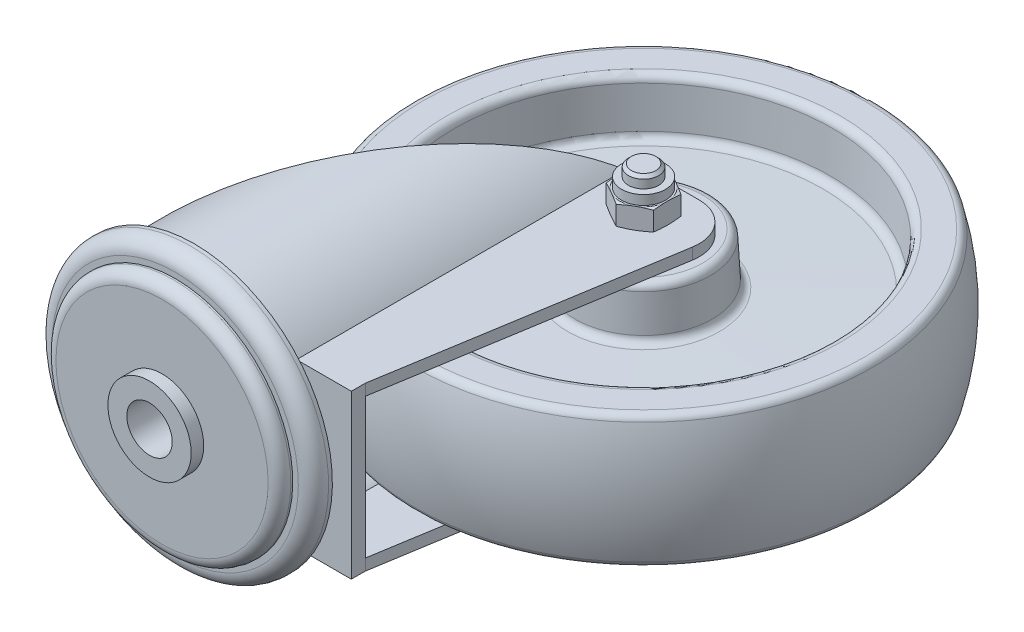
ISO-10303-21;
HEADER;
FILE_DESCRIPTION(('STEP AP214'),'2;1');
FILE_NAME('part.step','',(''),(''),'','','');
FILE_SCHEMA(('AUTOMOTIVE_DESIGN { 1 0 10303 214 1 1 1 1 }'));
ENDSEC;
DATA;
#1=APPLICATION_CONTEXT('core data for automotive mechanical design processes');
#2=APPLICATION_PROTOCOL_DEFINITION('international standard','automotive_design',2000,#1);
#3=PRODUCT_CONTEXT('',#1,'mechanical');
#4=PRODUCT('Part','Part','',(#3));
#5=PRODUCT_RELATED_PRODUCT_CATEGORY('part','',(#4));
#6=PRODUCT_DEFINITION_FORMATION('','',#4);
#7=PRODUCT_DEFINITION_CONTEXT('part definition',#1,'design');
#8=PRODUCT_DEFINITION('design','',#6,#7);
#9=PRODUCT_DEFINITION_SHAPE('','',#8);
#10=(LENGTH_UNIT() NAMED_UNIT(*) SI_UNIT(.MILLI.,.METRE.));
#11=(NAMED_UNIT(*) PLANE_ANGLE_UNIT() SI_UNIT($,.RADIAN.));
#12=(NAMED_UNIT(*) SI_UNIT($,.STERADIAN.) SOLID_ANGLE_UNIT());
#13=UNCERTAINTY_MEASURE_WITH_UNIT(LENGTH_MEASURE(1.E-05),#10,'distance_accuracy_value','');
#14=(GEOMETRIC_REPRESENTATION_CONTEXT(3) GLOBAL_UNCERTAINTY_ASSIGNED_CONTEXT((#13)) GLOBAL_UNIT_ASSIGNED_CONTEXT((#10,
#11,#12)) REPRESENTATION_CONTEXT('',''));
#15=CARTESIAN_POINT('',(0.,0.,0.));
#16=DIRECTION('',(0.,0.,1.));
#17=DIRECTION('',(1.,0.,0.));
#18=AXIS2_PLACEMENT_3D('',#15,#16,#17);
#19=CARTESIAN_POINT('',(21.39792913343,-17.5,-93.5));
#20=DIRECTION('',(0.,-1.,0.));
#21=DIRECTION('',(1.,0.,0.));
#22=AXIS2_PLACEMENT_3D('',#19,#20,#21);
#23=PLANE('',#22);
#24=CARTESIAN_POINT('',(37.,-17.5,-93.5));
#25=DIRECTION('',(0.,1.,0.));
#26=DIRECTION('',(-1.,0.,0.));
#27=AXIS2_PLACEMENT_3D('',#24,#25,#26);
#28=CIRCLE('',#27,7.5);
#29=CARTESIAN_POINT('',(29.5,-17.5,-93.5));
#30=VERTEX_POINT('',#29);
#31=EDGE_CURVE('E9',#30,#30,#28,.T.);
#32=ORIENTED_EDGE('',*,*,#31,.T.);
#33=EDGE_LOOP('',(#32));
#34=FACE_BOUND('',#33,.T.);
#35=CARTESIAN_POINT('',(37.,-17.5,-93.5));
#36=DIRECTION('',(0.,1.,0.));
#37=DIRECTION('',(-1.,0.,0.));
#38=AXIS2_PLACEMENT_3D('',#35,#36,#37);
#39=CIRCLE('',#38,15.60207086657);
#40=CARTESIAN_POINT('',(21.39792913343,-17.5,-93.5));
#41=VERTEX_POINT('',#40);
#42=EDGE_CURVE('E901',#41,#41,#39,.T.);
#43=ORIENTED_EDGE('',*,*,#42,.F.);
#44=EDGE_LOOP('',(#43));
#45=FACE_BOUND('',#44,.T.);
#46=ADVANCED_FACE('F15',(#34,#45),#23,.T.);
#47=CARTESIAN_POINT('',(29.5,17.5,-93.5));
#48=DIRECTION('',(0.,1.,0.));
#49=DIRECTION('',(-1.,0.,0.));
#50=AXIS2_PLACEMENT_3D('',#47,#48,#49);
#51=PLANE('',#50);
#52=CARTESIAN_POINT('',(37.,17.5,-93.5));
#53=DIRECTION('',(0.,1.,0.));
#54=DIRECTION('',(-1.,0.,0.));
#55=AXIS2_PLACEMENT_3D('',#52,#53,#54);
#56=CIRCLE('',#55,15.60207086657);
#57=CARTESIAN_POINT('',(21.39792913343,17.5,-93.5));
#58=VERTEX_POINT('',#57);
#59=EDGE_CURVE('E856',#58,#58,#56,.T.);
#60=ORIENTED_EDGE('',*,*,#59,.T.);
#61=EDGE_LOOP('',(#60));
#62=FACE_BOUND('',#61,.T.);
#63=CARTESIAN_POINT('',(37.,17.5,-93.5));
#64=DIRECTION('',(0.,1.,0.));
#65=DIRECTION('',(-1.,0.,0.));
#66=AXIS2_PLACEMENT_3D('',#63,#64,#65);
#67=CIRCLE('',#66,7.5);
#68=CARTESIAN_POINT('',(29.5,17.5,-93.5));
#69=VERTEX_POINT('',#68);
#70=EDGE_CURVE('E25',#69,#69,#67,.T.);
#71=ORIENTED_EDGE('',*,*,#70,.F.);
#72=EDGE_LOOP('',(#71));
#73=FACE_BOUND('',#72,.T.);
#74=ADVANCED_FACE('F1453',(#62,#73),#51,.T.);
#75=CARTESIAN_POINT('',(37.,15.500000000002,-93.5));
#76=DIRECTION('',(0.,1.,0.));
#77=DIRECTION('',(-1.,0.,0.));
#78=AXIS2_PLACEMENT_3D('',#75,#76,#77);
#79=TOROIDAL_SURFACE('',#78,15.6020708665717,1.99999999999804);
#80=CARTESIAN_POINT('',(37.,15.604671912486,-93.5));
#81=DIRECTION('',(0.,1.,0.));
#82=DIRECTION('',(-1.,0.,0.));
#83=AXIS2_PLACEMENT_3D('',#80,#81,#82);
#84=CIRCLE('',#83,17.599329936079);
#85=CARTESIAN_POINT('',(19.400670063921,15.604671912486,-93.5));
#86=VERTEX_POINT('',#85);
#87=EDGE_CURVE('E859',#86,#86,#84,.T.);
#88=ORIENTED_EDGE('',*,*,#87,.T.);
#89=EDGE_LOOP('',(#88));
#90=FACE_BOUND('',#89,.T.);
#91=ORIENTED_EDGE('',*,*,#59,.F.);
#92=EDGE_LOOP('',(#91));
#93=FACE_BOUND('',#92,.T.);
#94=ADVANCED_FACE('F1442',(#90,#93),#79,.T.);
#95=CARTESIAN_POINT('',(37.,15.604671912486,-93.5));
#96=DIRECTION('',(0.,-1.,0.));
#97=DIRECTION('',(1.,0.,0.));
#98=AXIS2_PLACEMENT_3D('',#95,#96,#97);
#99=CONICAL_SURFACE('',#98,17.599329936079,0.0523598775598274);
#100=CARTESIAN_POINT('',(37.,5.9445400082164,-93.5));
#101=DIRECTION('',(0.,1.,0.));
#102=DIRECTION('',(-1.,0.,0.));
#103=AXIS2_PLACEMENT_3D('',#100,#101,#102);
#104=CIRCLE('',#103,18.105595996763);
#105=CARTESIAN_POINT('',(18.894404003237,5.9445400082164,-93.5));
#106=VERTEX_POINT('',#105);
#107=EDGE_CURVE('E862',#106,#106,#104,.T.);
#108=ORIENTED_EDGE('',*,*,#107,.T.);
#109=EDGE_LOOP('',(#108));
#110=FACE_BOUND('',#109,.T.);
#111=ORIENTED_EDGE('',*,*,#87,.F.);
#112=EDGE_LOOP('',(#111));
#113=FACE_BOUND('',#112,.T.);
#114=ADVANCED_FACE('F1431',(#110,#113),#99,.T.);
#115=CARTESIAN_POINT('',(37.,6.04921192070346,-93.5));
#116=DIRECTION('',(0.,1.,0.));
#117=DIRECTION('',(-1.,0.,0.));
#118=AXIS2_PLACEMENT_3D('',#115,#116,#117);
#119=TOROIDAL_SURFACE('',#118,20.1028550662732,2.00000000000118);
#120=CARTESIAN_POINT('',(37.,4.0504302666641,-93.5));
#121=DIRECTION('',(0.,1.,0.));
#122=DIRECTION('',(-1.,0.,0.));
#123=AXIS2_PLACEMENT_3D('',#120,#121,#122);
#124=CIRCLE('',#123,20.033056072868);
#125=CARTESIAN_POINT('',(16.966943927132,4.0504302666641,-93.5));
#126=VERTEX_POINT('',#125);
#127=EDGE_CURVE('E865',#126,#126,#124,.T.);
#128=ORIENTED_EDGE('',*,*,#127,.T.);
#129=EDGE_LOOP('',(#128));
#130=FACE_BOUND('',#129,.T.);
#131=ORIENTED_EDGE('',*,*,#107,.F.);
#132=EDGE_LOOP('',(#131));
#133=FACE_BOUND('',#132,.T.);
#134=ADVANCED_FACE('F1420',(#130,#133),#119,.F.);
#135=CARTESIAN_POINT('',(37.,4.0504302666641,-93.5));
#136=DIRECTION('',(0.,-1.,0.));
#137=DIRECTION('',(1.,0.,0.));
#138=AXIS2_PLACEMENT_3D('',#135,#136,#137);
#139=CONICAL_SURFACE('',#138,20.033056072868,1.53588974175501);
#140=CARTESIAN_POINT('',(37.,3.0990338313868,-93.5));
#141=DIRECTION('',(0.,1.,0.));
#142=DIRECTION('',(-1.,0.,0.));
#143=AXIS2_PLACEMENT_3D('',#140,#141,#142);
#144=CIRCLE('',#143,47.277485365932);
#145=CARTESIAN_POINT('',(-10.277485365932,3.0990338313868,-93.5));
#146=VERTEX_POINT('',#145);
#147=EDGE_CURVE('E868',#146,#146,#144,.T.);
#148=ORIENTED_EDGE('',*,*,#147,.T.);
#149=EDGE_LOOP('',(#148));
#150=FACE_BOUND('',#149,.T.);
#151=ORIENTED_EDGE('',*,*,#127,.F.);
#152=EDGE_LOOP('',(#151));
#153=FACE_BOUND('',#152,.T.);
#154=ADVANCED_FACE('F1409',(#150,#153),#139,.T.);
#155=CARTESIAN_POINT('',(37.,5.0978154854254,-93.5));
#156=DIRECTION('',(0.,1.,0.));
#157=DIRECTION('',(-1.,0.,0.));
#158=AXIS2_PLACEMENT_3D('',#155,#156,#157);
#159=TOROIDAL_SURFACE('',#158,47.3472843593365,2.00000000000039);
#160=CARTESIAN_POINT('',(37.,4.9931435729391,-93.5));
#161=DIRECTION('',(0.,1.,0.));
#162=DIRECTION('',(-1.,0.,0.));
#163=AXIS2_PLACEMENT_3D('',#160,#161,#162);
#164=CIRCLE('',#163,49.344543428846);
#165=CARTESIAN_POINT('',(-12.344543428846,4.9931435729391,-93.5));
#166=VERTEX_POINT('',#165);
#167=EDGE_CURVE('E871',#166,#166,#164,.T.);
#168=ORIENTED_EDGE('',*,*,#167,.T.);
#169=EDGE_LOOP('',(#168));
#170=FACE_BOUND('',#169,.T.);
#171=ORIENTED_EDGE('',*,*,#147,.F.);
#172=EDGE_LOOP('',(#171));
#173=FACE_BOUND('',#172,.T.);
#174=ADVANCED_FACE('F1398',(#170,#173),#159,.F.);
#175=CARTESIAN_POINT('',(37.,4.9931435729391,-93.5));
#176=DIRECTION('',(0.,1.,0.));
#177=DIRECTION('',(-1.,0.,0.));
#178=AXIS2_PLACEMENT_3D('',#175,#176,#177);
#179=CONICAL_SURFACE('',#178,49.344543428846,0.0523598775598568);
#180=CARTESIAN_POINT('',(37.,15.604671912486,-93.5));
#181=DIRECTION('',(0.,1.,0.));
#182=DIRECTION('',(-1.,0.,0.));
#183=AXIS2_PLACEMENT_3D('',#180,#181,#182);
#184=CIRCLE('',#183,49.900670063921);
#185=CARTESIAN_POINT('',(-12.900670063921,15.604671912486,-93.5));
#186=VERTEX_POINT('',#185);
#187=EDGE_CURVE('E874',#186,#186,#184,.T.);
#188=ORIENTED_EDGE('',*,*,#187,.T.);
#189=EDGE_LOOP('',(#188));
#190=FACE_BOUND('',#189,.T.);
#191=ORIENTED_EDGE('',*,*,#167,.F.);
#192=EDGE_LOOP('',(#191));
#193=FACE_BOUND('',#192,.T.);
#194=ADVANCED_FACE('F1387',(#190,#193),#179,.F.);
#195=CARTESIAN_POINT('',(37.,15.500000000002,-93.5));
#196=DIRECTION('',(0.,1.,0.));
#197=DIRECTION('',(-1.,0.,0.));
#198=AXIS2_PLACEMENT_3D('',#195,#196,#197);
#199=TOROIDAL_SURFACE('',#198,51.8979291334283,1.99999999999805);
#200=CARTESIAN_POINT('',(37.,17.5,-93.5));
#201=DIRECTION('',(0.,1.,0.));
#202=DIRECTION('',(-1.,0.,0.));
#203=AXIS2_PLACEMENT_3D('',#200,#201,#202);
#204=CIRCLE('',#203,51.89792913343);
#205=CARTESIAN_POINT('',(-14.89792913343,17.5,-93.5));
#206=VERTEX_POINT('',#205);
#207=EDGE_CURVE('E877',#206,#206,#204,.T.);
#208=ORIENTED_EDGE('',*,*,#207,.T.);
#209=EDGE_LOOP('',(#208));
#210=FACE_BOUND('',#209,.T.);
#211=ORIENTED_EDGE('',*,*,#187,.F.);
#212=EDGE_LOOP('',(#211));
#213=FACE_BOUND('',#212,.T.);
#214=ADVANCED_FACE('F1376',(#210,#213),#199,.T.);
#215=CARTESIAN_POINT('',(-14.89792913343,17.5,-93.5));
#216=DIRECTION('',(0.,1.,0.));
#217=DIRECTION('',(-1.,0.,0.));
#218=AXIS2_PLACEMENT_3D('',#215,#216,#217);
#219=PLANE('',#218);
#220=CARTESIAN_POINT('',(37.,17.5,-93.5));
#221=DIRECTION('',(0.,1.,0.));
#222=DIRECTION('',(-1.,0.,0.));
#223=AXIS2_PLACEMENT_3D('',#220,#221,#222);
#224=CIRCLE('',#223,58.480766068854);
#225=CARTESIAN_POINT('',(-21.480766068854,17.5,-93.5));
#226=VERTEX_POINT('',#225);
#227=EDGE_CURVE('E904',#226,#226,#224,.T.);
#228=ORIENTED_EDGE('',*,*,#227,.T.);
#229=EDGE_LOOP('',(#228));
#230=FACE_BOUND('',#229,.T.);
#231=ORIENTED_EDGE('',*,*,#207,.F.);
#232=EDGE_LOOP('',(#231));
#233=FACE_BOUND('',#232,.T.);
#234=ADVANCED_FACE('F1365',(#230,#233),#219,.T.);
#235=CARTESIAN_POINT('',(-19.5,-17.5,-93.5));
#236=DIRECTION('',(0.,-1.,0.));
#237=DIRECTION('',(1.,0.,0.));
#238=AXIS2_PLACEMENT_3D('',#235,#236,#237);
#239=PLANE('',#238);
#240=CARTESIAN_POINT('',(37.,-17.5,-93.5));
#241=DIRECTION('',(0.,1.,0.));
#242=DIRECTION('',(-1.,0.,0.));
#243=AXIS2_PLACEMENT_3D('',#240,#241,#242);
#244=CIRCLE('',#243,51.89792913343);
#245=CARTESIAN_POINT('',(-14.89792913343,-17.5,-93.5));
#246=VERTEX_POINT('',#245);
#247=EDGE_CURVE('E880',#246,#246,#244,.T.);
#248=ORIENTED_EDGE('',*,*,#247,.T.);
#249=EDGE_LOOP('',(#248));
#250=FACE_BOUND('',#249,.T.);
#251=CARTESIAN_POINT('',(37.,-17.5,-93.5));
#252=DIRECTION('',(0.,1.,0.));
#253=DIRECTION('',(-1.,0.,0.));
#254=AXIS2_PLACEMENT_3D('',#251,#252,#253);
#255=CIRCLE('',#254,58.480766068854);
#256=CARTESIAN_POINT('',(-21.480766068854,-17.5,-93.5));
#257=VERTEX_POINT('',#256);
#258=EDGE_CURVE('E913',#257,#257,#255,.T.);
#259=ORIENTED_EDGE('',*,*,#258,.F.);
#260=EDGE_LOOP('',(#259));
#261=FACE_BOUND('',#260,.T.);
#262=ADVANCED_FACE('F1354',(#250,#261),#239,.T.);
#263=CARTESIAN_POINT('',(37.,-15.500000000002,-93.5));
#264=DIRECTION('',(0.,1.,0.));
#265=DIRECTION('',(-1.,0.,0.));
#266=AXIS2_PLACEMENT_3D('',#263,#264,#265);
#267=TOROIDAL_SURFACE('',#266,51.8979291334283,1.99999999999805);
#268=CARTESIAN_POINT('',(37.,-15.604671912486,-93.5));
#269=DIRECTION('',(0.,1.,0.));
#270=DIRECTION('',(-1.,0.,0.));
#271=AXIS2_PLACEMENT_3D('',#268,#269,#270);
#272=CIRCLE('',#271,49.900670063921);
#273=CARTESIAN_POINT('',(-12.900670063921,-15.604671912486,-93.5));
#274=VERTEX_POINT('',#273);
#275=EDGE_CURVE('E883',#274,#274,#272,.T.);
#276=ORIENTED_EDGE('',*,*,#275,.T.);
#277=EDGE_LOOP('',(#276));
#278=FACE_BOUND('',#277,.T.);
#279=ORIENTED_EDGE('',*,*,#247,.F.);
#280=EDGE_LOOP('',(#279));
#281=FACE_BOUND('',#280,.T.);
#282=ADVANCED_FACE('F1343',(#278,#281),#267,.T.);
#283=CARTESIAN_POINT('',(37.,-15.604671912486,-93.5));
#284=DIRECTION('',(0.,-1.,0.));
#285=DIRECTION('',(1.,0.,0.));
#286=AXIS2_PLACEMENT_3D('',#283,#284,#285);
#287=CONICAL_SURFACE('',#286,49.900670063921,0.0523598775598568);
#288=CARTESIAN_POINT('',(37.,-4.9931435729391,-93.5));
#289=DIRECTION('',(0.,1.,0.));
#290=DIRECTION('',(-1.,0.,0.));
#291=AXIS2_PLACEMENT_3D('',#288,#289,#290);
#292=CIRCLE('',#291,49.344543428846);
#293=CARTESIAN_POINT('',(-12.344543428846,-4.9931435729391,-93.5));
#294=VERTEX_POINT('',#293);
#295=EDGE_CURVE('E886',#294,#294,#292,.T.);
#296=ORIENTED_EDGE('',*,*,#295,.T.);
#297=EDGE_LOOP('',(#296));
#298=FACE_BOUND('',#297,.T.);
#299=ORIENTED_EDGE('',*,*,#275,.F.);
#300=EDGE_LOOP('',(#299));
#301=FACE_BOUND('',#300,.T.);
#302=ADVANCED_FACE('F1332',(#298,#301),#287,.F.);
#303=CARTESIAN_POINT('',(37.,-5.0978154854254,-93.5));
#304=DIRECTION('',(0.,1.,0.));
#305=DIRECTION('',(-1.,0.,0.));
#306=AXIS2_PLACEMENT_3D('',#303,#304,#305);
#307=TOROIDAL_SURFACE('',#306,47.3472843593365,2.00000000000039);
#308=CARTESIAN_POINT('',(37.,-3.09903383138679,-93.5));
#309=DIRECTION('',(0.,1.,0.));
#310=DIRECTION('',(-1.,0.,0.));
#311=AXIS2_PLACEMENT_3D('',#308,#309,#310);
#312=CIRCLE('',#311,47.277485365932);
#313=CARTESIAN_POINT('',(-10.277485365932,-3.09903383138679,-93.5));
#314=VERTEX_POINT('',#313);
#315=EDGE_CURVE('E889',#314,#314,#312,.T.);
#316=ORIENTED_EDGE('',*,*,#315,.T.);
#317=EDGE_LOOP('',(#316));
#318=FACE_BOUND('',#317,.T.);
#319=ORIENTED_EDGE('',*,*,#295,.F.);
#320=EDGE_LOOP('',(#319));
#321=FACE_BOUND('',#320,.T.);
#322=ADVANCED_FACE('F1321',(#318,#321),#307,.F.);
#323=CARTESIAN_POINT('',(37.,-3.09903383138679,-93.5));
#324=DIRECTION('',(0.,1.,0.));
#325=DIRECTION('',(-1.,0.,0.));
#326=AXIS2_PLACEMENT_3D('',#323,#324,#325);
#327=CONICAL_SURFACE('',#326,47.277485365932,1.53588974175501);
#328=CARTESIAN_POINT('',(37.,-4.0504302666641,-93.5));
#329=DIRECTION('',(0.,1.,0.));
#330=DIRECTION('',(-1.,0.,0.));
#331=AXIS2_PLACEMENT_3D('',#328,#329,#330);
#332=CIRCLE('',#331,20.033056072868);
#333=CARTESIAN_POINT('',(16.966943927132,-4.0504302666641,-93.5));
#334=VERTEX_POINT('',#333);
#335=EDGE_CURVE('E892',#334,#334,#332,.T.);
#336=ORIENTED_EDGE('',*,*,#335,.T.);
#337=EDGE_LOOP('',(#336));
#338=FACE_BOUND('',#337,.T.);
#339=ORIENTED_EDGE('',*,*,#315,.F.);
#340=EDGE_LOOP('',(#339));
#341=FACE_BOUND('',#340,.T.);
#342=ADVANCED_FACE('F1310',(#338,#341),#327,.T.);
#343=CARTESIAN_POINT('',(37.,-6.04921192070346,-93.5));
#344=DIRECTION('',(0.,1.,0.));
#345=DIRECTION('',(-1.,0.,0.));
#346=AXIS2_PLACEMENT_3D('',#343,#344,#345);
#347=TOROIDAL_SURFACE('',#346,20.1028550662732,2.00000000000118);
#348=CARTESIAN_POINT('',(37.,-5.9445400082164,-93.5));
#349=DIRECTION('',(0.,1.,0.));
#350=DIRECTION('',(-1.,0.,0.));
#351=AXIS2_PLACEMENT_3D('',#348,#349,#350);
#352=CIRCLE('',#351,18.105595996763);
#353=CARTESIAN_POINT('',(18.894404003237,-5.9445400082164,-93.5));
#354=VERTEX_POINT('',#353);
#355=EDGE_CURVE('E895',#354,#354,#352,.T.);
#356=ORIENTED_EDGE('',*,*,#355,.T.);
#357=EDGE_LOOP('',(#356));
#358=FACE_BOUND('',#357,.T.);
#359=ORIENTED_EDGE('',*,*,#335,.F.);
#360=EDGE_LOOP('',(#359));
#361=FACE_BOUND('',#360,.T.);
#362=ADVANCED_FACE('F1299',(#358,#361),#347,.F.);
#363=CARTESIAN_POINT('',(37.,-5.9445400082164,-93.5));
#364=DIRECTION('',(0.,1.,0.));
#365=DIRECTION('',(-1.,0.,0.));
#366=AXIS2_PLACEMENT_3D('',#363,#364,#365);
#367=CONICAL_SURFACE('',#366,18.105595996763,0.0523598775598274);
#368=CARTESIAN_POINT('',(37.,-15.604671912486,-93.5));
#369=DIRECTION('',(0.,1.,0.));
#370=DIRECTION('',(-1.,0.,0.));
#371=AXIS2_PLACEMENT_3D('',#368,#369,#370);
#372=CIRCLE('',#371,17.599329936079);
#373=CARTESIAN_POINT('',(19.400670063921,-15.604671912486,-93.5));
#374=VERTEX_POINT('',#373);
#375=EDGE_CURVE('E898',#374,#374,#372,.T.);
#376=ORIENTED_EDGE('',*,*,#375,.T.);
#377=EDGE_LOOP('',(#376));
#378=FACE_BOUND('',#377,.T.);
#379=ORIENTED_EDGE('',*,*,#355,.F.);
#380=EDGE_LOOP('',(#379));
#381=FACE_BOUND('',#380,.T.);
#382=ADVANCED_FACE('F1287',(#378,#381),#367,.T.);
#383=CARTESIAN_POINT('',(37.,-15.500000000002,-93.5));
#384=DIRECTION('',(0.,1.,0.));
#385=DIRECTION('',(-1.,0.,0.));
#386=AXIS2_PLACEMENT_3D('',#383,#384,#385);
#387=TOROIDAL_SURFACE('',#386,15.6020708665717,1.99999999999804);
#388=ORIENTED_EDGE('',*,*,#42,.T.);
#389=EDGE_LOOP('',(#388));
#390=FACE_BOUND('',#389,.T.);
#391=ORIENTED_EDGE('',*,*,#375,.F.);
#392=EDGE_LOOP('',(#391));
#393=FACE_BOUND('',#392,.T.);
#394=ADVANCED_FACE('F1275',(#390,#393),#387,.T.);
#395=CARTESIAN_POINT('',(37.,15.5,-93.5));
#396=DIRECTION('',(0.,1.,0.));
#397=DIRECTION('',(-1.,0.,0.));
#398=AXIS2_PLACEMENT_3D('',#395,#396,#397);
#399=TOROIDAL_SURFACE('',#398,58.4807660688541,1.99999999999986);
#400=CARTESIAN_POINT('',(37.,16.012396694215,-93.5));
#401=DIRECTION('',(0.,1.,0.));
#402=DIRECTION('',(-1.,0.,0.));
#403=AXIS2_PLACEMENT_3D('',#400,#401,#402);
#404=CIRCLE('',#403,60.41401453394);
#405=CARTESIAN_POINT('',(-23.41401453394,16.012396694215,-93.5));
#406=VERTEX_POINT('',#405);
#407=EDGE_CURVE('E907',#406,#406,#404,.T.);
#408=ORIENTED_EDGE('',*,*,#407,.T.);
#409=EDGE_LOOP('',(#408));
#410=FACE_BOUND('',#409,.T.);
#411=ORIENTED_EDGE('',*,*,#227,.F.);
#412=EDGE_LOOP('',(#411));
#413=FACE_BOUND('',#412,.T.);
#414=ADVANCED_FACE('F1264',(#410,#413),#399,.T.);
#415=CARTESIAN_POINT('',(37.000000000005,0.,-93.5));
#416=DIRECTION('',(0.,1.,0.));
#417=DIRECTION('',(-1.,0.,0.));
#418=AXIS2_PLACEMENT_3D('',#415,#416,#417);
#419=SPHERICAL_SURFACE('',#418,62.500000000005);
#420=CARTESIAN_POINT('',(37.,-16.0123966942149,-93.5));
#421=DIRECTION('',(0.,1.,0.));
#422=DIRECTION('',(-1.,0.,0.));
#423=AXIS2_PLACEMENT_3D('',#420,#421,#422);
#424=CIRCLE('',#423,60.41401453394);
#425=CARTESIAN_POINT('',(-23.41401453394,-16.0123966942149,-93.5));
#426=VERTEX_POINT('',#425);
#427=EDGE_CURVE('E910',#426,#426,#424,.T.);
#428=CARTESIAN_POINT('',(-23.41401453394,-16.0123966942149,-93.5));
#429=CARTESIAN_POINT('',(-23.5004441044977,-15.6863030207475,-93.5));
#430=CARTESIAN_POINT('',(-23.5842329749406,-15.3595094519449,-93.5));
#431=CARTESIAN_POINT('',(-23.7465084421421,-14.704608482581,-93.5));
#432=CARTESIAN_POINT('',(-23.8249950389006,-14.3765010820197,-93.5));
#433=CARTESIAN_POINT('',(-23.9766450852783,-13.7190584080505,-93.5));
#434=CARTESIAN_POINT('',(-24.0498085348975,-13.3897231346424,-93.5));
#435=CARTESIAN_POINT('',(-24.190793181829,-12.729911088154,-93.5));
#436=CARTESIAN_POINT('',(-24.2586143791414,-12.3994343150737,-93.5));
#437=CARTESIAN_POINT('',(-24.3888967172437,-11.7374259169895,-93.5));
#438=CARTESIAN_POINT('',(-24.4513578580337,-11.4058942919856,-93.5));
#439=CARTESIAN_POINT('',(-24.5709037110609,-10.741863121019,-93.5));
#440=CARTESIAN_POINT('',(-24.6279884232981,-10.4093635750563,-93.5));
#441=CARTESIAN_POINT('',(-24.7367664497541,-9.74348374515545,-93.5));
#442=CARTESIAN_POINT('',(-24.7884597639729,-9.41010346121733,-93.5));
#443=CARTESIAN_POINT('',(-24.8864414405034,-8.74254956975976,-93.5));
#444=CARTESIAN_POINT('',(-24.9327298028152,-8.4083759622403,-93.5));
#445=CARTESIAN_POINT('',(-25.0198894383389,-7.73932304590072,-93.5));
#446=CARTESIAN_POINT('',(-25.0607607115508,-7.40444373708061,-93.5));
#447=CARTESIAN_POINT('',(-25.1370754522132,-6.73406722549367,-93.5));
#448=CARTESIAN_POINT('',(-25.1725189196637,-6.39857002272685,-93.5));
#449=CARTESIAN_POINT('',(-25.2379687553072,-5.72704569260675,-93.5));
#450=CARTESIAN_POINT('',(-25.2679751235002,-5.39101856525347,-93.5));
#451=CARTESIAN_POINT('',(-25.3225428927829,-4.71852249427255,-93.5));
#452=CARTESIAN_POINT('',(-25.3471042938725,-4.3820535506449,-93.5));
#453=CARTESIAN_POINT('',(-25.3907756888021,-3.70876207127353,-93.5));
#454=CARTESIAN_POINT('',(-25.4098856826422,-3.37193953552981,-93.5));
#455=CARTESIAN_POINT('',(-25.4426492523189,-2.6980291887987,-93.5));
#456=CARTESIAN_POINT('',(-25.4563028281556,-2.36094137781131,-93.5));
#457=CARTESIAN_POINT('',(-25.4781499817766,-1.68658886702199,-93.5));
#458=CARTESIAN_POINT('',(-25.486343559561,-1.34932416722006,-93.5));
#459=CARTESIAN_POINT('',(-25.4972685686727,-0.674706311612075,-93.5));
#460=CARTESIAN_POINT('',(-25.5,-0.337353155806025,-93.5));
#461=CARTESIAN_POINT('',(-25.5,0.337353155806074,-93.5));
#462=CARTESIAN_POINT('',(-25.4972685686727,0.674706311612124,-93.5));
#463=CARTESIAN_POINT('',(-25.486343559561,1.34932416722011,-93.5));
#464=CARTESIAN_POINT('',(-25.4781499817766,1.68658886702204,-93.5));
#465=CARTESIAN_POINT('',(-25.4563028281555,2.36094137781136,-93.5));
#466=CARTESIAN_POINT('',(-25.4426492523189,2.69802918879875,-93.5));
#467=CARTESIAN_POINT('',(-25.4098856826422,3.37193953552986,-93.5));
#468=CARTESIAN_POINT('',(-25.3907756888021,3.70876207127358,-93.5));
#469=CARTESIAN_POINT('',(-25.3471042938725,4.38205355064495,-93.5));
#470=CARTESIAN_POINT('',(-25.3225428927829,4.7185224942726,-93.5));
#471=CARTESIAN_POINT('',(-25.2679751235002,5.39101856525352,-93.5));
#472=CARTESIAN_POINT('',(-25.2379687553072,5.72704569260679,-93.5));
#473=CARTESIAN_POINT('',(-25.1725189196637,6.39857002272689,-93.5));
#474=CARTESIAN_POINT('',(-25.1370754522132,6.73406722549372,-93.5));
#475=CARTESIAN_POINT('',(-25.0607607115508,7.40444373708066,-93.5));
#476=CARTESIAN_POINT('',(-25.0198894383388,7.73932304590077,-93.5));
#477=CARTESIAN_POINT('',(-24.9327298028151,8.40837596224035,-93.5));
#478=CARTESIAN_POINT('',(-24.8864414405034,8.74254956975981,-93.5));
#479=CARTESIAN_POINT('',(-24.7884597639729,9.41010346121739,-93.5));
#480=CARTESIAN_POINT('',(-24.7367664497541,9.7434837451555,-93.5));
#481=CARTESIAN_POINT('',(-24.6279884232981,10.4093635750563,-93.5));
#482=CARTESIAN_POINT('',(-24.5709037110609,10.7418631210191,-93.5));
#483=CARTESIAN_POINT('',(-24.4513578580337,11.4058942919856,-93.5));
#484=CARTESIAN_POINT('',(-24.3888967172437,11.7374259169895,-93.5));
#485=CARTESIAN_POINT('',(-24.2586143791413,12.3994343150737,-93.5));
#486=CARTESIAN_POINT('',(-24.190793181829,12.7299110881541,-93.5));
#487=CARTESIAN_POINT('',(-24.0498085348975,13.3897231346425,-93.5));
#488=CARTESIAN_POINT('',(-23.9766450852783,13.7190584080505,-93.5));
#489=CARTESIAN_POINT('',(-23.8249950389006,14.3765010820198,-93.5));
#490=CARTESIAN_POINT('',(-23.7465084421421,14.704608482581,-93.5));
#491=CARTESIAN_POINT('',(-23.5842329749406,15.3595094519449,-93.5));
#492=CARTESIAN_POINT('',(-23.5004441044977,15.6863030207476,-93.5));
#493=CARTESIAN_POINT('',(-23.41401453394,16.012396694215,-93.5));
#494=B_SPLINE_CURVE_WITH_KNOTS('',3,(#428,#429,#430,#431,#432,#433,#434,#435,#436,#437,#438,
#439,#440,#441,#442,#443,#444,#445,#446,#447,#448,#449,#450,#451,#452,#453,#454,#455,#456,#457,
#458,#459,#460,#461,#462,#463,#464,#465,#466,#467,#468,#469,#470,#471,#472,#473,#474,#475,#476,
#477,#478,#479,#480,#481,#482,#483,#484,#485,#486,#487,#488,#489,#490,#491,#492,#493),
.UNSPECIFIED.,.F.,.F.,(4,2,2,2,2,2,2,2,2,2,2,2,2,2,2,2,2,2,2,2,2,2,2,2,2,2,2,2,2,2,2,2,4),(0.,
1.01204841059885,2.02409682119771,3.03614523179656,4.04819364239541,5.06024205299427,
6.07229046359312,7.08433887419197,8.09638728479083,9.10843569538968,10.1204841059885,
11.1325325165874,12.1445809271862,13.1566293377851,14.1686777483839,15.1807261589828,
16.1927745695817,17.2048229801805,18.2168713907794,19.2289198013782,20.2409682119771,
21.2530166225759,22.2650650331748,23.2771134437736,24.2891618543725,25.3012102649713,
26.3132586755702,27.325307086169,28.3373554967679,29.3494039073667,30.3614523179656,
31.3735007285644,32.3855491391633),.UNSPECIFIED.);
#495=EDGE_CURVE('BSEAM1252',#426,#406,#494,.T.);
#496=ORIENTED_EDGE('',*,*,#427,.T.);
#497=ORIENTED_EDGE('',*,*,#407,.F.);
#498=ORIENTED_EDGE('',*,*,#495,.T.);
#499=ORIENTED_EDGE('',*,*,#495,.F.);
#500=EDGE_LOOP('',(#496,#498,#497,#499));
#501=FACE_BOUND('',#500,.T.);
#502=ADVANCED_FACE('F1252',(#501),#419,.T.);
#503=CARTESIAN_POINT('',(37.,-15.5,-93.5));
#504=DIRECTION('',(0.,1.,0.));
#505=DIRECTION('',(-1.,0.,0.));
#506=AXIS2_PLACEMENT_3D('',#503,#504,#505);
#507=TOROIDAL_SURFACE('',#506,58.4807660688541,1.99999999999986);
#508=ORIENTED_EDGE('',*,*,#258,.T.);
#509=EDGE_LOOP('',(#508));
#510=FACE_BOUND('',#509,.T.);
#511=ORIENTED_EDGE('',*,*,#427,.F.);
#512=EDGE_LOOP('',(#511));
#513=FACE_BOUND('',#512,.T.);
#514=ADVANCED_FACE('F489',(#510,#513),#507,.T.);
#515=CARTESIAN_POINT('',(37.,32.5,-90.267));
#516=DIRECTION('',(0.,1.,0.));
#517=DIRECTION('',(-1.,0.,0.));
#518=AXIS2_PLACEMENT_3D('',#515,#516,#517);
#519=PLANE('',#518);
#520=CARTESIAN_POINT('',(37.,32.5,-93.5));
#521=DIRECTION('',(0.,-1.,0.));
#522=DIRECTION('',(1.,0.,0.));
#523=AXIS2_PLACEMENT_3D('',#520,#521,#522);
#524=CIRCLE('',#523,3.233);
#525=CARTESIAN_POINT('',(40.233,32.5,-93.5));
#526=VERTEX_POINT('',#525);
#527=EDGE_CURVE('E700',#526,#526,#524,.T.);
#528=ORIENTED_EDGE('',*,*,#527,.F.);
#529=EDGE_LOOP('',(#528));
#530=FACE_BOUND('',#529,.T.);
#531=ADVANCED_FACE('F475',(#530),#519,.T.);
#532=CARTESIAN_POINT('',(37.,31.733,-93.5));
#533=DIRECTION('',(0.,-1.,0.));
#534=DIRECTION('',(1.,0.,0.));
#535=AXIS2_PLACEMENT_3D('',#532,#533,#534);
#536=CONICAL_SURFACE('',#535,4.,0.78539816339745);
#537=ORIENTED_EDGE('',*,*,#527,.T.);
#538=EDGE_LOOP('',(#537));
#539=FACE_BOUND('',#538,.T.);
#540=CARTESIAN_POINT('',(37.,31.733,-93.5));
#541=DIRECTION('',(0.,-1.,0.));
#542=DIRECTION('',(1.,0.,0.));
#543=AXIS2_PLACEMENT_3D('',#540,#541,#542);
#544=CIRCLE('',#543,4.);
#545=CARTESIAN_POINT('',(41.,31.733,-93.5));
#546=VERTEX_POINT('',#545);
#547=EDGE_CURVE('E698',#546,#546,#544,.T.);
#548=ORIENTED_EDGE('',*,*,#547,.F.);
#549=EDGE_LOOP('',(#548));
#550=FACE_BOUND('',#549,.T.);
#551=ADVANCED_FACE('F513',(#539,#550),#536,.T.);
#552=CARTESIAN_POINT('',(37.,32.5,-93.5));
#553=DIRECTION('',(0.,-1.,0.));
#554=DIRECTION('',(1.,0.,0.));
#555=AXIS2_PLACEMENT_3D('',#552,#553,#554);
#556=CYLINDRICAL_SURFACE('',#555,4.);
#557=ORIENTED_EDGE('',*,*,#547,.T.);
#558=EDGE_LOOP('',(#557));
#559=FACE_BOUND('',#558,.T.);
#560=CARTESIAN_POINT('',(37.,29.5,-93.5));
#561=DIRECTION('',(0.,-1.,0.));
#562=DIRECTION('',(1.,0.,0.));
#563=AXIS2_PLACEMENT_3D('',#560,#561,#562);
#564=CIRCLE('',#563,4.);
#565=CARTESIAN_POINT('',(41.,29.5,-93.5));
#566=VERTEX_POINT('',#565);
#567=EDGE_CURVE('E760',#566,#566,#564,.T.);
#568=ORIENTED_EDGE('',*,*,#567,.F.);
#569=EDGE_LOOP('',(#568));
#570=FACE_BOUND('',#569,.T.);
#571=ADVANCED_FACE('F504',(#559,#570),#556,.T.);
#572=CARTESIAN_POINT('',(37.,-26.8,-93.5));
#573=DIRECTION('',(0.,-1.,0.));
#574=DIRECTION('',(1.,0.,0.));
#575=AXIS2_PLACEMENT_3D('',#572,#573,#574);
#576=PLANE('',#575);
#577=CARTESIAN_POINT('',(37.,-26.8,-93.5));
#578=DIRECTION('',(0.,-1.,0.));
#579=DIRECTION('',(1.,0.,0.));
#580=AXIS2_PLACEMENT_3D('',#577,#578,#579);
#581=CIRCLE('',#580,6.2583333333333);
#582=CARTESIAN_POINT('',(43.2583333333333,-26.8,-93.5));
#583=VERTEX_POINT('',#582);
#584=CARTESIAN_POINT('',(40.1291666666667,-26.8,-88.0801243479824));
#585=VERTEX_POINT('',#584);
#586=EDGE_CURVE('E307',#583,#585,#581,.T.);
#587=ORIENTED_EDGE('',*,*,#586,.T.);
#588=CARTESIAN_POINT('',(33.8708333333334,-26.8,-88.0801243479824));
#589=VERTEX_POINT('',#588);
#590=EDGE_CURVE('E317',#585,#589,#581,.T.);
#591=ORIENTED_EDGE('',*,*,#590,.T.);
#592=CARTESIAN_POINT('',(30.7416666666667,-26.8,-93.5));
#593=VERTEX_POINT('',#592);
#594=EDGE_CURVE('E321',#589,#593,#581,.T.);
#595=ORIENTED_EDGE('',*,*,#594,.T.);
#596=CARTESIAN_POINT('',(33.8708333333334,-26.8,-98.9198756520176));
#597=VERTEX_POINT('',#596);
#598=EDGE_CURVE('E739',#593,#597,#581,.T.);
#599=ORIENTED_EDGE('',*,*,#598,.T.);
#600=CARTESIAN_POINT('',(40.1291666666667,-26.8,-98.9198756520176));
#601=VERTEX_POINT('',#600);
#602=EDGE_CURVE('E310',#597,#601,#581,.T.);
#603=ORIENTED_EDGE('',*,*,#602,.T.);
#604=EDGE_CURVE('E299',#601,#583,#581,.T.);
#605=ORIENTED_EDGE('',*,*,#604,.T.);
#606=EDGE_LOOP('',(#587,#591,#595,#599,#603,#605));
#607=FACE_BOUND('',#606,.T.);
#608=ADVANCED_FACE('F305',(#607),#576,.T.);
#609=CARTESIAN_POINT('',(37.,29.5,-89.5));
#610=DIRECTION('',(0.,-1.,0.));
#611=DIRECTION('',(1.,0.,0.));
#612=AXIS2_PLACEMENT_3D('',#609,#610,#611);
#613=PLANE('',#612);
#614=CARTESIAN_POINT('',(37.,29.5,-93.5));
#615=DIRECTION('',(0.,-1.,0.));
#616=DIRECTION('',(1.,0.,0.));
#617=AXIS2_PLACEMENT_3D('',#614,#615,#616);
#618=CIRCLE('',#617,5.815);
#619=CARTESIAN_POINT('',(42.815,29.5,-93.5));
#620=VERTEX_POINT('',#619);
#621=EDGE_CURVE('E763',#620,#620,#618,.T.);
#622=ORIENTED_EDGE('',*,*,#621,.F.);
#623=EDGE_LOOP('',(#622));
#624=FACE_BOUND('',#623,.T.);
#625=ORIENTED_EDGE('',*,*,#567,.T.);
#626=EDGE_LOOP('',(#625));
#627=FACE_BOUND('',#626,.T.);
#628=ADVANCED_FACE('F503',(#624,#627),#613,.F.);
#629=CARTESIAN_POINT('',(37.,-26.8,-93.5));
#630=DIRECTION('',(0.,1.,0.));
#631=DIRECTION('',(-1.,0.,0.));
#632=AXIS2_PLACEMENT_3D('',#629,#630,#631);
#633=CONICAL_SURFACE('',#632,6.2583333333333,1.30899693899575);
#634=CARTESIAN_POINT('',(30.7416666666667,-25.415610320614,-103.058381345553));
#635=CARTESIAN_POINT('',(30.7416666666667,-25.4792409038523,-102.774458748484));
#636=CARTESIAN_POINT('',(30.7416666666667,-25.5420932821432,-102.490358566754));
#637=CARTESIAN_POINT('',(30.7416666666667,-25.6658215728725,-101.921715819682));
#638=CARTESIAN_POINT('',(30.7416666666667,-25.7266973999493,-101.637173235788));
#639=CARTESIAN_POINT('',(30.7416666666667,-25.8461055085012,-101.067303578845));
#640=CARTESIAN_POINT('',(30.7416666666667,-25.9046354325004,-100.781976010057));
#641=CARTESIAN_POINT('',(30.7416666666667,-26.018719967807,-100.210726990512));
#642=CARTESIAN_POINT('',(30.7416666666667,-26.0742746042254,-99.9248055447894));
#643=CARTESIAN_POINT('',(30.7416666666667,-26.1812719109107,-99.3545457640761));
#644=CARTESIAN_POINT('',(30.7416666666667,-26.2327437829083,-99.0702129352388));
#645=CARTESIAN_POINT('',(30.7416666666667,-26.3311937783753,-98.5007717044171));
#646=CARTESIAN_POINT('',(30.7416666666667,-26.3781720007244,-98.2156633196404));
#647=CARTESIAN_POINT('',(30.7416666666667,-26.466576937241,-97.6446156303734));
#648=CARTESIAN_POINT('',(30.7416666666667,-26.5080043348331,-97.3586764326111));
#649=CARTESIAN_POINT('',(30.7416666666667,-26.5840868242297,-96.7858881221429));
#650=CARTESIAN_POINT('',(30.7416666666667,-26.6187419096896,-96.4990390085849));
#651=CARTESIAN_POINT('',(30.7416666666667,-26.6802984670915,-95.9211946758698));
#652=CARTESIAN_POINT('',(30.7416666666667,-26.7071071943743,-95.6301894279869));
#653=CARTESIAN_POINT('',(30.7416666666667,-26.7511216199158,-95.0474473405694));
#654=CARTESIAN_POINT('',(30.7416666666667,-26.7683275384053,-94.7557105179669));
#655=CARTESIAN_POINT('',(30.7416666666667,-26.7921328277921,-94.1719284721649));
#656=CARTESIAN_POINT('',(30.7416666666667,-26.7987370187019,-93.8798834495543));
#657=CARTESIAN_POINT('',(30.7416666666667,-26.8009328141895,-93.2957514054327));
#658=CARTESIAN_POINT('',(30.7416666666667,-26.7965244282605,-93.0036643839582));
#659=CARTESIAN_POINT('',(30.7416666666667,-26.7769429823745,-92.4187958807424));
#660=CARTESIAN_POINT('',(30.7416666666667,-26.7617308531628,-92.1260157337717));
#661=CARTESIAN_POINT('',(30.7416666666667,-26.7214102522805,-91.5411439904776));
#662=CARTESIAN_POINT('',(30.7416666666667,-26.6963015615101,-91.2490524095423));
#663=CARTESIAN_POINT('',(30.7416666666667,-26.6374561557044,-90.6655602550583));
#664=CARTESIAN_POINT('',(30.7416666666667,-26.6037138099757,-90.3741602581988));
#665=CARTESIAN_POINT('',(30.7416666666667,-26.5290051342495,-89.7922980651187));
#666=CARTESIAN_POINT('',(30.7416666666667,-26.4880387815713,-89.5018358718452));
#667=CARTESIAN_POINT('',(30.7416666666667,-26.4031009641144,-88.9410220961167));
#668=CARTESIAN_POINT('',(30.7416666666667,-26.3595081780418,-88.6706125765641));
#669=CARTESIAN_POINT('',(30.7416666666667,-26.2680911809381,-88.1305062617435));
#670=CARTESIAN_POINT('',(30.7416666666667,-26.2202668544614,-87.8608094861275));
#671=CARTESIAN_POINT('',(30.7416666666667,-26.1211609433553,-87.3220299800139));
#672=CARTESIAN_POINT('',(30.7416666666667,-26.0698790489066,-87.052947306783));
#673=CARTESIAN_POINT('',(30.7416666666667,-25.9644891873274,-86.5153346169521));
#674=CARTESIAN_POINT('',(30.7416666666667,-25.9103811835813,-86.2468046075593));
#675=CARTESIAN_POINT('',(30.7416666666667,-25.7445857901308,-85.4418059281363));
#676=CARTESIAN_POINT('',(30.7416666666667,-25.6294495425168,-84.906048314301));
#677=CARTESIAN_POINT('',(30.7416666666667,-25.3929441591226,-83.8359578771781));
#678=CARTESIAN_POINT('',(30.7416666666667,-25.2715753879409,-83.3016249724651));
#679=CARTESIAN_POINT('',(30.7416666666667,-25.0256612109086,-82.2392239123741));
#680=CARTESIAN_POINT('',(30.7416666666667,-24.9011587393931,-81.7111457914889));
#681=CARTESIAN_POINT('',(30.7416666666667,-24.6490368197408,-80.6557262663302));
#682=CARTESIAN_POINT('',(30.7416666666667,-24.5214173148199,-80.1283848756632));
#683=CARTESIAN_POINT('',(30.7416666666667,-24.2640342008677,-79.0749162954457));
#684=CARTESIAN_POINT('',(30.7416666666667,-24.1342734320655,-78.5487884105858));
#685=CARTESIAN_POINT('',(30.7416666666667,-23.8729800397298,-77.4969909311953));
#686=CARTESIAN_POINT('',(30.7416666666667,-23.7414474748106,-76.9713213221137));
#687=CARTESIAN_POINT('',(30.7416666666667,-23.609287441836,-76.4458114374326));
#688=B_SPLINE_CURVE_WITH_KNOTS('',3,(#634,#635,#636,#637,#638,#639,#640,#641,#642,#643,#644,
#645,#646,#647,#648,#649,#650,#651,#652,#653,#654,#655,#656,#657,#658,#659,#660,#661,#662,#663,
#664,#665,#666,#667,#668,#669,#670,#671,#672,#673,#674,#675,#676,#677,#678,#679,#680,#681,#682,
#683,#684,#685,#686,#687),.UNSPECIFIED.,.F.,.F.,(4,2,2,2,2,2,2,2,2,2,2,2,2,2,2,2,2,2,2,2,2,2,2,
2,2,2,4),(0.,0.87289989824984,1.74583744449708,2.61963129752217,3.49341777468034,
4.36025148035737,5.22706610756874,6.09377391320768,6.96048253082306,7.83705637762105,
8.7136101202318,9.58976522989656,10.4659195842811,11.3452585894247,12.2246170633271,
13.1045505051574,13.9844867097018,14.8061494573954,15.6278346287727,16.4495935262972,
17.2713630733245,18.9152675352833,20.5590759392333,22.186731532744,23.814416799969,
25.4400934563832,27.0657164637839),.UNSPECIFIED.);
#689=CARTESIAN_POINT('',(30.7416666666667,-26.5405802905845,-89.8867495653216));
#690=VERTEX_POINT('',#689);
#691=EDGE_CURVE('E641',#593,#690,#688,.T.);
#692=ORIENTED_EDGE('',*,*,#691,.F.);
#693=ORIENTED_EDGE('',*,*,#594,.F.);
#694=CARTESIAN_POINT('',(30.7414666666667,-26.5405493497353,-89.8868650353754));
#695=CARTESIAN_POINT('',(31.0013760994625,-26.5807746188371,-89.7368062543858));
#696=CARTESIAN_POINT('',(31.2617567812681,-26.6172925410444,-89.5864753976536));
#697=CARTESIAN_POINT('',(31.783437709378,-26.6814511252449,-89.2852827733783));
#698=CARTESIAN_POINT('',(32.0447382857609,-26.7090881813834,-89.1344208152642));
#699=CARTESIAN_POINT('',(32.5666747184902,-26.7538715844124,-88.833080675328));
#700=CARTESIAN_POINT('',(32.8273070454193,-26.7710713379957,-88.682604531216));
#701=CARTESIAN_POINT('',(33.3489040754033,-26.7941344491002,-88.3814603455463));
#702=CARTESIAN_POINT('',(33.6098687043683,-26.8,-88.2307923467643));
#703=CARTESIAN_POINT('',(34.1317979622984,-26.8,-87.9294563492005));
#704=CARTESIAN_POINT('',(34.3927625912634,-26.7941344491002,-87.7787883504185));
#705=CARTESIAN_POINT('',(34.9143596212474,-26.7710713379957,-87.4776441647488));
#706=CARTESIAN_POINT('',(35.1749919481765,-26.7538715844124,-87.3271680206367));
#707=CARTESIAN_POINT('',(35.6969283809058,-26.7090881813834,-87.0258278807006));
#708=CARTESIAN_POINT('',(35.9582289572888,-26.6814511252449,-86.8749659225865));
#709=CARTESIAN_POINT('',(36.4799098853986,-26.6172925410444,-86.5737732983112));
#710=CARTESIAN_POINT('',(36.7402905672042,-26.5807746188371,-86.423442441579));
#711=CARTESIAN_POINT('',(37.0002,-26.5405493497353,-86.2733836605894));
#712=B_SPLINE_CURVE_WITH_KNOTS('',3,(#694,#695,#696,#697,#698,#699,#700,#701,#702,#703,#704,
#705,#706,#707,#708,#709,#710,#711),.UNSPECIFIED.,.F.,.F.,(4,2,2,2,2,2,2,2,4),(0.,
0.908451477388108,1.81727134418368,2.72140076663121,3.62535520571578,4.52930964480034,
5.43343906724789,6.34225893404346,7.25071041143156),.UNSPECIFIED.);
#713=EDGE_CURVE('E580',#690,#589,#712,.T.);
#714=ORIENTED_EDGE('',*,*,#713,.F.);
#715=EDGE_LOOP('',(#692,#693,#714));
#716=FACE_BOUND('',#715,.T.);
#717=ADVANCED_FACE('F506',(#716),#633,.T.);
#718=CARTESIAN_POINT('',(30.7416666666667,-26.5405802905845,-97.1132504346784));
#719=VERTEX_POINT('',#718);
#720=EDGE_CURVE('E646',#719,#593,#688,.T.);
#721=ORIENTED_EDGE('',*,*,#720,.F.);
#722=CARTESIAN_POINT('',(37.0002,-26.5405493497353,-100.726616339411));
#723=CARTESIAN_POINT('',(36.7402905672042,-26.5807746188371,-100.576557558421));
#724=CARTESIAN_POINT('',(36.4799098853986,-26.6172925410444,-100.426226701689));
#725=CARTESIAN_POINT('',(35.9582289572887,-26.6814511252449,-100.125034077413));
#726=CARTESIAN_POINT('',(35.6969283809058,-26.7090881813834,-99.9741721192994));
#727=CARTESIAN_POINT('',(35.1749919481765,-26.7538715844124,-99.6728319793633));
#728=CARTESIAN_POINT('',(34.9143596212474,-26.7710713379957,-99.5223558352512));
#729=CARTESIAN_POINT('',(34.3927625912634,-26.7941344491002,-99.2212116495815));
#730=CARTESIAN_POINT('',(34.1317979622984,-26.8,-99.0705436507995));
#731=CARTESIAN_POINT('',(33.6098687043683,-26.8,-98.7692076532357));
#732=CARTESIAN_POINT('',(33.3489040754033,-26.7941344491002,-98.6185396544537));
#733=CARTESIAN_POINT('',(32.8273070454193,-26.7710713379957,-98.317395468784));
#734=CARTESIAN_POINT('',(32.5666747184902,-26.7538715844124,-98.1669193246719));
#735=CARTESIAN_POINT('',(32.0447382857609,-26.7090881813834,-97.8655791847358));
#736=CARTESIAN_POINT('',(31.7834377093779,-26.6814511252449,-97.7147172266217));
#737=CARTESIAN_POINT('',(31.2617567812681,-26.6172925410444,-97.4135246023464));
#738=CARTESIAN_POINT('',(31.0013760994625,-26.5807746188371,-97.2631937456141));
#739=CARTESIAN_POINT('',(30.7414666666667,-26.5405493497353,-97.1131349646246));
#740=B_SPLINE_CURVE_WITH_KNOTS('',3,(#722,#723,#724,#725,#726,#727,#728,#729,#730,#731,#732,
#733,#734,#735,#736,#737,#738,#739),.UNSPECIFIED.,.F.,.F.,(4,2,2,2,2,2,2,2,4),(0.,
0.908451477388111,1.81727134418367,2.72140076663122,3.62535520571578,4.52930964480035,
5.43343906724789,6.34225893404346,7.25071041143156),.UNSPECIFIED.);
#741=EDGE_CURVE('E636',#597,#719,#740,.T.);
#742=ORIENTED_EDGE('',*,*,#741,.F.);
#743=ORIENTED_EDGE('',*,*,#598,.F.);
#744=EDGE_LOOP('',(#721,#742,#743));
#745=FACE_BOUND('',#744,.T.);
#746=ADVANCED_FACE('F521',(#745),#633,.T.);
#747=CARTESIAN_POINT('',(37.,-26.5405802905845,-100.726500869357));
#748=VERTEX_POINT('',#747);
#749=EDGE_CURVE('E635',#748,#597,#740,.T.);
#750=ORIENTED_EDGE('',*,*,#749,.F.);
#751=CARTESIAN_POINT('',(43.2585333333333,-26.5405493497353,-97.1131349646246));
#752=CARTESIAN_POINT('',(42.9986239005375,-26.5807746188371,-97.2631937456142));
#753=CARTESIAN_POINT('',(42.7382432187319,-26.6172925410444,-97.4135246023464));
#754=CARTESIAN_POINT('',(42.216562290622,-26.6814511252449,-97.7147172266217));
#755=CARTESIAN_POINT('',(41.9552617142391,-26.7090881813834,-97.8655791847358));
#756=CARTESIAN_POINT('',(41.4333252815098,-26.7538715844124,-98.1669193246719));
#757=CARTESIAN_POINT('',(41.1726929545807,-26.7710713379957,-98.317395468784));
#758=CARTESIAN_POINT('',(40.6510959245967,-26.7941344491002,-98.6185396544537));
#759=CARTESIAN_POINT('',(40.3901312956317,-26.8,-98.7692076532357));
#760=CARTESIAN_POINT('',(39.8682020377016,-26.8,-99.0705436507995));
#761=CARTESIAN_POINT('',(39.6072374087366,-26.7941344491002,-99.2212116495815));
#762=CARTESIAN_POINT('',(39.0856403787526,-26.7710713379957,-99.5223558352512));
#763=CARTESIAN_POINT('',(38.8250080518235,-26.7538715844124,-99.6728319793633));
#764=CARTESIAN_POINT('',(38.3030716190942,-26.7090881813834,-99.9741721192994));
#765=CARTESIAN_POINT('',(38.0417710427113,-26.6814511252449,-100.125034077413));
#766=CARTESIAN_POINT('',(37.5200901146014,-26.6172925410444,-100.426226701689));
#767=CARTESIAN_POINT('',(37.2597094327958,-26.5807746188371,-100.576557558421));
#768=CARTESIAN_POINT('',(36.9998,-26.5405493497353,-100.726616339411));
#769=B_SPLINE_CURVE_WITH_KNOTS('',3,(#751,#752,#753,#754,#755,#756,#757,#758,#759,#760,#761,
#762,#763,#764,#765,#766,#767,#768),.UNSPECIFIED.,.F.,.F.,(4,2,2,2,2,2,2,2,4),(0.,
0.908451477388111,1.81727134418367,2.72140076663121,3.62535520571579,4.52930964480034,
5.43343906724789,6.34225893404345,7.25071041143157),.UNSPECIFIED.);
#770=EDGE_CURVE('E717',#601,#748,#769,.T.);
#771=ORIENTED_EDGE('',*,*,#770,.F.);
#772=ORIENTED_EDGE('',*,*,#602,.F.);
#773=EDGE_LOOP('',(#750,#771,#772));
#774=FACE_BOUND('',#773,.T.);
#775=ADVANCED_FACE('F527',(#774),#633,.T.);
#776=CARTESIAN_POINT('',(43.2583333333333,-26.5405802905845,-97.1132504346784));
#777=VERTEX_POINT('',#776);
#778=EDGE_CURVE('E301',#777,#601,#769,.T.);
#779=ORIENTED_EDGE('',*,*,#778,.F.);
#780=CARTESIAN_POINT('',(43.2583333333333,-25.415610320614,-103.058381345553));
#781=CARTESIAN_POINT('',(43.2583333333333,-25.4792409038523,-102.774458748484));
#782=CARTESIAN_POINT('',(43.2583333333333,-25.5420932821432,-102.490358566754));
#783=CARTESIAN_POINT('',(43.2583333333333,-25.6658215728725,-101.921715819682));
#784=CARTESIAN_POINT('',(43.2583333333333,-25.7266973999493,-101.637173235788));
#785=CARTESIAN_POINT('',(43.2583333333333,-25.8461055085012,-101.067303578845));
#786=CARTESIAN_POINT('',(43.2583333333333,-25.9046354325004,-100.781976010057));
#787=CARTESIAN_POINT('',(43.2583333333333,-26.018719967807,-100.210726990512));
#788=CARTESIAN_POINT('',(43.2583333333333,-26.0742746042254,-99.9248055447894));
#789=CARTESIAN_POINT('',(43.2583333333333,-26.1812719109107,-99.3545457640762));
#790=CARTESIAN_POINT('',(43.2583333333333,-26.2327437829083,-99.0702129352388));
#791=CARTESIAN_POINT('',(43.2583333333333,-26.3311937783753,-98.5007717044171));
#792=CARTESIAN_POINT('',(43.2583333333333,-26.3781720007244,-98.2156633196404));
#793=CARTESIAN_POINT('',(43.2583333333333,-26.466576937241,-97.6446156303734));
#794=CARTESIAN_POINT('',(43.2583333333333,-26.5080043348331,-97.3586764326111));
#795=CARTESIAN_POINT('',(43.2583333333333,-26.5840868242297,-96.7858881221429));
#796=CARTESIAN_POINT('',(43.2583333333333,-26.6187419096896,-96.4990390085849));
#797=CARTESIAN_POINT('',(43.2583333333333,-26.6802984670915,-95.9211946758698));
#798=CARTESIAN_POINT('',(43.2583333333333,-26.7071071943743,-95.6301894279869));
#799=CARTESIAN_POINT('',(43.2583333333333,-26.7511216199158,-95.0474473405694));
#800=CARTESIAN_POINT('',(43.2583333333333,-26.7683275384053,-94.7557105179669));
#801=CARTESIAN_POINT('',(43.2583333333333,-26.7921328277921,-94.1719284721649));
#802=CARTESIAN_POINT('',(43.2583333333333,-26.7987370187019,-93.8798834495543));
#803=CARTESIAN_POINT('',(43.2583333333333,-26.8009328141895,-93.2957514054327));
#804=CARTESIAN_POINT('',(43.2583333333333,-26.7965244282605,-93.0036643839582));
#805=CARTESIAN_POINT('',(43.2583333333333,-26.7769429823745,-92.4187958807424));
#806=CARTESIAN_POINT('',(43.2583333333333,-26.7617308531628,-92.1260157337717));
#807=CARTESIAN_POINT('',(43.2583333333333,-26.7214102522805,-91.5411439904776));
#808=CARTESIAN_POINT('',(43.2583333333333,-26.6963015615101,-91.2490524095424));
#809=CARTESIAN_POINT('',(43.2583333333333,-26.6374561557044,-90.6655602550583));
#810=CARTESIAN_POINT('',(43.2583333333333,-26.6037138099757,-90.3741602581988));
#811=CARTESIAN_POINT('',(43.2583333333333,-26.5290051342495,-89.7922980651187));
#812=CARTESIAN_POINT('',(43.2583333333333,-26.4880387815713,-89.5018358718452));
#813=CARTESIAN_POINT('',(43.2583333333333,-26.4031009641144,-88.9410220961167));
#814=CARTESIAN_POINT('',(43.2583333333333,-26.3595081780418,-88.6706125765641));
#815=CARTESIAN_POINT('',(43.2583333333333,-26.2680911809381,-88.1305062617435));
#816=CARTESIAN_POINT('',(43.2583333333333,-26.2202668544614,-87.8608094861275));
#817=CARTESIAN_POINT('',(43.2583333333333,-26.1211609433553,-87.3220299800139));
#818=CARTESIAN_POINT('',(43.2583333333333,-26.0698790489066,-87.052947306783));
#819=CARTESIAN_POINT('',(43.2583333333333,-25.9644891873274,-86.5153346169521));
#820=CARTESIAN_POINT('',(43.2583333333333,-25.9103811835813,-86.2468046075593));
#821=CARTESIAN_POINT('',(43.2583333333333,-25.7445857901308,-85.4418059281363));
#822=CARTESIAN_POINT('',(43.2583333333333,-25.6294495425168,-84.906048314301));
#823=CARTESIAN_POINT('',(43.2583333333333,-25.3929441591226,-83.8359578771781));
#824=CARTESIAN_POINT('',(43.2583333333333,-25.2715753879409,-83.3016249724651));
#825=CARTESIAN_POINT('',(43.2583333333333,-25.0256612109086,-82.2392239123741));
#826=CARTESIAN_POINT('',(43.2583333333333,-24.9011587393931,-81.7111457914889));
#827=CARTESIAN_POINT('',(43.2583333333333,-24.6490368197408,-80.6557262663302));
#828=CARTESIAN_POINT('',(43.2583333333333,-24.5214173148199,-80.1283848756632));
#829=CARTESIAN_POINT('',(43.2583333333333,-24.2640342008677,-79.0749162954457));
#830=CARTESIAN_POINT('',(43.2583333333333,-24.1342734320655,-78.5487884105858));
#831=CARTESIAN_POINT('',(43.2583333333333,-23.8729800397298,-77.4969909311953));
#832=CARTESIAN_POINT('',(43.2583333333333,-23.7414474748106,-76.9713213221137));
#833=CARTESIAN_POINT('',(43.2583333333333,-23.609287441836,-76.4458114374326));
#834=B_SPLINE_CURVE_WITH_KNOTS('',3,(#780,#781,#782,#783,#784,#785,#786,#787,#788,#789,#790,
#791,#792,#793,#794,#795,#796,#797,#798,#799,#800,#801,#802,#803,#804,#805,#806,#807,#808,#809,
#810,#811,#812,#813,#814,#815,#816,#817,#818,#819,#820,#821,#822,#823,#824,#825,#826,#827,#828,
#829,#830,#831,#832,#833),.UNSPECIFIED.,.F.,.F.,(4,2,2,2,2,2,2,2,2,2,2,2,2,2,2,2,2,2,2,2,2,2,2,
2,2,2,4),(0.,0.87289989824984,1.74583744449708,2.61963129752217,3.49341777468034,
4.36025148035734,5.22706610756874,6.0937739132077,6.96048253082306,7.83705637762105,
8.7136101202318,9.58976522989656,10.4659195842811,11.3452585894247,12.2246170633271,
13.1045505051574,13.9844867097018,14.8061494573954,15.6278346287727,16.4495935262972,
17.2713630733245,18.9152675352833,20.5590759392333,22.186731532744,23.814416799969,
25.4400934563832,27.0657164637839),.UNSPECIFIED.);
#835=EDGE_CURVE('E285',#583,#777,#834,.F.);
#836=ORIENTED_EDGE('',*,*,#835,.F.);
#837=ORIENTED_EDGE('',*,*,#604,.F.);
#838=EDGE_LOOP('',(#779,#836,#837));
#839=FACE_BOUND('',#838,.T.);
#840=ADVANCED_FACE('F298',(#839),#633,.T.);
#841=CARTESIAN_POINT('',(36.9998,-26.5405493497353,-86.2733836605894));
#842=CARTESIAN_POINT('',(37.2597094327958,-26.580774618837,-86.423442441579));
#843=CARTESIAN_POINT('',(37.5200901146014,-26.6172925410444,-86.5737732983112));
#844=CARTESIAN_POINT('',(38.0417710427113,-26.6814511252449,-86.8749659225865));
#845=CARTESIAN_POINT('',(38.3030716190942,-26.7090881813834,-87.0258278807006));
#846=CARTESIAN_POINT('',(38.8250080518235,-26.7538715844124,-87.3271680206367));
#847=CARTESIAN_POINT('',(39.0856403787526,-26.7710713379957,-87.4776441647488));
#848=CARTESIAN_POINT('',(39.6072374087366,-26.7941344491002,-87.7787883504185));
#849=CARTESIAN_POINT('',(39.8682020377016,-26.8,-87.9294563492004));
#850=CARTESIAN_POINT('',(40.3901312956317,-26.8,-88.2307923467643));
#851=CARTESIAN_POINT('',(40.6510959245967,-26.7941344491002,-88.3814603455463));
#852=CARTESIAN_POINT('',(41.1726929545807,-26.7710713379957,-88.682604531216));
#853=CARTESIAN_POINT('',(41.4333252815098,-26.7538715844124,-88.833080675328));
#854=CARTESIAN_POINT('',(41.9552617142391,-26.7090881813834,-89.1344208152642));
#855=CARTESIAN_POINT('',(42.216562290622,-26.6814511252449,-89.2852827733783));
#856=CARTESIAN_POINT('',(42.7382432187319,-26.6172925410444,-89.5864753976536));
#857=CARTESIAN_POINT('',(42.9986239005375,-26.5807746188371,-89.7368062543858));
#858=CARTESIAN_POINT('',(43.2585333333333,-26.5405493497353,-89.8868650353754));
#859=B_SPLINE_CURVE_WITH_KNOTS('',3,(#841,#842,#843,#844,#845,#846,#847,#848,#849,#850,#851,
#852,#853,#854,#855,#856,#857,#858),.UNSPECIFIED.,.F.,.F.,(4,2,2,2,2,2,2,2,4),(0.,
0.90845147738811,1.81727134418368,2.7214007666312,3.62535520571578,4.52930964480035,
5.43343906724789,6.34225893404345,7.25071041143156),.UNSPECIFIED.);
#860=CARTESIAN_POINT('',(43.2583333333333,-26.5405802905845,-89.8867495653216));
#861=VERTEX_POINT('',#860);
#862=EDGE_CURVE('E314',#585,#861,#859,.T.);
#863=ORIENTED_EDGE('',*,*,#862,.F.);
#864=ORIENTED_EDGE('',*,*,#586,.F.);
#865=EDGE_CURVE('E281',#861,#583,#834,.F.);
#866=ORIENTED_EDGE('',*,*,#865,.F.);
#867=EDGE_LOOP('',(#863,#864,#866));
#868=FACE_BOUND('',#867,.T.);
#869=ADVANCED_FACE('F313',(#868),#633,.T.);
#870=CARTESIAN_POINT('',(37.,-26.5405802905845,-86.2734991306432));
#871=VERTEX_POINT('',#870);
#872=EDGE_CURVE('E574',#589,#871,#712,.T.);
#873=ORIENTED_EDGE('',*,*,#872,.F.);
#874=ORIENTED_EDGE('',*,*,#590,.F.);
#875=EDGE_CURVE('E702',#871,#585,#859,.T.);
#876=ORIENTED_EDGE('',*,*,#875,.F.);
#877=EDGE_LOOP('',(#873,#874,#876));
#878=FACE_BOUND('',#877,.T.);
#879=ADVANCED_FACE('F523',(#878),#633,.T.);
#880=CARTESIAN_POINT('',(0.,0.,-11.8));
#881=DIRECTION('',(0.,0.,1.));
#882=DIRECTION('',(0.,1.,0.));
#883=AXIS2_PLACEMENT_3D('',#880,#881,#882);
#884=CYLINDRICAL_SURFACE('',#883,31.025);
#885=CARTESIAN_POINT('',(0.,0.,-6.8));
#886=DIRECTION('',(0.,0.,1.));
#887=DIRECTION('',(0.,1.,0.));
#888=AXIS2_PLACEMENT_3D('',#885,#886,#887);
#889=CIRCLE('',#888,31.025);
#890=CARTESIAN_POINT('',(0.,31.025,-6.8));
#891=VERTEX_POINT('',#890);
#892=EDGE_CURVE('E2810',#891,#891,#889,.T.);
#893=ORIENTED_EDGE('',*,*,#892,.T.);
#894=EDGE_LOOP('',(#893));
#895=FACE_BOUND('',#894,.T.);
#896=CARTESIAN_POINT('',(0.,0.,-6.3));
#897=DIRECTION('',(0.,0.,1.));
#898=DIRECTION('',(0.,1.,0.));
#899=AXIS2_PLACEMENT_3D('',#896,#897,#898);
#900=CIRCLE('',#899,31.025);
#901=CARTESIAN_POINT('',(0.,31.025,-6.3));
#902=VERTEX_POINT('',#901);
#903=EDGE_CURVE('E2813',#902,#902,#900,.T.);
#904=ORIENTED_EDGE('',*,*,#903,.F.);
#905=EDGE_LOOP('',(#904));
#906=FACE_BOUND('',#905,.T.);
#907=ADVANCED_FACE('F533',(#895,#906),#884,.T.);
#908=CARTESIAN_POINT('',(0.,0.,-6.2999999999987));
#909=DIRECTION('',(0.,0.,1.));
#910=DIRECTION('',(0.,1.,0.));
#911=AXIS2_PLACEMENT_3D('',#908,#909,#910);
#912=TOROIDAL_SURFACE('',#911,28.0250000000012,2.99999999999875);
#913=ORIENTED_EDGE('',*,*,#903,.T.);
#914=EDGE_LOOP('',(#913));
#915=FACE_BOUND('',#914,.T.);
#916=CARTESIAN_POINT('',(0.,0.,-3.3));
#917=DIRECTION('',(0.,0.,1.));
#918=DIRECTION('',(0.,1.,0.));
#919=AXIS2_PLACEMENT_3D('',#916,#917,#918);
#920=CIRCLE('',#919,28.025);
#921=CARTESIAN_POINT('',(0.,28.025,-3.3));
#922=VERTEX_POINT('',#921);
#923=EDGE_CURVE('E2816',#922,#922,#920,.T.);
#924=ORIENTED_EDGE('',*,*,#923,.F.);
#925=EDGE_LOOP('',(#924));
#926=FACE_BOUND('',#925,.T.);
#927=ADVANCED_FACE('F540',(#915,#926),#912,.T.);
#928=CARTESIAN_POINT('',(37.,29.5,-93.5));
#929=DIRECTION('',(0.,-1.,0.));
#930=DIRECTION('',(1.,0.,0.));
#931=AXIS2_PLACEMENT_3D('',#928,#929,#930);
#932=CYLINDRICAL_SURFACE('',#931,5.815);
#933=CARTESIAN_POINT('',(37.,27.,-93.5));
#934=DIRECTION('',(0.,-1.,0.));
#935=DIRECTION('',(1.,0.,0.));
#936=AXIS2_PLACEMENT_3D('',#933,#934,#935);
#937=CIRCLE('',#936,5.815);
#938=CARTESIAN_POINT('',(42.815,27.,-93.5));
#939=VERTEX_POINT('',#938);
#940=EDGE_CURVE('E766',#939,#939,#937,.T.);
#941=ORIENTED_EDGE('',*,*,#940,.F.);
#942=EDGE_LOOP('',(#941));
#943=FACE_BOUND('',#942,.T.);
#944=ORIENTED_EDGE('',*,*,#621,.T.);
#945=EDGE_LOOP('',(#944));
#946=FACE_BOUND('',#945,.T.);
#947=ADVANCED_FACE('F512',(#943,#946),#932,.T.);
#948=CARTESIAN_POINT('',(30.7416666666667,-22.1,-89.8867495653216));
#949=DIRECTION('',(0.5,0.,-0.866025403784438));
#950=DIRECTION('',(-0.866025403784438,0.,-0.5));
#951=AXIS2_PLACEMENT_3D('',#948,#949,#950);
#952=PLANE('',#951);
#953=ORIENTED_EDGE('',*,*,#713,.T.);
#954=ORIENTED_EDGE('',*,*,#872,.T.);
#955=DIRECTION('',(0.,-1.,0.));
#956=VECTOR('',#955,1.);
#957=CARTESIAN_POINT('',(37.,-22.1,-86.2734991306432));
#958=LINE('',#957,#956);
#959=CARTESIAN_POINT('',(37.,-22.3594197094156,-86.2734991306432));
#960=VERTEX_POINT('',#959);
#961=EDGE_CURVE('E743',#960,#871,#958,.T.);
#962=ORIENTED_EDGE('',*,*,#961,.F.);
#963=CARTESIAN_POINT('',(37.0002,-22.3594506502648,-86.2733836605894));
#964=CARTESIAN_POINT('',(36.7402905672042,-22.319225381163,-86.423442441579));
#965=CARTESIAN_POINT('',(36.4799098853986,-22.2827074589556,-86.5737732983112));
#966=CARTESIAN_POINT('',(35.9582289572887,-22.2185488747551,-86.8749659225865));
#967=CARTESIAN_POINT('',(35.6969283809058,-22.1909118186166,-87.0258278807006));
#968=CARTESIAN_POINT('',(35.1749919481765,-22.1461284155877,-87.3271680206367));
#969=CARTESIAN_POINT('',(34.9143596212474,-22.1289286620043,-87.4776441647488));
#970=CARTESIAN_POINT('',(34.3927625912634,-22.1058655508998,-87.7787883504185));
#971=CARTESIAN_POINT('',(34.1317979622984,-22.1,-87.9294563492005));
#972=CARTESIAN_POINT('',(33.6098687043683,-22.1,-88.2307923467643));
#973=CARTESIAN_POINT('',(33.3489040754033,-22.1058655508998,-88.3814603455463));
#974=CARTESIAN_POINT('',(32.8273070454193,-22.1289286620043,-88.682604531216));
#975=CARTESIAN_POINT('',(32.5666747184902,-22.1461284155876,-88.833080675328));
#976=CARTESIAN_POINT('',(32.0447382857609,-22.1909118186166,-89.1344208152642));
#977=CARTESIAN_POINT('',(31.783437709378,-22.2185488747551,-89.2852827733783));
#978=CARTESIAN_POINT('',(31.2617567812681,-22.2827074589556,-89.5864753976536));
#979=CARTESIAN_POINT('',(31.0013760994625,-22.319225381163,-89.7368062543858));
#980=CARTESIAN_POINT('',(30.7414666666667,-22.3594506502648,-89.8868650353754));
#981=B_SPLINE_CURVE_WITH_KNOTS('',3,(#963,#964,#965,#966,#967,#968,#969,#970,#971,#972,#973,
#974,#975,#976,#977,#978,#979,#980),.UNSPECIFIED.,.F.,.F.,(4,2,2,2,2,2,2,2,4),(0.,
0.908451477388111,1.81727134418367,2.72140076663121,3.62535520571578,4.52930964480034,
5.43343906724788,6.34225893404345,7.25071041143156),.UNSPECIFIED.);
#982=CARTESIAN_POINT('',(33.8708333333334,-22.1,-88.0801243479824));
#983=VERTEX_POINT('',#982);
#984=EDGE_CURVE('E581',#960,#983,#981,.T.);
#985=ORIENTED_EDGE('',*,*,#984,.T.);
#986=CARTESIAN_POINT('',(30.7416666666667,-22.3594197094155,-89.8867495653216));
#987=VERTEX_POINT('',#986);
#988=EDGE_CURVE('E567',#983,#987,#981,.T.);
#989=ORIENTED_EDGE('',*,*,#988,.T.);
#990=DIRECTION('',(0.,-1.,0.));
#991=VECTOR('',#990,1.);
#992=CARTESIAN_POINT('',(30.7416666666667,-22.1,-89.8867495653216));
#993=LINE('',#992,#991);
#994=EDGE_CURVE('E653',#987,#690,#993,.T.);
#995=ORIENTED_EDGE('',*,*,#994,.T.);
#996=EDGE_LOOP('',(#953,#954,#962,#985,#989,#995));
#997=FACE_BOUND('',#996,.T.);
#998=ADVANCED_FACE('F535',(#997),#952,.F.);
#999=CARTESIAN_POINT('',(30.7416666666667,-22.1,-97.1132504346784));
#1000=DIRECTION('',(1.,0.,0.));
#1001=DIRECTION('',(0.,1.,0.));
#1002=AXIS2_PLACEMENT_3D('',#999,#1000,#1001);
#1003=PLANE('',#1002);
#1004=ORIENTED_EDGE('',*,*,#720,.T.);
#1005=ORIENTED_EDGE('',*,*,#691,.T.);
#1006=ORIENTED_EDGE('',*,*,#994,.F.);
#1007=CARTESIAN_POINT('',(30.7416666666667,-23.484389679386,-103.058381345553));
#1008=CARTESIAN_POINT('',(30.7416666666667,-23.4207590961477,-102.774458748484));
#1009=CARTESIAN_POINT('',(30.7416666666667,-23.3579067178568,-102.490358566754));
#1010=CARTESIAN_POINT('',(30.7416666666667,-23.2341784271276,-101.921715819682));
#1011=CARTESIAN_POINT('',(30.7416666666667,-23.1733026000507,-101.637173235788));
#1012=CARTESIAN_POINT('',(30.7416666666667,-23.0538944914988,-101.067303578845));
#1013=CARTESIAN_POINT('',(30.7416666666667,-22.9953645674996,-100.781976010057));
#1014=CARTESIAN_POINT('',(30.7416666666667,-22.8812800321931,-100.210726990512));
#1015=CARTESIAN_POINT('',(30.7416666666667,-22.8257253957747,-99.9248055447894));
#1016=CARTESIAN_POINT('',(30.7416666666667,-22.7187280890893,-99.3545457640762));
#1017=CARTESIAN_POINT('',(30.7416666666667,-22.6672562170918,-99.0702129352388));
#1018=CARTESIAN_POINT('',(30.7416666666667,-22.5688062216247,-98.5007717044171));
#1019=CARTESIAN_POINT('',(30.7416666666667,-22.5218279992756,-98.2156633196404));
#1020=CARTESIAN_POINT('',(30.7416666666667,-22.433423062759,-97.6446156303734));
#1021=CARTESIAN_POINT('',(30.7416666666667,-22.3919956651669,-97.3586764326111));
#1022=CARTESIAN_POINT('',(30.7416666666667,-22.3159131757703,-96.7858881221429));
#1023=CARTESIAN_POINT('',(30.7416666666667,-22.2812580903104,-96.4990390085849));
#1024=CARTESIAN_POINT('',(30.7416666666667,-22.2197015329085,-95.9211946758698));
#1025=CARTESIAN_POINT('',(30.7416666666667,-22.1928928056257,-95.6301894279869));
#1026=CARTESIAN_POINT('',(30.7416666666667,-22.1488783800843,-95.0474473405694));
#1027=CARTESIAN_POINT('',(30.7416666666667,-22.1316724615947,-94.7557105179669));
#1028=CARTESIAN_POINT('',(30.7416666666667,-22.1078671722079,-94.1719284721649));
#1029=CARTESIAN_POINT('',(30.7416666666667,-22.1012629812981,-93.8798834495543));
#1030=CARTESIAN_POINT('',(30.7416666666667,-22.0990671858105,-93.2957514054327));
#1031=CARTESIAN_POINT('',(30.7416666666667,-22.1034755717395,-93.0036643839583));
#1032=CARTESIAN_POINT('',(30.7416666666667,-22.1230570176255,-92.4187958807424));
#1033=CARTESIAN_POINT('',(30.7416666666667,-22.1382691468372,-92.1260157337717));
#1034=CARTESIAN_POINT('',(30.7416666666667,-22.1785897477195,-91.5411439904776));
#1035=CARTESIAN_POINT('',(30.7416666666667,-22.2036984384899,-91.2490524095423));
#1036=CARTESIAN_POINT('',(30.7416666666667,-22.2625438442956,-90.6655602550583));
#1037=CARTESIAN_POINT('',(30.7416666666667,-22.2962861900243,-90.3741602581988));
#1038=CARTESIAN_POINT('',(30.7416666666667,-22.3709948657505,-89.7922980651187));
#1039=CARTESIAN_POINT('',(30.7416666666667,-22.4119612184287,-89.5018358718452));
#1040=CARTESIAN_POINT('',(30.7416666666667,-22.4968990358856,-88.9410220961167));
#1041=CARTESIAN_POINT('',(30.7416666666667,-22.5404918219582,-88.6706125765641));
#1042=CARTESIAN_POINT('',(30.7416666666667,-22.6319088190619,-88.1305062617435));
#1043=CARTESIAN_POINT('',(30.7416666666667,-22.6797331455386,-87.8608094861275));
#1044=CARTESIAN_POINT('',(30.7416666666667,-22.7788390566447,-87.3220299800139));
#1045=CARTESIAN_POINT('',(30.7416666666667,-22.8301209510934,-87.052947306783));
#1046=CARTESIAN_POINT('',(30.7416666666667,-22.9355108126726,-86.5153346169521));
#1047=CARTESIAN_POINT('',(30.7416666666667,-22.9896188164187,-86.2468046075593));
#1048=CARTESIAN_POINT('',(30.7416666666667,-23.1554142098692,-85.4418059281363));
#1049=CARTESIAN_POINT('',(30.7416666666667,-23.2705504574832,-84.9060483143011));
#1050=CARTESIAN_POINT('',(30.7416666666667,-23.5070558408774,-83.8359578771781));
#1051=CARTESIAN_POINT('',(30.7416666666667,-23.6284246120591,-83.3016249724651));
#1052=CARTESIAN_POINT('',(30.7416666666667,-23.8743387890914,-82.2392239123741));
#1053=CARTESIAN_POINT('',(30.7416666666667,-23.998841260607,-81.7111457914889));
#1054=CARTESIAN_POINT('',(30.7416666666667,-24.2509631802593,-80.6557262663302));
#1055=CARTESIAN_POINT('',(30.7416666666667,-24.3785826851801,-80.1283848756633));
#1056=CARTESIAN_POINT('',(30.7416666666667,-24.6359657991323,-79.0749162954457));
#1057=CARTESIAN_POINT('',(30.7416666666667,-24.7657265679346,-78.5487884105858));
#1058=CARTESIAN_POINT('',(30.7416666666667,-25.0270199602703,-77.4969909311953));
#1059=CARTESIAN_POINT('',(30.7416666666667,-25.1585525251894,-76.9713213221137));
#1060=CARTESIAN_POINT('',(30.7416666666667,-25.2907125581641,-76.4458114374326));
#1061=B_SPLINE_CURVE_WITH_KNOTS('',3,(#1007,#1008,#1009,#1010,#1011,#1012,#1013,#1014,#1015,
#1016,#1017,#1018,#1019,#1020,#1021,#1022,#1023,#1024,#1025,#1026,#1027,#1028,#1029,#1030,#1031,
#1032,#1033,#1034,#1035,#1036,#1037,#1038,#1039,#1040,#1041,#1042,#1043,#1044,#1045,#1046,#1047,
#1048,#1049,#1050,#1051,#1052,#1053,#1054,#1055,#1056,#1057,#1058,#1059,#1060),.UNSPECIFIED.,
.F.,.F.,(4,2,2,2,2,2,2,2,2,2,2,2,2,2,2,2,2,2,2,2,2,2,2,2,2,2,4),(0.,0.872899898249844,
1.74583744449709,2.61963129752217,3.49341777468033,4.36025148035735,5.22706610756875,
6.09377391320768,6.96048253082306,7.83705637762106,8.71361012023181,9.58976522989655,
10.4659195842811,11.3452585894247,12.2246170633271,13.1045505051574,13.9844867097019,
14.8061494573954,15.6278346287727,16.4495935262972,17.2713630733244,18.9152675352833,
20.5590759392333,22.186731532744,23.814416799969,25.4400934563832,27.0657164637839),.UNSPECIFIED.);
#1062=CARTESIAN_POINT('',(30.7416666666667,-22.1,-93.5));
#1063=VERTEX_POINT('',#1062);
#1064=EDGE_CURVE('E634',#987,#1063,#1061,.F.);
#1065=ORIENTED_EDGE('',*,*,#1064,.T.);
#1066=CARTESIAN_POINT('',(30.7416666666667,-22.3594197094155,-97.1132504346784));
#1067=VERTEX_POINT('',#1066);
#1068=EDGE_CURVE('E629',#1063,#1067,#1061,.F.);
#1069=ORIENTED_EDGE('',*,*,#1068,.T.);
#1070=DIRECTION('',(0.,-1.,0.));
#1071=VECTOR('',#1070,1.);
#1072=CARTESIAN_POINT('',(30.7416666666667,-22.1,-97.1132504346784));
#1073=LINE('',#1072,#1071);
#1074=EDGE_CURVE('E744',#1067,#719,#1073,.T.);
#1075=ORIENTED_EDGE('',*,*,#1074,.T.);
#1076=EDGE_LOOP('',(#1004,#1005,#1006,#1065,#1069,#1075));
#1077=FACE_BOUND('',#1076,.T.);
#1078=ADVANCED_FACE('F548',(#1077),#1003,.F.);
#1079=CARTESIAN_POINT('',(37.,-22.1,-100.726500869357));
#1080=DIRECTION('',(0.5,0.,0.866025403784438));
#1081=DIRECTION('',(0.866025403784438,0.,-0.5));
#1082=AXIS2_PLACEMENT_3D('',#1079,#1080,#1081);
#1083=PLANE('',#1082);
#1084=ORIENTED_EDGE('',*,*,#749,.T.);
#1085=ORIENTED_EDGE('',*,*,#741,.T.);
#1086=ORIENTED_EDGE('',*,*,#1074,.F.);
#1087=CARTESIAN_POINT('',(30.7414666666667,-22.3594506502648,-97.1131349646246));
#1088=CARTESIAN_POINT('',(31.0013760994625,-22.319225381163,-97.2631937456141));
#1089=CARTESIAN_POINT('',(31.2617567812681,-22.2827074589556,-97.4135246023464));
#1090=CARTESIAN_POINT('',(31.7834377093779,-22.2185488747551,-97.7147172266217));
#1091=CARTESIAN_POINT('',(32.0447382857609,-22.1909118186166,-97.8655791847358));
#1092=CARTESIAN_POINT('',(32.5666747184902,-22.1461284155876,-98.1669193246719));
#1093=CARTESIAN_POINT('',(32.8273070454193,-22.1289286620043,-98.317395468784));
#1094=CARTESIAN_POINT('',(33.3489040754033,-22.1058655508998,-98.6185396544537));
#1095=CARTESIAN_POINT('',(33.6098687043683,-22.1,-98.7692076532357));
#1096=CARTESIAN_POINT('',(34.1317979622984,-22.1,-99.0705436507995));
#1097=CARTESIAN_POINT('',(34.3927625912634,-22.1058655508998,-99.2212116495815));
#1098=CARTESIAN_POINT('',(34.9143596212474,-22.1289286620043,-99.5223558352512));
#1099=CARTESIAN_POINT('',(35.1749919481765,-22.1461284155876,-99.6728319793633));
#1100=CARTESIAN_POINT('',(35.6969283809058,-22.1909118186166,-99.9741721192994));
#1101=CARTESIAN_POINT('',(35.9582289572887,-22.2185488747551,-100.125034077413));
#1102=CARTESIAN_POINT('',(36.4799098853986,-22.2827074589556,-100.426226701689));
#1103=CARTESIAN_POINT('',(36.7402905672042,-22.319225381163,-100.576557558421));
#1104=CARTESIAN_POINT('',(37.0002,-22.3594506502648,-100.726616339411));
#1105=B_SPLINE_CURVE_WITH_KNOTS('',3,(#1087,#1088,#1089,#1090,#1091,#1092,#1093,#1094,#1095,
#1096,#1097,#1098,#1099,#1100,#1101,#1102,#1103,#1104),.UNSPECIFIED.,.F.,.F.,(4,2,2,2,2,2,2,2,
4),(0.,0.908451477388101,1.81727134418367,2.72140076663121,3.62535520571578,4.52930964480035,
5.43343906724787,6.34225893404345,7.25071041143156),.UNSPECIFIED.);
#1106=CARTESIAN_POINT('',(33.8708333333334,-22.1,-98.9198756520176));
#1107=VERTEX_POINT('',#1106);
#1108=EDGE_CURVE('E663',#1067,#1107,#1105,.T.);
#1109=ORIENTED_EDGE('',*,*,#1108,.T.);
#1110=CARTESIAN_POINT('',(37.,-22.3594197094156,-100.726500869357));
#1111=VERTEX_POINT('',#1110);
#1112=EDGE_CURVE('E622',#1107,#1111,#1105,.T.);
#1113=ORIENTED_EDGE('',*,*,#1112,.T.);
#1114=DIRECTION('',(0.,-1.,0.));
#1115=VECTOR('',#1114,1.);
#1116=CARTESIAN_POINT('',(37.,-22.1,-100.726500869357));
#1117=LINE('',#1116,#1115);
#1118=EDGE_CURVE('E736',#1111,#748,#1117,.T.);
#1119=ORIENTED_EDGE('',*,*,#1118,.T.);
#1120=EDGE_LOOP('',(#1084,#1085,#1086,#1109,#1113,#1119));
#1121=FACE_BOUND('',#1120,.T.);
#1122=ADVANCED_FACE('F555',(#1121),#1083,.F.);
#1123=CARTESIAN_POINT('',(43.2583333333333,-22.1,-97.1132504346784));
#1124=DIRECTION('',(-0.5,0.,0.866025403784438));
#1125=DIRECTION('',(0.866025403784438,0.,0.5));
#1126=AXIS2_PLACEMENT_3D('',#1123,#1124,#1125);
#1127=PLANE('',#1126);
#1128=ORIENTED_EDGE('',*,*,#778,.T.);
#1129=ORIENTED_EDGE('',*,*,#770,.T.);
#1130=ORIENTED_EDGE('',*,*,#1118,.F.);
#1131=CARTESIAN_POINT('',(36.9998,-22.3594506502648,-100.726616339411));
#1132=CARTESIAN_POINT('',(37.2597094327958,-22.319225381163,-100.576557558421));
#1133=CARTESIAN_POINT('',(37.5200901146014,-22.2827074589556,-100.426226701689));
#1134=CARTESIAN_POINT('',(38.0417710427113,-22.2185488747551,-100.125034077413));
#1135=CARTESIAN_POINT('',(38.3030716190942,-22.1909118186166,-99.9741721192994));
#1136=CARTESIAN_POINT('',(38.8250080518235,-22.1461284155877,-99.6728319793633));
#1137=CARTESIAN_POINT('',(39.0856403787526,-22.1289286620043,-99.5223558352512));
#1138=CARTESIAN_POINT('',(39.6072374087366,-22.1058655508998,-99.2212116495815));
#1139=CARTESIAN_POINT('',(39.8682020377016,-22.1,-99.0705436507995));
#1140=CARTESIAN_POINT('',(40.3901312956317,-22.1,-98.7692076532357));
#1141=CARTESIAN_POINT('',(40.6510959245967,-22.1058655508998,-98.6185396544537));
#1142=CARTESIAN_POINT('',(41.1726929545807,-22.1289286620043,-98.317395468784));
#1143=CARTESIAN_POINT('',(41.4333252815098,-22.1461284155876,-98.1669193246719));
#1144=CARTESIAN_POINT('',(41.9552617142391,-22.1909118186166,-97.8655791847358));
#1145=CARTESIAN_POINT('',(42.216562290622,-22.2185488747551,-97.7147172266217));
#1146=CARTESIAN_POINT('',(42.7382432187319,-22.2827074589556,-97.4135246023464));
#1147=CARTESIAN_POINT('',(42.9986239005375,-22.319225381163,-97.2631937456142));
#1148=CARTESIAN_POINT('',(43.2585333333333,-22.3594506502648,-97.1131349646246));
#1149=B_SPLINE_CURVE_WITH_KNOTS('',3,(#1131,#1132,#1133,#1134,#1135,#1136,#1137,#1138,#1139,
#1140,#1141,#1142,#1143,#1144,#1145,#1146,#1147,#1148),.UNSPECIFIED.,.F.,.F.,(4,2,2,2,2,2,2,2,
4),(0.,0.908451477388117,1.81727134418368,2.72140076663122,3.62535520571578,4.52930964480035,
5.43343906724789,6.34225893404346,7.25071041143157),.UNSPECIFIED.);
#1150=CARTESIAN_POINT('',(40.1291666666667,-22.1,-98.9198756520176));
#1151=VERTEX_POINT('',#1150);
#1152=EDGE_CURVE('E713',#1111,#1151,#1149,.T.);
#1153=ORIENTED_EDGE('',*,*,#1152,.T.);
#1154=CARTESIAN_POINT('',(43.2583333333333,-22.3594197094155,-97.1132504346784));
#1155=VERTEX_POINT('',#1154);
#1156=EDGE_CURVE('E292',#1151,#1155,#1149,.T.);
#1157=ORIENTED_EDGE('',*,*,#1156,.T.);
#1158=DIRECTION('',(0.,-1.,0.));
#1159=VECTOR('',#1158,1.);
#1160=CARTESIAN_POINT('',(43.2583333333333,-22.1,-97.1132504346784));
#1161=LINE('',#1160,#1159);
#1162=EDGE_CURVE('E749',#1155,#777,#1161,.T.);
#1163=ORIENTED_EDGE('',*,*,#1162,.T.);
#1164=EDGE_LOOP('',(#1128,#1129,#1130,#1153,#1157,#1163));
#1165=FACE_BOUND('',#1164,.T.);
#1166=ADVANCED_FACE('F724',(#1165),#1127,.F.);
#1167=CARTESIAN_POINT('',(43.2583333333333,-22.1,-89.8867495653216));
#1168=DIRECTION('',(-1.,0.,0.));
#1169=DIRECTION('',(0.,-1.,0.));
#1170=AXIS2_PLACEMENT_3D('',#1167,#1168,#1169);
#1171=PLANE('',#1170);
#1172=ORIENTED_EDGE('',*,*,#865,.T.);
#1173=ORIENTED_EDGE('',*,*,#835,.T.);
#1174=ORIENTED_EDGE('',*,*,#1162,.F.);
#1175=CARTESIAN_POINT('',(43.2583333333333,-23.484389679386,-103.058381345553));
#1176=CARTESIAN_POINT('',(43.2583333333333,-23.4207590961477,-102.774458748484));
#1177=CARTESIAN_POINT('',(43.2583333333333,-23.3579067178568,-102.490358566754));
#1178=CARTESIAN_POINT('',(43.2583333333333,-23.2341784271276,-101.921715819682));
#1179=CARTESIAN_POINT('',(43.2583333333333,-23.1733026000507,-101.637173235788));
#1180=CARTESIAN_POINT('',(43.2583333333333,-23.0538944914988,-101.067303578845));
#1181=CARTESIAN_POINT('',(43.2583333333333,-22.9953645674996,-100.781976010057));
#1182=CARTESIAN_POINT('',(43.2583333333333,-22.8812800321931,-100.210726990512));
#1183=CARTESIAN_POINT('',(43.2583333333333,-22.8257253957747,-99.9248055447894));
#1184=CARTESIAN_POINT('',(43.2583333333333,-22.7187280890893,-99.3545457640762));
#1185=CARTESIAN_POINT('',(43.2583333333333,-22.6672562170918,-99.0702129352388));
#1186=CARTESIAN_POINT('',(43.2583333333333,-22.5688062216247,-98.5007717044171));
#1187=CARTESIAN_POINT('',(43.2583333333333,-22.5218279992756,-98.2156633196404));
#1188=CARTESIAN_POINT('',(43.2583333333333,-22.433423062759,-97.6446156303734));
#1189=CARTESIAN_POINT('',(43.2583333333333,-22.3919956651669,-97.3586764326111));
#1190=CARTESIAN_POINT('',(43.2583333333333,-22.3159131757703,-96.7858881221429));
#1191=CARTESIAN_POINT('',(43.2583333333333,-22.2812580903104,-96.4990390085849));
#1192=CARTESIAN_POINT('',(43.2583333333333,-22.2197015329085,-95.9211946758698));
#1193=CARTESIAN_POINT('',(43.2583333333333,-22.1928928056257,-95.6301894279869));
#1194=CARTESIAN_POINT('',(43.2583333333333,-22.1488783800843,-95.0474473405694));
#1195=CARTESIAN_POINT('',(43.2583333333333,-22.1316724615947,-94.7557105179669));
#1196=CARTESIAN_POINT('',(43.2583333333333,-22.1078671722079,-94.1719284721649));
#1197=CARTESIAN_POINT('',(43.2583333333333,-22.1012629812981,-93.8798834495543));
#1198=CARTESIAN_POINT('',(43.2583333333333,-22.0990671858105,-93.2957514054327));
#1199=CARTESIAN_POINT('',(43.2583333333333,-22.1034755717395,-93.0036643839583));
#1200=CARTESIAN_POINT('',(43.2583333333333,-22.1230570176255,-92.4187958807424));
#1201=CARTESIAN_POINT('',(43.2583333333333,-22.1382691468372,-92.1260157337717));
#1202=CARTESIAN_POINT('',(43.2583333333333,-22.1785897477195,-91.5411439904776));
#1203=CARTESIAN_POINT('',(43.2583333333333,-22.2036984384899,-91.2490524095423));
#1204=CARTESIAN_POINT('',(43.2583333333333,-22.2625438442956,-90.6655602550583));
#1205=CARTESIAN_POINT('',(43.2583333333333,-22.2962861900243,-90.3741602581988));
#1206=CARTESIAN_POINT('',(43.2583333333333,-22.3709948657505,-89.7922980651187));
#1207=CARTESIAN_POINT('',(43.2583333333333,-22.4119612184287,-89.5018358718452));
#1208=CARTESIAN_POINT('',(43.2583333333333,-22.4968990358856,-88.9410220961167));
#1209=CARTESIAN_POINT('',(43.2583333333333,-22.5404918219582,-88.6706125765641));
#1210=CARTESIAN_POINT('',(43.2583333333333,-22.6319088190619,-88.1305062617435));
#1211=CARTESIAN_POINT('',(43.2583333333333,-22.6797331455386,-87.8608094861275));
#1212=CARTESIAN_POINT('',(43.2583333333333,-22.7788390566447,-87.3220299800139));
#1213=CARTESIAN_POINT('',(43.2583333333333,-22.8301209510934,-87.052947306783));
#1214=CARTESIAN_POINT('',(43.2583333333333,-22.9355108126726,-86.5153346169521));
#1215=CARTESIAN_POINT('',(43.2583333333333,-22.9896188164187,-86.2468046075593));
#1216=CARTESIAN_POINT('',(43.2583333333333,-23.1554142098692,-85.4418059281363));
#1217=CARTESIAN_POINT('',(43.2583333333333,-23.2705504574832,-84.9060483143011));
#1218=CARTESIAN_POINT('',(43.2583333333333,-23.5070558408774,-83.8359578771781));
#1219=CARTESIAN_POINT('',(43.2583333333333,-23.6284246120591,-83.3016249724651));
#1220=CARTESIAN_POINT('',(43.2583333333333,-23.8743387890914,-82.2392239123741));
#1221=CARTESIAN_POINT('',(43.2583333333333,-23.998841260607,-81.7111457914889));
#1222=CARTESIAN_POINT('',(43.2583333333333,-24.2509631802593,-80.6557262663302));
#1223=CARTESIAN_POINT('',(43.2583333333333,-24.3785826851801,-80.1283848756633));
#1224=CARTESIAN_POINT('',(43.2583333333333,-24.6359657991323,-79.0749162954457));
#1225=CARTESIAN_POINT('',(43.2583333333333,-24.7657265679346,-78.5487884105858));
#1226=CARTESIAN_POINT('',(43.2583333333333,-25.0270199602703,-77.4969909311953));
#1227=CARTESIAN_POINT('',(43.2583333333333,-25.1585525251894,-76.9713213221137));
#1228=CARTESIAN_POINT('',(43.2583333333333,-25.2907125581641,-76.4458114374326));
#1229=B_SPLINE_CURVE_WITH_KNOTS('',3,(#1175,#1176,#1177,#1178,#1179,#1180,#1181,#1182,#1183,
#1184,#1185,#1186,#1187,#1188,#1189,#1190,#1191,#1192,#1193,#1194,#1195,#1196,#1197,#1198,#1199,
#1200,#1201,#1202,#1203,#1204,#1205,#1206,#1207,#1208,#1209,#1210,#1211,#1212,#1213,#1214,#1215,
#1216,#1217,#1218,#1219,#1220,#1221,#1222,#1223,#1224,#1225,#1226,#1227,#1228),.UNSPECIFIED.,
.F.,.F.,(4,2,2,2,2,2,2,2,2,2,2,2,2,2,2,2,2,2,2,2,2,2,2,2,2,2,4),(0.,0.872899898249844,
1.74583744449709,2.61963129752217,3.49341777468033,4.36025148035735,5.22706610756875,
6.09377391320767,6.96048253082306,7.83705637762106,8.71361012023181,9.58976522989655,
10.4659195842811,11.3452585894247,12.2246170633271,13.1045505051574,13.9844867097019,
14.8061494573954,15.6278346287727,16.4495935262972,17.2713630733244,18.9152675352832,
20.5590759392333,22.186731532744,23.814416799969,25.4400934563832,27.0657164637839),.UNSPECIFIED.);
#1230=CARTESIAN_POINT('',(43.2583333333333,-22.1,-93.5));
#1231=VERTEX_POINT('',#1230);
#1232=EDGE_CURVE('E302',#1155,#1231,#1229,.T.);
#1233=ORIENTED_EDGE('',*,*,#1232,.T.);
#1234=CARTESIAN_POINT('',(43.2583333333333,-22.3594197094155,-89.8867495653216));
#1235=VERTEX_POINT('',#1234);
#1236=EDGE_CURVE('E605',#1231,#1235,#1229,.T.);
#1237=ORIENTED_EDGE('',*,*,#1236,.T.);
#1238=DIRECTION('',(0.,-1.,0.));
#1239=VECTOR('',#1238,1.);
#1240=CARTESIAN_POINT('',(43.2583333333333,-22.1,-89.8867495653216));
#1241=LINE('',#1240,#1239);
#1242=EDGE_CURVE('E288',#1235,#861,#1241,.T.);
#1243=ORIENTED_EDGE('',*,*,#1242,.T.);
#1244=EDGE_LOOP('',(#1172,#1173,#1174,#1233,#1237,#1243));
#1245=FACE_BOUND('',#1244,.T.);
#1246=ADVANCED_FACE('F283',(#1245),#1171,.F.);
#1247=CARTESIAN_POINT('',(37.,-22.1,-86.2734991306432));
#1248=DIRECTION('',(-0.5,0.,-0.866025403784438));
#1249=DIRECTION('',(-0.866025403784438,0.,0.5));
#1250=AXIS2_PLACEMENT_3D('',#1247,#1248,#1249);
#1251=PLANE('',#1250);
#1252=ORIENTED_EDGE('',*,*,#875,.T.);
#1253=ORIENTED_EDGE('',*,*,#862,.T.);
#1254=ORIENTED_EDGE('',*,*,#1242,.F.);
#1255=CARTESIAN_POINT('',(43.2585333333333,-22.3594506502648,-89.8868650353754));
#1256=CARTESIAN_POINT('',(42.9986239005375,-22.319225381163,-89.7368062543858));
#1257=CARTESIAN_POINT('',(42.7382432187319,-22.2827074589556,-89.5864753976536));
#1258=CARTESIAN_POINT('',(42.216562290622,-22.2185488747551,-89.2852827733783));
#1259=CARTESIAN_POINT('',(41.9552617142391,-22.1909118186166,-89.1344208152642));
#1260=CARTESIAN_POINT('',(41.4333252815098,-22.1461284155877,-88.833080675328));
#1261=CARTESIAN_POINT('',(41.1726929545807,-22.1289286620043,-88.682604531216));
#1262=CARTESIAN_POINT('',(40.6510959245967,-22.1058655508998,-88.3814603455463));
#1263=CARTESIAN_POINT('',(40.3901312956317,-22.1,-88.2307923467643));
#1264=CARTESIAN_POINT('',(39.8682020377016,-22.1,-87.9294563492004));
#1265=CARTESIAN_POINT('',(39.6072374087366,-22.1058655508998,-87.7787883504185));
#1266=CARTESIAN_POINT('',(39.0856403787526,-22.1289286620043,-87.4776441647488));
#1267=CARTESIAN_POINT('',(38.8250080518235,-22.1461284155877,-87.3271680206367));
#1268=CARTESIAN_POINT('',(38.3030716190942,-22.1909118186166,-87.0258278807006));
#1269=CARTESIAN_POINT('',(38.0417710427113,-22.2185488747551,-86.8749659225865));
#1270=CARTESIAN_POINT('',(37.5200901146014,-22.2827074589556,-86.5737732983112));
#1271=CARTESIAN_POINT('',(37.2597094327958,-22.319225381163,-86.423442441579));
#1272=CARTESIAN_POINT('',(36.9998,-22.3594506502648,-86.2733836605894));
#1273=B_SPLINE_CURVE_WITH_KNOTS('',3,(#1255,#1256,#1257,#1258,#1259,#1260,#1261,#1262,#1263,
#1264,#1265,#1266,#1267,#1268,#1269,#1270,#1271,#1272),.UNSPECIFIED.,.F.,.F.,(4,2,2,2,2,2,2,2,
4),(0.,0.908451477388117,1.81727134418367,2.72140076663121,3.62535520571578,4.52930964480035,
5.43343906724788,6.34225893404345,7.25071041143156),.UNSPECIFIED.);
#1274=CARTESIAN_POINT('',(40.1291666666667,-22.1,-88.0801243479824));
#1275=VERTEX_POINT('',#1274);
#1276=EDGE_CURVE('E588',#1235,#1275,#1273,.T.);
#1277=ORIENTED_EDGE('',*,*,#1276,.T.);
#1278=EDGE_CURVE('E582',#1275,#960,#1273,.T.);
#1279=ORIENTED_EDGE('',*,*,#1278,.T.);
#1280=ORIENTED_EDGE('',*,*,#961,.T.);
#1281=EDGE_LOOP('',(#1252,#1253,#1254,#1277,#1279,#1280));
#1282=FACE_BOUND('',#1281,.T.);
#1283=ADVANCED_FACE('F434',(#1282),#1251,.F.);
#1284=CARTESIAN_POINT('',(-31.025,0.,-6.8));
#1285=DIRECTION('',(0.,0.,1.));
#1286=DIRECTION('',(0.,1.,0.));
#1287=AXIS2_PLACEMENT_3D('',#1284,#1285,#1286);
#1288=PLANE('',#1287);
#1289=CARTESIAN_POINT('',(0.,0.,-6.8));
#1290=DIRECTION('',(0.,0.,1.));
#1291=DIRECTION('',(0.,1.,0.));
#1292=AXIS2_PLACEMENT_3D('',#1289,#1290,#1291);
#1293=CIRCLE('',#1292,32.5);
#1294=CARTESIAN_POINT('',(0.,32.5,-6.8));
#1295=VERTEX_POINT('',#1294);
#1296=EDGE_CURVE('E2807',#1295,#1295,#1293,.T.);
#1297=ORIENTED_EDGE('',*,*,#1296,.T.);
#1298=EDGE_LOOP('',(#1297));
#1299=FACE_BOUND('',#1298,.T.);
#1300=ORIENTED_EDGE('',*,*,#892,.F.);
#1301=EDGE_LOOP('',(#1300));
#1302=FACE_BOUND('',#1301,.T.);
#1303=ADVANCED_FACE('F543',(#1299,#1302),#1288,.T.);
#1304=CARTESIAN_POINT('',(-9.125,0.,-3.3));
#1305=DIRECTION('',(0.,0.,1.));
#1306=DIRECTION('',(0.,1.,0.));
#1307=AXIS2_PLACEMENT_3D('',#1304,#1305,#1306);
#1308=PLANE('',#1307);
#1309=CARTESIAN_POINT('',(0.,0.,-3.3));
#1310=DIRECTION('',(0.,0.,1.));
#1311=DIRECTION('',(1.,0.,0.));
#1312=AXIS2_PLACEMENT_3D('',#1309,#1310,#1311);
#1313=CIRCLE('',#1312,11.);
#1314=CARTESIAN_POINT('',(11.,0.,-3.3));
#1315=VERTEX_POINT('',#1314);
#1316=EDGE_CURVE('E917',#1315,#1315,#1313,.T.);
#1317=ORIENTED_EDGE('',*,*,#1316,.F.);
#1318=EDGE_LOOP('',(#1317));
#1319=FACE_BOUND('',#1318,.T.);
#1320=ORIENTED_EDGE('',*,*,#923,.T.);
#1321=EDGE_LOOP('',(#1320));
#1322=FACE_BOUND('',#1321,.T.);
#1323=ADVANCED_FACE('F471',(#1319,#1322),#1308,.T.);
#1324=CARTESIAN_POINT('',(37.,27.,-87.685));
#1325=DIRECTION('',(0.,-1.,0.));
#1326=DIRECTION('',(1.,0.,0.));
#1327=AXIS2_PLACEMENT_3D('',#1324,#1325,#1326);
#1328=PLANE('',#1327);
#1329=CARTESIAN_POINT('',(37.,27.,-93.5));
#1330=DIRECTION('',(0.,-1.,0.));
#1331=DIRECTION('',(1.,0.,0.));
#1332=AXIS2_PLACEMENT_3D('',#1329,#1330,#1331);
#1333=CIRCLE('',#1332,6.2583333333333);
#1334=CARTESIAN_POINT('',(43.2583333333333,27.,-93.5));
#1335=VERTEX_POINT('',#1334);
#1336=CARTESIAN_POINT('',(40.1291666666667,27.,-88.0801243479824));
#1337=VERTEX_POINT('',#1336);
#1338=EDGE_CURVE('E769',#1335,#1337,#1333,.T.);
#1339=ORIENTED_EDGE('',*,*,#1338,.F.);
#1340=CARTESIAN_POINT('',(40.1291666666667,27.,-98.9198756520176));
#1341=VERTEX_POINT('',#1340);
#1342=EDGE_CURVE('E772',#1341,#1335,#1333,.T.);
#1343=ORIENTED_EDGE('',*,*,#1342,.F.);
#1344=CARTESIAN_POINT('',(33.8708333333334,27.,-98.9198756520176));
#1345=VERTEX_POINT('',#1344);
#1346=EDGE_CURVE('E2735',#1345,#1341,#1333,.T.);
#1347=ORIENTED_EDGE('',*,*,#1346,.F.);
#1348=CARTESIAN_POINT('',(30.7416666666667,27.,-93.5));
#1349=VERTEX_POINT('',#1348);
#1350=EDGE_CURVE('E825',#1349,#1345,#1333,.T.);
#1351=ORIENTED_EDGE('',*,*,#1350,.F.);
#1352=CARTESIAN_POINT('',(33.8708333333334,27.,-88.0801243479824));
#1353=VERTEX_POINT('',#1352);
#1354=EDGE_CURVE('E817',#1353,#1349,#1333,.T.);
#1355=ORIENTED_EDGE('',*,*,#1354,.F.);
#1356=EDGE_CURVE('E771',#1337,#1353,#1333,.T.);
#1357=ORIENTED_EDGE('',*,*,#1356,.F.);
#1358=EDGE_LOOP('',(#1339,#1343,#1347,#1351,#1355,#1357));
#1359=FACE_BOUND('',#1358,.T.);
#1360=ORIENTED_EDGE('',*,*,#940,.T.);
#1361=EDGE_LOOP('',(#1360));
#1362=FACE_BOUND('',#1361,.T.);
#1363=ADVANCED_FACE('F350',(#1359,#1362),#1328,.F.);
#1364=CARTESIAN_POINT('',(37.,-22.4353830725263,-93.5));
#1365=DIRECTION('',(0.,-1.,0.));
#1366=DIRECTION('',(1.,0.,0.));
#1367=AXIS2_PLACEMENT_3D('',#1364,#1365,#1366);
#1368=CONICAL_SURFACE('',#1367,7.51,1.30899693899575);
#1369=ORIENTED_EDGE('',*,*,#1278,.F.);
#1370=CARTESIAN_POINT('',(37.,-22.1,-93.5));
#1371=DIRECTION('',(0.,-1.,0.));
#1372=DIRECTION('',(1.,0.,0.));
#1373=AXIS2_PLACEMENT_3D('',#1370,#1371,#1372);
#1374=CIRCLE('',#1373,6.2583333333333);
#1375=EDGE_CURVE('E675',#1275,#983,#1374,.T.);
#1376=ORIENTED_EDGE('',*,*,#1375,.T.);
#1377=ORIENTED_EDGE('',*,*,#984,.F.);
#1378=EDGE_LOOP('',(#1369,#1376,#1377));
#1379=FACE_BOUND('',#1378,.T.);
#1380=ADVANCED_FACE('F709',(#1379),#1368,.T.);
#1381=ORIENTED_EDGE('',*,*,#988,.F.);
#1382=EDGE_CURVE('E669',#983,#1063,#1374,.T.);
#1383=ORIENTED_EDGE('',*,*,#1382,.T.);
#1384=ORIENTED_EDGE('',*,*,#1064,.F.);
#1385=EDGE_LOOP('',(#1381,#1383,#1384));
#1386=FACE_BOUND('',#1385,.T.);
#1387=ADVANCED_FACE('F674',(#1386),#1368,.T.);
#1388=ORIENTED_EDGE('',*,*,#1068,.F.);
#1389=EDGE_CURVE('E662',#1063,#1107,#1374,.T.);
#1390=ORIENTED_EDGE('',*,*,#1389,.T.);
#1391=ORIENTED_EDGE('',*,*,#1108,.F.);
#1392=EDGE_LOOP('',(#1388,#1390,#1391));
#1393=FACE_BOUND('',#1392,.T.);
#1394=ADVANCED_FACE('F661',(#1393),#1368,.T.);
#1395=ORIENTED_EDGE('',*,*,#1112,.F.);
#1396=EDGE_CURVE('E673',#1107,#1151,#1374,.T.);
#1397=ORIENTED_EDGE('',*,*,#1396,.T.);
#1398=ORIENTED_EDGE('',*,*,#1152,.F.);
#1399=EDGE_LOOP('',(#1395,#1397,#1398));
#1400=FACE_BOUND('',#1399,.T.);
#1401=ADVANCED_FACE('F599',(#1400),#1368,.T.);
#1402=ORIENTED_EDGE('',*,*,#1156,.F.);
#1403=EDGE_CURVE('E680',#1151,#1231,#1374,.T.);
#1404=ORIENTED_EDGE('',*,*,#1403,.T.);
#1405=ORIENTED_EDGE('',*,*,#1232,.F.);
#1406=EDGE_LOOP('',(#1402,#1404,#1405));
#1407=FACE_BOUND('',#1406,.T.);
#1408=ADVANCED_FACE('F594',(#1407),#1368,.T.);
#1409=ORIENTED_EDGE('',*,*,#1276,.F.);
#1410=ORIENTED_EDGE('',*,*,#1236,.F.);
#1411=EDGE_CURVE('E311',#1231,#1275,#1374,.T.);
#1412=ORIENTED_EDGE('',*,*,#1411,.T.);
#1413=EDGE_LOOP('',(#1409,#1410,#1412));
#1414=FACE_BOUND('',#1413,.T.);
#1415=ADVANCED_FACE('F598',(#1414),#1368,.T.);
#1416=CARTESIAN_POINT('',(0.,0.,-10.8));
#1417=DIRECTION('',(0.,0.,1.));
#1418=DIRECTION('',(0.,1.,0.));
#1419=AXIS2_PLACEMENT_3D('',#1416,#1417,#1418);
#1420=TOROIDAL_SURFACE('',#1419,32.4999999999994,4.00000000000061);
#1421=CARTESIAN_POINT('',(0.,0.,-10.8));
#1422=DIRECTION('',(0.,0.,1.));
#1423=DIRECTION('',(0.,1.,0.));
#1424=AXIS2_PLACEMENT_3D('',#1421,#1422,#1423);
#1425=CIRCLE('',#1424,36.5);
#1426=CARTESIAN_POINT('',(0.,36.5,-10.8));
#1427=VERTEX_POINT('',#1426);
#1428=EDGE_CURVE('E2804',#1427,#1427,#1425,.T.);
#1429=ORIENTED_EDGE('',*,*,#1428,.T.);
#1430=EDGE_LOOP('',(#1429));
#1431=FACE_BOUND('',#1430,.T.);
#1432=ORIENTED_EDGE('',*,*,#1296,.F.);
#1433=EDGE_LOOP('',(#1432));
#1434=FACE_BOUND('',#1433,.T.);
#1435=ADVANCED_FACE('F1084',(#1431,#1434),#1420,.T.);
#1436=CARTESIAN_POINT('',(37.,27.,-93.5));
#1437=DIRECTION('',(0.,-1.,0.));
#1438=DIRECTION('',(1.,0.,0.));
#1439=AXIS2_PLACEMENT_3D('',#1436,#1437,#1438);
#1440=CONICAL_SURFACE('',#1439,6.2583333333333,1.30899693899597);
#1441=CARTESIAN_POINT('',(43.2585333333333,26.7405493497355,-97.1131349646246));
#1442=CARTESIAN_POINT('',(42.9986239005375,26.7807746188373,-97.2631937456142));
#1443=CARTESIAN_POINT('',(42.7382432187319,26.8172925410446,-97.4135246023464));
#1444=CARTESIAN_POINT('',(42.216562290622,26.881451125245,-97.7147172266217));
#1445=CARTESIAN_POINT('',(41.9552617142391,26.9090881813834,-97.8655791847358));
#1446=CARTESIAN_POINT('',(41.4333252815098,26.9538715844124,-98.1669193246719));
#1447=CARTESIAN_POINT('',(41.1726929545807,26.9710713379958,-98.317395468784));
#1448=CARTESIAN_POINT('',(40.6510959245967,26.9941344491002,-98.6185396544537));
#1449=CARTESIAN_POINT('',(40.3901312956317,27.,-98.7692076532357));
#1450=CARTESIAN_POINT('',(39.8682020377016,27.,-99.0705436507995));
#1451=CARTESIAN_POINT('',(39.6072374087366,26.9941344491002,-99.2212116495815));
#1452=CARTESIAN_POINT('',(39.0856403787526,26.9710713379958,-99.5223558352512));
#1453=CARTESIAN_POINT('',(38.8250080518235,26.9538715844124,-99.6728319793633));
#1454=CARTESIAN_POINT('',(38.3030716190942,26.9090881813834,-99.9741721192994));
#1455=CARTESIAN_POINT('',(38.0417710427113,26.881451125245,-100.125034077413));
#1456=CARTESIAN_POINT('',(37.5200901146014,26.8172925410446,-100.426226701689));
#1457=CARTESIAN_POINT('',(37.2597094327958,26.7807746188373,-100.576557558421));
#1458=CARTESIAN_POINT('',(36.9998,26.7405493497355,-100.726616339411));
#1459=B_SPLINE_CURVE_WITH_KNOTS('',3,(#1441,#1442,#1443,#1444,#1445,#1446,#1447,#1448,#1449,
#1450,#1451,#1452,#1453,#1454,#1455,#1456,#1457,#1458),.UNSPECIFIED.,.F.,.F.,(4,2,2,2,2,2,2,2,
4),(0.,0.908451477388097,1.81727134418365,2.72140076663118,3.62535520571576,4.52930964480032,
5.43343906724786,6.34225893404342,7.25071041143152),.UNSPECIFIED.);
#1460=CARTESIAN_POINT('',(37.,26.7405802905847,-100.726500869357));
#1461=VERTEX_POINT('',#1460);
#1462=EDGE_CURVE('E799',#1341,#1461,#1459,.T.);
#1463=ORIENTED_EDGE('',*,*,#1462,.T.);
#1464=CARTESIAN_POINT('',(37.0002,26.7405493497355,-100.726616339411));
#1465=CARTESIAN_POINT('',(36.7402905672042,26.7807746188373,-100.576557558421));
#1466=CARTESIAN_POINT('',(36.4799098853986,26.8172925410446,-100.426226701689));
#1467=CARTESIAN_POINT('',(35.9582289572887,26.881451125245,-100.125034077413));
#1468=CARTESIAN_POINT('',(35.6969283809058,26.9090881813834,-99.9741721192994));
#1469=CARTESIAN_POINT('',(35.1749919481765,26.9538715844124,-99.6728319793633));
#1470=CARTESIAN_POINT('',(34.9143596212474,26.9710713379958,-99.5223558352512));
#1471=CARTESIAN_POINT('',(34.3927625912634,26.9941344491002,-99.2212116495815));
#1472=CARTESIAN_POINT('',(34.1317979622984,27.,-99.0705436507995));
#1473=CARTESIAN_POINT('',(33.6098687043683,27.,-98.7692076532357));
#1474=CARTESIAN_POINT('',(33.3489040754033,26.9941344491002,-98.6185396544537));
#1475=CARTESIAN_POINT('',(32.8273070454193,26.9710713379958,-98.3173954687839));
#1476=CARTESIAN_POINT('',(32.5666747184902,26.9538715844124,-98.1669193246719));
#1477=CARTESIAN_POINT('',(32.0447382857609,26.9090881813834,-97.8655791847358));
#1478=CARTESIAN_POINT('',(31.7834377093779,26.881451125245,-97.7147172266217));
#1479=CARTESIAN_POINT('',(31.2617567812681,26.8172925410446,-97.4135246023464));
#1480=CARTESIAN_POINT('',(31.0013760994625,26.7807746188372,-97.2631937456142));
#1481=CARTESIAN_POINT('',(30.7414666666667,26.7405493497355,-97.1131349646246));
#1482=B_SPLINE_CURVE_WITH_KNOTS('',3,(#1464,#1465,#1466,#1467,#1468,#1469,#1470,#1471,#1472,
#1473,#1474,#1475,#1476,#1477,#1478,#1479,#1480,#1481),.UNSPECIFIED.,.F.,.F.,(4,2,2,2,2,2,2,2,
4),(0.,0.908451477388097,1.81727134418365,2.72140076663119,3.62535520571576,4.52930964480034,
5.43343906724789,6.34225893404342,7.25071041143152),.UNSPECIFIED.);
#1483=EDGE_CURVE('E366',#1461,#1345,#1482,.T.);
#1484=ORIENTED_EDGE('',*,*,#1483,.T.);
#1485=ORIENTED_EDGE('',*,*,#1346,.T.);
#1486=EDGE_LOOP('',(#1463,#1484,#1485));
#1487=FACE_BOUND('',#1486,.T.);
#1488=ADVANCED_FACE('F1089',(#1487),#1440,.T.);
#1489=CARTESIAN_POINT('',(30.7416666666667,26.7405802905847,-97.1132504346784));
#1490=VERTEX_POINT('',#1489);
#1491=EDGE_CURVE('E388',#1345,#1490,#1482,.T.);
#1492=ORIENTED_EDGE('',*,*,#1491,.T.);
#1493=CARTESIAN_POINT('',(30.7416666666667,25.6156103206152,-103.058381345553));
#1494=CARTESIAN_POINT('',(30.7416666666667,25.6792409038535,-102.774458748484));
#1495=CARTESIAN_POINT('',(30.7416666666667,25.7420932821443,-102.490358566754));
#1496=CARTESIAN_POINT('',(30.7416666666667,25.8658215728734,-101.921715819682));
#1497=CARTESIAN_POINT('',(30.7416666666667,25.9266973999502,-101.637173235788));
#1498=CARTESIAN_POINT('',(30.7416666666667,26.0461055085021,-101.067303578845));
#1499=CARTESIAN_POINT('',(30.7416666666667,26.1046354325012,-100.781976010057));
#1500=CARTESIAN_POINT('',(30.7416666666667,26.2187199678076,-100.210726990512));
#1501=CARTESIAN_POINT('',(30.7416666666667,26.274274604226,-99.9248055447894));
#1502=CARTESIAN_POINT('',(30.7416666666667,26.3812719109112,-99.3545457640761));
#1503=CARTESIAN_POINT('',(30.7416666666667,26.4327437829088,-99.0702129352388));
#1504=CARTESIAN_POINT('',(30.7416666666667,26.5311937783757,-98.5007717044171));
#1505=CARTESIAN_POINT('',(30.7416666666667,26.5781720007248,-98.2156633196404));
#1506=CARTESIAN_POINT('',(30.7416666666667,26.6665769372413,-97.6446156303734));
#1507=CARTESIAN_POINT('',(30.7416666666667,26.7080043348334,-97.3586764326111));
#1508=CARTESIAN_POINT('',(30.7416666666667,26.7840868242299,-96.7858881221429));
#1509=CARTESIAN_POINT('',(30.7416666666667,26.8187419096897,-96.4990390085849));
#1510=CARTESIAN_POINT('',(30.7416666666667,26.8802984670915,-95.9211946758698));
#1511=CARTESIAN_POINT('',(30.7416666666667,26.9071071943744,-95.6301894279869));
#1512=CARTESIAN_POINT('',(30.7416666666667,26.9511216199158,-95.0474473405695));
#1513=CARTESIAN_POINT('',(30.7416666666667,26.9683275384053,-94.755710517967));
#1514=CARTESIAN_POINT('',(30.7416666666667,26.9921328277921,-94.171928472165));
#1515=CARTESIAN_POINT('',(30.7416666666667,26.9987370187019,-93.8798834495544));
#1516=CARTESIAN_POINT('',(30.7416666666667,27.0009328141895,-93.2957514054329));
#1517=CARTESIAN_POINT('',(30.7416666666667,26.9965244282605,-93.0036643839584));
#1518=CARTESIAN_POINT('',(30.7416666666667,26.9769429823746,-92.4187958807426));
#1519=CARTESIAN_POINT('',(30.7416666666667,26.9617308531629,-92.1260157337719));
#1520=CARTESIAN_POINT('',(30.7416666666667,26.9214102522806,-91.5411439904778));
#1521=CARTESIAN_POINT('',(30.7416666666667,26.8963015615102,-91.2490524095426));
#1522=CARTESIAN_POINT('',(30.7416666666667,26.8374561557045,-90.6655602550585));
#1523=CARTESIAN_POINT('',(30.7416666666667,26.8037138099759,-90.3741602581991));
#1524=CARTESIAN_POINT('',(30.7416666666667,26.7290051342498,-89.7922980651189));
#1525=CARTESIAN_POINT('',(30.7416666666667,26.6880387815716,-89.5018358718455));
#1526=CARTESIAN_POINT('',(30.7416666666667,26.6031009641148,-88.941022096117));
#1527=CARTESIAN_POINT('',(30.7416666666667,26.5595081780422,-88.6706125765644));
#1528=CARTESIAN_POINT('',(30.7416666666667,26.4680911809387,-88.1305062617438));
#1529=CARTESIAN_POINT('',(30.7416666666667,26.4202668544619,-87.8608094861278));
#1530=CARTESIAN_POINT('',(30.7416666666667,26.3211609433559,-87.3220299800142));
#1531=CARTESIAN_POINT('',(30.7416666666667,26.2698790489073,-87.0529473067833));
#1532=CARTESIAN_POINT('',(30.7416666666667,26.1644891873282,-86.5153346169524));
#1533=CARTESIAN_POINT('',(30.7416666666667,26.1103811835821,-86.2468046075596));
#1534=CARTESIAN_POINT('',(30.7416666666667,25.9445857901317,-85.4418059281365));
#1535=CARTESIAN_POINT('',(30.7416666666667,25.8294495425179,-84.9060483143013));
#1536=CARTESIAN_POINT('',(30.7416666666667,25.5929441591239,-83.8359578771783));
#1537=CARTESIAN_POINT('',(30.7416666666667,25.4715753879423,-83.3016249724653));
#1538=CARTESIAN_POINT('',(30.7416666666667,25.2256612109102,-82.2392239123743));
#1539=CARTESIAN_POINT('',(30.7416666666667,25.1011587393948,-81.7111457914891));
#1540=CARTESIAN_POINT('',(30.7416666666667,24.8490368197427,-80.6557262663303));
#1541=CARTESIAN_POINT('',(30.7416666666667,24.721417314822,-80.1283848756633));
#1542=CARTESIAN_POINT('',(30.7416666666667,24.46403420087,-79.0749162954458));
#1543=CARTESIAN_POINT('',(30.7416666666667,24.3342734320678,-78.5487884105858));
#1544=CARTESIAN_POINT('',(30.7416666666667,24.0729800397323,-77.4969909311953));
#1545=CARTESIAN_POINT('',(30.7416666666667,23.9414474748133,-76.9713213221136));
#1546=CARTESIAN_POINT('',(30.7416666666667,23.8092874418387,-76.4458114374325));
#1547=B_SPLINE_CURVE_WITH_KNOTS('',3,(#1493,#1494,#1495,#1496,#1497,#1498,#1499,#1500,#1501,
#1502,#1503,#1504,#1505,#1506,#1507,#1508,#1509,#1510,#1511,#1512,#1513,#1514,#1515,#1516,#1517,
#1518,#1519,#1520,#1521,#1522,#1523,#1524,#1525,#1526,#1527,#1528,#1529,#1530,#1531,#1532,#1533,
#1534,#1535,#1536,#1537,#1538,#1539,#1540,#1541,#1542,#1543,#1544,#1545,#1546),.UNSPECIFIED.,
.F.,.F.,(4,2,2,2,2,2,2,2,2,2,2,2,2,2,2,2,2,2,2,2,2,2,2,2,2,2,4),(0.,0.872899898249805,
1.74583744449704,2.61963129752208,3.49341777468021,4.3602514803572,5.22706610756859,
6.0937739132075,6.96048253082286,7.83705637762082,8.71361012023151,9.58976522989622,
10.4659195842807,11.3452585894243,12.2246170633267,13.1045505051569,13.9844867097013,
14.8061494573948,15.6278346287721,16.4495935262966,17.2713630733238,18.9152675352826,
20.5590759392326,22.1867315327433,23.8144167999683,25.4400934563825,27.0657164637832),.UNSPECIFIED.);
#1548=EDGE_CURVE('E387',#1490,#1349,#1547,.T.);
#1549=ORIENTED_EDGE('',*,*,#1548,.T.);
#1550=ORIENTED_EDGE('',*,*,#1350,.T.);
#1551=EDGE_LOOP('',(#1492,#1549,#1550));
#1552=FACE_BOUND('',#1551,.T.);
#1553=ADVANCED_FACE('F349',(#1552),#1440,.T.);
#1554=ORIENTED_EDGE('',*,*,#1354,.T.);
#1555=CARTESIAN_POINT('',(30.7416666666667,26.7405802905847,-89.8867495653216));
#1556=VERTEX_POINT('',#1555);
#1557=EDGE_CURVE('E380',#1349,#1556,#1547,.T.);
#1558=ORIENTED_EDGE('',*,*,#1557,.T.);
#1559=CARTESIAN_POINT('',(30.7414666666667,26.7405493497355,-89.8868650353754));
#1560=CARTESIAN_POINT('',(31.0013760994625,26.7807746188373,-89.7368062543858));
#1561=CARTESIAN_POINT('',(31.2617567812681,26.8172925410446,-89.5864753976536));
#1562=CARTESIAN_POINT('',(31.783437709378,26.881451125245,-89.2852827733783));
#1563=CARTESIAN_POINT('',(32.0447382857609,26.9090881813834,-89.1344208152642));
#1564=CARTESIAN_POINT('',(32.5666747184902,26.9538715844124,-88.833080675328));
#1565=CARTESIAN_POINT('',(32.8273070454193,26.9710713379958,-88.682604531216));
#1566=CARTESIAN_POINT('',(33.3489040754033,26.9941344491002,-88.3814603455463));
#1567=CARTESIAN_POINT('',(33.6098687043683,27.,-88.2307923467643));
#1568=CARTESIAN_POINT('',(34.1317979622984,27.,-87.9294563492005));
#1569=CARTESIAN_POINT('',(34.3927625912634,26.9941344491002,-87.7787883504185));
#1570=CARTESIAN_POINT('',(34.9143596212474,26.9710713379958,-87.4776441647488));
#1571=CARTESIAN_POINT('',(35.1749919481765,26.9538715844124,-87.3271680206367));
#1572=CARTESIAN_POINT('',(35.6969283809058,26.9090881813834,-87.0258278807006));
#1573=CARTESIAN_POINT('',(35.9582289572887,26.881451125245,-86.8749659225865));
#1574=CARTESIAN_POINT('',(36.4799098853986,26.8172925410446,-86.5737732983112));
#1575=CARTESIAN_POINT('',(36.7402905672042,26.7807746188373,-86.423442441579));
#1576=CARTESIAN_POINT('',(37.0002,26.7405493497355,-86.2733836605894));
#1577=B_SPLINE_CURVE_WITH_KNOTS('',3,(#1559,#1560,#1561,#1562,#1563,#1564,#1565,#1566,#1567,
#1568,#1569,#1570,#1571,#1572,#1573,#1574,#1575,#1576),.UNSPECIFIED.,.F.,.F.,(4,2,2,2,2,2,2,2,
4),(0.,0.9084514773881,1.81727134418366,2.72140076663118,3.62535520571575,4.52930964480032,
5.43343906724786,6.34225893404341,7.25071041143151),.UNSPECIFIED.);
#1578=EDGE_CURVE('E379',#1556,#1353,#1577,.T.);
#1579=ORIENTED_EDGE('',*,*,#1578,.T.);
#1580=EDGE_LOOP('',(#1554,#1558,#1579));
#1581=FACE_BOUND('',#1580,.T.);
#1582=ADVANCED_FACE('F816',(#1581),#1440,.T.);
#1583=ORIENTED_EDGE('',*,*,#1356,.T.);
#1584=CARTESIAN_POINT('',(37.,26.7405802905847,-86.2734991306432));
#1585=VERTEX_POINT('',#1584);
#1586=EDGE_CURVE('E373',#1353,#1585,#1577,.T.);
#1587=ORIENTED_EDGE('',*,*,#1586,.T.);
#1588=CARTESIAN_POINT('',(36.9998,26.7405493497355,-86.2733836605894));
#1589=CARTESIAN_POINT('',(37.2597094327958,26.7807746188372,-86.423442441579));
#1590=CARTESIAN_POINT('',(37.5200901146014,26.8172925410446,-86.5737732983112));
#1591=CARTESIAN_POINT('',(38.0417710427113,26.881451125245,-86.8749659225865));
#1592=CARTESIAN_POINT('',(38.3030716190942,26.9090881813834,-87.0258278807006));
#1593=CARTESIAN_POINT('',(38.8250080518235,26.9538715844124,-87.3271680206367));
#1594=CARTESIAN_POINT('',(39.0856403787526,26.9710713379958,-87.4776441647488));
#1595=CARTESIAN_POINT('',(39.6072374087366,26.9941344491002,-87.7787883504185));
#1596=CARTESIAN_POINT('',(39.8682020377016,27.,-87.9294563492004));
#1597=CARTESIAN_POINT('',(40.3901312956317,27.,-88.2307923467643));
#1598=CARTESIAN_POINT('',(40.6510959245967,26.9941344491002,-88.3814603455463));
#1599=CARTESIAN_POINT('',(41.1726929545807,26.9710713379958,-88.682604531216));
#1600=CARTESIAN_POINT('',(41.4333252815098,26.9538715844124,-88.833080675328));
#1601=CARTESIAN_POINT('',(41.9552617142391,26.9090881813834,-89.1344208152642));
#1602=CARTESIAN_POINT('',(42.216562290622,26.881451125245,-89.2852827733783));
#1603=CARTESIAN_POINT('',(42.7382432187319,26.8172925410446,-89.5864753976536));
#1604=CARTESIAN_POINT('',(42.9986239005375,26.7807746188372,-89.7368062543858));
#1605=CARTESIAN_POINT('',(43.2585333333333,26.7405493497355,-89.8868650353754));
#1606=B_SPLINE_CURVE_WITH_KNOTS('',3,(#1588,#1589,#1590,#1591,#1592,#1593,#1594,#1595,#1596,
#1597,#1598,#1599,#1600,#1601,#1602,#1603,#1604,#1605),.UNSPECIFIED.,.F.,.F.,(4,2,2,2,2,2,2,2,
4),(0.,0.908451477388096,1.81727134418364,2.72140076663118,3.62535520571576,4.52930964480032,
5.43343906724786,6.34225893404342,7.25071041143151),.UNSPECIFIED.);
#1607=EDGE_CURVE('E798',#1585,#1337,#1606,.T.);
#1608=ORIENTED_EDGE('',*,*,#1607,.T.);
#1609=EDGE_LOOP('',(#1583,#1587,#1608));
#1610=FACE_BOUND('',#1609,.T.);
#1611=ADVANCED_FACE('F559',(#1610),#1440,.T.);
#1612=ORIENTED_EDGE('',*,*,#1338,.T.);
#1613=CARTESIAN_POINT('',(43.2583333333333,26.7405802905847,-89.8867495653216));
#1614=VERTEX_POINT('',#1613);
#1615=EDGE_CURVE('E146',#1337,#1614,#1606,.T.);
#1616=ORIENTED_EDGE('',*,*,#1615,.T.);
#1617=CARTESIAN_POINT('',(43.2583333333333,25.6156103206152,-103.058381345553));
#1618=CARTESIAN_POINT('',(43.2583333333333,25.6792409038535,-102.774458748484));
#1619=CARTESIAN_POINT('',(43.2583333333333,25.7420932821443,-102.490358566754));
#1620=CARTESIAN_POINT('',(43.2583333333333,25.8658215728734,-101.921715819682));
#1621=CARTESIAN_POINT('',(43.2583333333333,25.9266973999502,-101.637173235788));
#1622=CARTESIAN_POINT('',(43.2583333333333,26.0461055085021,-101.067303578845));
#1623=CARTESIAN_POINT('',(43.2583333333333,26.1046354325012,-100.781976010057));
#1624=CARTESIAN_POINT('',(43.2583333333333,26.2187199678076,-100.210726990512));
#1625=CARTESIAN_POINT('',(43.2583333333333,26.274274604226,-99.9248055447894));
#1626=CARTESIAN_POINT('',(43.2583333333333,26.3812719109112,-99.3545457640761));
#1627=CARTESIAN_POINT('',(43.2583333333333,26.4327437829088,-99.0702129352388));
#1628=CARTESIAN_POINT('',(43.2583333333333,26.5311937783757,-98.5007717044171));
#1629=CARTESIAN_POINT('',(43.2583333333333,26.5781720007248,-98.2156633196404));
#1630=CARTESIAN_POINT('',(43.2583333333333,26.6665769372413,-97.6446156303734));
#1631=CARTESIAN_POINT('',(43.2583333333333,26.7080043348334,-97.3586764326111));
#1632=CARTESIAN_POINT('',(43.2583333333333,26.7840868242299,-96.7858881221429));
#1633=CARTESIAN_POINT('',(43.2583333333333,26.8187419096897,-96.4990390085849));
#1634=CARTESIAN_POINT('',(43.2583333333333,26.8802984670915,-95.9211946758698));
#1635=CARTESIAN_POINT('',(43.2583333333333,26.9071071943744,-95.6301894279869));
#1636=CARTESIAN_POINT('',(43.2583333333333,26.9511216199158,-95.0474473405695));
#1637=CARTESIAN_POINT('',(43.2583333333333,26.9683275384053,-94.755710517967));
#1638=CARTESIAN_POINT('',(43.2583333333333,26.9921328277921,-94.171928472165));
#1639=CARTESIAN_POINT('',(43.2583333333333,26.9987370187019,-93.8798834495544));
#1640=CARTESIAN_POINT('',(43.2583333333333,27.0009328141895,-93.2957514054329));
#1641=CARTESIAN_POINT('',(43.2583333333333,26.9965244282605,-93.0036643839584));
#1642=CARTESIAN_POINT('',(43.2583333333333,26.9769429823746,-92.4187958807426));
#1643=CARTESIAN_POINT('',(43.2583333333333,26.9617308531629,-92.1260157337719));
#1644=CARTESIAN_POINT('',(43.2583333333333,26.9214102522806,-91.5411439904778));
#1645=CARTESIAN_POINT('',(43.2583333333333,26.8963015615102,-91.2490524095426));
#1646=CARTESIAN_POINT('',(43.2583333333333,26.8374561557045,-90.6655602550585));
#1647=CARTESIAN_POINT('',(43.2583333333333,26.8037138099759,-90.3741602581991));
#1648=CARTESIAN_POINT('',(43.2583333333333,26.7290051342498,-89.7922980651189));
#1649=CARTESIAN_POINT('',(43.2583333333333,26.6880387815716,-89.5018358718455));
#1650=CARTESIAN_POINT('',(43.2583333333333,26.6031009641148,-88.941022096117));
#1651=CARTESIAN_POINT('',(43.2583333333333,26.5595081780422,-88.6706125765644));
#1652=CARTESIAN_POINT('',(43.2583333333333,26.4680911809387,-88.1305062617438));
#1653=CARTESIAN_POINT('',(43.2583333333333,26.4202668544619,-87.8608094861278));
#1654=CARTESIAN_POINT('',(43.2583333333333,26.3211609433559,-87.3220299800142));
#1655=CARTESIAN_POINT('',(43.2583333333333,26.2698790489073,-87.0529473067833));
#1656=CARTESIAN_POINT('',(43.2583333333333,26.1644891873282,-86.5153346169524));
#1657=CARTESIAN_POINT('',(43.2583333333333,26.1103811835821,-86.2468046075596));
#1658=CARTESIAN_POINT('',(43.2583333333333,25.9445857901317,-85.4418059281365));
#1659=CARTESIAN_POINT('',(43.2583333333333,25.8294495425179,-84.9060483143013));
#1660=CARTESIAN_POINT('',(43.2583333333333,25.5929441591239,-83.8359578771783));
#1661=CARTESIAN_POINT('',(43.2583333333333,25.4715753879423,-83.3016249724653));
#1662=CARTESIAN_POINT('',(43.2583333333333,25.2256612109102,-82.2392239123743));
#1663=CARTESIAN_POINT('',(43.2583333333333,25.1011587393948,-81.7111457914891));
#1664=CARTESIAN_POINT('',(43.2583333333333,24.8490368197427,-80.6557262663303));
#1665=CARTESIAN_POINT('',(43.2583333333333,24.721417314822,-80.1283848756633));
#1666=CARTESIAN_POINT('',(43.2583333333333,24.46403420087,-79.0749162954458));
#1667=CARTESIAN_POINT('',(43.2583333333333,24.3342734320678,-78.5487884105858));
#1668=CARTESIAN_POINT('',(43.2583333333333,24.0729800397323,-77.4969909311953));
#1669=CARTESIAN_POINT('',(43.2583333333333,23.9414474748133,-76.9713213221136));
#1670=CARTESIAN_POINT('',(43.2583333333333,23.8092874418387,-76.4458114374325));
#1671=B_SPLINE_CURVE_WITH_KNOTS('',3,(#1617,#1618,#1619,#1620,#1621,#1622,#1623,#1624,#1625,
#1626,#1627,#1628,#1629,#1630,#1631,#1632,#1633,#1634,#1635,#1636,#1637,#1638,#1639,#1640,#1641,
#1642,#1643,#1644,#1645,#1646,#1647,#1648,#1649,#1650,#1651,#1652,#1653,#1654,#1655,#1656,#1657,
#1658,#1659,#1660,#1661,#1662,#1663,#1664,#1665,#1666,#1667,#1668,#1669,#1670),.UNSPECIFIED.,
.F.,.F.,(4,2,2,2,2,2,2,2,2,2,2,2,2,2,2,2,2,2,2,2,2,2,2,2,2,2,4),(0.,0.872899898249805,
1.74583744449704,2.61963129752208,3.49341777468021,4.3602514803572,5.22706610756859,
6.0937739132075,6.96048253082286,7.83705637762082,8.71361012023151,9.58976522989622,
10.4659195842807,11.3452585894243,12.2246170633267,13.1045505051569,13.9844867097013,
14.8061494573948,15.6278346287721,16.4495935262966,17.2713630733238,18.9152675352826,
20.5590759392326,22.1867315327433,23.8144167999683,25.4400934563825,27.0657164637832),.UNSPECIFIED.);
#1672=EDGE_CURVE('E319',#1614,#1335,#1671,.F.);
#1673=ORIENTED_EDGE('',*,*,#1672,.T.);
#1674=EDGE_LOOP('',(#1612,#1616,#1673));
#1675=FACE_BOUND('',#1674,.T.);
#1676=ADVANCED_FACE('F347',(#1675),#1440,.T.);
#1677=CARTESIAN_POINT('',(43.2583333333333,26.7405802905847,-97.1132504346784));
#1678=VERTEX_POINT('',#1677);
#1679=EDGE_CURVE('E316',#1335,#1678,#1671,.F.);
#1680=ORIENTED_EDGE('',*,*,#1679,.T.);
#1681=EDGE_CURVE('E331',#1678,#1341,#1459,.T.);
#1682=ORIENTED_EDGE('',*,*,#1681,.T.);
#1683=ORIENTED_EDGE('',*,*,#1342,.T.);
#1684=EDGE_LOOP('',(#1680,#1682,#1683));
#1685=FACE_BOUND('',#1684,.T.);
#1686=ADVANCED_FACE('F341',(#1685),#1440,.T.);
#1687=CARTESIAN_POINT('',(37.,-22.1,-87.2416666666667));
#1688=DIRECTION('',(0.,1.,0.));
#1689=DIRECTION('',(-1.,0.,0.));
#1690=AXIS2_PLACEMENT_3D('',#1687,#1688,#1689);
#1691=PLANE('',#1690);
#1692=CARTESIAN_POINT('',(37.,-22.1,-93.5));
#1693=DIRECTION('',(0.,-1.,0.));
#1694=DIRECTION('',(1.,0.,0.));
#1695=AXIS2_PLACEMENT_3D('',#1692,#1693,#1694);
#1696=CIRCLE('',#1695,5.815);
#1697=CARTESIAN_POINT('',(42.815,-22.1,-93.5));
#1698=VERTEX_POINT('',#1697);
#1699=EDGE_CURVE('E685',#1698,#1698,#1696,.T.);
#1700=ORIENTED_EDGE('',*,*,#1699,.T.);
#1701=EDGE_LOOP('',(#1700));
#1702=FACE_BOUND('',#1701,.T.);
#1703=ORIENTED_EDGE('',*,*,#1411,.F.);
#1704=ORIENTED_EDGE('',*,*,#1403,.F.);
#1705=ORIENTED_EDGE('',*,*,#1396,.F.);
#1706=ORIENTED_EDGE('',*,*,#1389,.F.);
#1707=ORIENTED_EDGE('',*,*,#1382,.F.);
#1708=ORIENTED_EDGE('',*,*,#1375,.F.);
#1709=EDGE_LOOP('',(#1703,#1704,#1705,#1706,#1707,#1708));
#1710=FACE_BOUND('',#1709,.T.);
#1711=ADVANCED_FACE('F346',(#1702,#1710),#1691,.T.);
#1712=CARTESIAN_POINT('',(0.,0.,-11.8));
#1713=DIRECTION('',(0.,0.,1.));
#1714=DIRECTION('',(0.,1.,0.));
#1715=AXIS2_PLACEMENT_3D('',#1712,#1713,#1714);
#1716=CYLINDRICAL_SURFACE('',#1715,36.5);
#1717=CARTESIAN_POINT('',(0.,0.,-11.8));
#1718=DIRECTION('',(0.,0.,1.));
#1719=DIRECTION('',(0.,1.,0.));
#1720=AXIS2_PLACEMENT_3D('',#1717,#1718,#1719);
#1721=CIRCLE('',#1720,36.5);
#1722=CARTESIAN_POINT('',(0.,36.5,-11.8));
#1723=VERTEX_POINT('',#1722);
#1724=EDGE_CURVE('E2801',#1723,#1723,#1721,.T.);
#1725=ORIENTED_EDGE('',*,*,#1724,.T.);
#1726=EDGE_LOOP('',(#1725));
#1727=FACE_BOUND('',#1726,.T.);
#1728=ORIENTED_EDGE('',*,*,#1428,.F.);
#1729=EDGE_LOOP('',(#1728));
#1730=FACE_BOUND('',#1729,.T.);
#1731=ADVANCED_FACE('F468',(#1727,#1730),#1716,.T.);
#1732=CARTESIAN_POINT('',(0.,0.,0.));
#1733=DIRECTION('',(0.,0.,1.));
#1734=DIRECTION('',(0.,1.,0.));
#1735=AXIS2_PLACEMENT_3D('',#1732,#1733,#1734);
#1736=PLANE('',#1735);
#1737=CARTESIAN_POINT('',(0.,0.,0.));
#1738=DIRECTION('',(0.,0.,1.));
#1739=DIRECTION('',(0.,1.,0.));
#1740=AXIS2_PLACEMENT_3D('',#1737,#1738,#1739);
#1741=CIRCLE('',#1740,6.);
#1742=CARTESIAN_POINT('',(0.,6.,0.));
#1743=VERTEX_POINT('',#1742);
#1744=EDGE_CURVE('E922',#1743,#1743,#1741,.T.);
#1745=ORIENTED_EDGE('',*,*,#1744,.F.);
#1746=EDGE_LOOP('',(#1745));
#1747=FACE_BOUND('',#1746,.T.);
#1748=CARTESIAN_POINT('',(0.,0.,0.));
#1749=DIRECTION('',(0.,0.,1.));
#1750=DIRECTION('',(1.,0.,0.));
#1751=AXIS2_PLACEMENT_3D('',#1748,#1749,#1750);
#1752=CIRCLE('',#1751,11.);
#1753=CARTESIAN_POINT('',(11.,0.,0.));
#1754=VERTEX_POINT('',#1753);
#1755=EDGE_CURVE('E920',#1754,#1754,#1752,.T.);
#1756=ORIENTED_EDGE('',*,*,#1755,.T.);
#1757=EDGE_LOOP('',(#1756));
#1758=FACE_BOUND('',#1757,.T.);
#1759=ADVANCED_FACE('F17',(#1747,#1758),#1736,.T.);
#1760=CARTESIAN_POINT('',(43.2583333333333,27.,-97.1132504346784));
#1761=DIRECTION('',(-0.5,0.,0.866025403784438));
#1762=DIRECTION('',(0.866025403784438,0.,0.5));
#1763=AXIS2_PLACEMENT_3D('',#1760,#1761,#1762);
#1764=PLANE('',#1763);
#1765=DIRECTION('',(0.,-1.,0.));
#1766=VECTOR('',#1765,1.);
#1767=CARTESIAN_POINT('',(37.,27.,-100.726500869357));
#1768=LINE('',#1767,#1766);
#1769=CARTESIAN_POINT('',(37.,21.7594197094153,-100.726500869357));
#1770=VERTEX_POINT('',#1769);
#1771=EDGE_CURVE('E838',#1461,#1770,#1768,.T.);
#1772=ORIENTED_EDGE('',*,*,#1771,.F.);
#1773=ORIENTED_EDGE('',*,*,#1462,.F.);
#1774=ORIENTED_EDGE('',*,*,#1681,.F.);
#1775=DIRECTION('',(0.,-1.,0.));
#1776=VECTOR('',#1775,1.);
#1777=CARTESIAN_POINT('',(43.2583333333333,27.,-97.1132504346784));
#1778=LINE('',#1777,#1776);
#1779=CARTESIAN_POINT('',(43.2583333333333,21.7594197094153,-97.1132504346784));
#1780=VERTEX_POINT('',#1779);
#1781=EDGE_CURVE('E791',#1678,#1780,#1778,.T.);
#1782=ORIENTED_EDGE('',*,*,#1781,.T.);
#1783=CARTESIAN_POINT('',(36.9998,21.7594506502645,-100.726616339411));
#1784=CARTESIAN_POINT('',(37.2597094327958,21.7192253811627,-100.576557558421));
#1785=CARTESIAN_POINT('',(37.5200901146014,21.6827074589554,-100.426226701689));
#1786=CARTESIAN_POINT('',(38.0417710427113,21.618548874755,-100.125034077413));
#1787=CARTESIAN_POINT('',(38.3030716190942,21.5909118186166,-99.9741721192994));
#1788=CARTESIAN_POINT('',(38.8250080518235,21.5461284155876,-99.6728319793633));
#1789=CARTESIAN_POINT('',(39.0856403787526,21.5289286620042,-99.5223558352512));
#1790=CARTESIAN_POINT('',(39.6072374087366,21.5058655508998,-99.2212116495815));
#1791=CARTESIAN_POINT('',(39.8682020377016,21.5,-99.0705436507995));
#1792=CARTESIAN_POINT('',(40.3901312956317,21.5,-98.7692076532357));
#1793=CARTESIAN_POINT('',(40.6510959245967,21.5058655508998,-98.6185396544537));
#1794=CARTESIAN_POINT('',(41.1726929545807,21.5289286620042,-98.317395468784));
#1795=CARTESIAN_POINT('',(41.4333252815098,21.5461284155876,-98.1669193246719));
#1796=CARTESIAN_POINT('',(41.9552617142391,21.5909118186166,-97.8655791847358));
#1797=CARTESIAN_POINT('',(42.216562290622,21.618548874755,-97.7147172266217));
#1798=CARTESIAN_POINT('',(42.7382432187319,21.6827074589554,-97.4135246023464));
#1799=CARTESIAN_POINT('',(42.9986239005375,21.7192253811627,-97.2631937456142));
#1800=CARTESIAN_POINT('',(43.2585333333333,21.7594506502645,-97.1131349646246));
#1801=B_SPLINE_CURVE_WITH_KNOTS('',3,(#1783,#1784,#1785,#1786,#1787,#1788,#1789,#1790,#1791,
#1792,#1793,#1794,#1795,#1796,#1797,#1798,#1799,#1800),.UNSPECIFIED.,.F.,.F.,(4,2,2,2,2,2,2,2,
4),(0.,0.908451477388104,1.81727134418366,2.72140076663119,3.62535520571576,4.52930964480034,
5.43343906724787,6.34225893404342,7.25071041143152),.UNSPECIFIED.);
#1802=CARTESIAN_POINT('',(40.1291666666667,21.5,-98.9198756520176));
#1803=VERTEX_POINT('',#1802);
#1804=EDGE_CURVE('E448',#1803,#1780,#1801,.T.);
#1805=ORIENTED_EDGE('',*,*,#1804,.F.);
#1806=EDGE_CURVE('E455',#1770,#1803,#1801,.T.);
#1807=ORIENTED_EDGE('',*,*,#1806,.F.);
#1808=EDGE_LOOP('',(#1772,#1773,#1774,#1782,#1805,#1807));
#1809=FACE_BOUND('',#1808,.T.);
#1810=ADVANCED_FACE('F457',(#1809),#1764,.F.);
#1811=CARTESIAN_POINT('',(37.,27.,-100.726500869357));
#1812=DIRECTION('',(0.5,0.,0.866025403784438));
#1813=DIRECTION('',(0.866025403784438,0.,-0.5));
#1814=AXIS2_PLACEMENT_3D('',#1811,#1812,#1813);
#1815=PLANE('',#1814);
#1816=DIRECTION('',(0.,-1.,0.));
#1817=VECTOR('',#1816,1.);
#1818=CARTESIAN_POINT('',(30.7416666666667,27.,-97.1132504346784));
#1819=LINE('',#1818,#1817);
#1820=CARTESIAN_POINT('',(30.7416666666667,21.7594197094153,-97.1132504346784));
#1821=VERTEX_POINT('',#1820);
#1822=EDGE_CURVE('E834',#1490,#1821,#1819,.T.);
#1823=ORIENTED_EDGE('',*,*,#1822,.F.);
#1824=ORIENTED_EDGE('',*,*,#1491,.F.);
#1825=ORIENTED_EDGE('',*,*,#1483,.F.);
#1826=ORIENTED_EDGE('',*,*,#1771,.T.);
#1827=CARTESIAN_POINT('',(30.7414666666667,21.7594506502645,-97.1131349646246));
#1828=CARTESIAN_POINT('',(31.0013760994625,21.7192253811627,-97.2631937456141));
#1829=CARTESIAN_POINT('',(31.2617567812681,21.6827074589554,-97.4135246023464));
#1830=CARTESIAN_POINT('',(31.7834377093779,21.618548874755,-97.7147172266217));
#1831=CARTESIAN_POINT('',(32.0447382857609,21.5909118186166,-97.8655791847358));
#1832=CARTESIAN_POINT('',(32.5666747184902,21.5461284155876,-98.1669193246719));
#1833=CARTESIAN_POINT('',(32.8273070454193,21.5289286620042,-98.317395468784));
#1834=CARTESIAN_POINT('',(33.3489040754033,21.5058655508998,-98.6185396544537));
#1835=CARTESIAN_POINT('',(33.6098687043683,21.5,-98.7692076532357));
#1836=CARTESIAN_POINT('',(34.1317979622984,21.5,-99.0705436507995));
#1837=CARTESIAN_POINT('',(34.3927625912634,21.5058655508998,-99.2212116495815));
#1838=CARTESIAN_POINT('',(34.9143596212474,21.5289286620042,-99.5223558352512));
#1839=CARTESIAN_POINT('',(35.1749919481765,21.5461284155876,-99.6728319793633));
#1840=CARTESIAN_POINT('',(35.6969283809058,21.5909118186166,-99.9741721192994));
#1841=CARTESIAN_POINT('',(35.9582289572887,21.618548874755,-100.125034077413));
#1842=CARTESIAN_POINT('',(36.4799098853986,21.6827074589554,-100.426226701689));
#1843=CARTESIAN_POINT('',(36.7402905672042,21.7192253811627,-100.576557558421));
#1844=CARTESIAN_POINT('',(37.0002,21.7594506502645,-100.726616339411));
#1845=B_SPLINE_CURVE_WITH_KNOTS('',3,(#1827,#1828,#1829,#1830,#1831,#1832,#1833,#1834,#1835,
#1836,#1837,#1838,#1839,#1840,#1841,#1842,#1843,#1844),.UNSPECIFIED.,.F.,.F.,(4,2,2,2,2,2,2,2,
4),(0.,0.908451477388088,1.81727134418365,2.72140076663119,3.62535520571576,4.52930964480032,
5.43343906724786,6.34225893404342,7.25071041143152),.UNSPECIFIED.);
#1846=CARTESIAN_POINT('',(33.8708333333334,21.5,-98.9198756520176));
#1847=VERTEX_POINT('',#1846);
#1848=EDGE_CURVE('E410',#1847,#1770,#1845,.T.);
#1849=ORIENTED_EDGE('',*,*,#1848,.F.);
#1850=EDGE_CURVE('E409',#1821,#1847,#1845,.T.);
#1851=ORIENTED_EDGE('',*,*,#1850,.F.);
#1852=EDGE_LOOP('',(#1823,#1824,#1825,#1826,#1849,#1851));
#1853=FACE_BOUND('',#1852,.T.);
#1854=ADVANCED_FACE('F394',(#1853),#1815,.F.);
#1855=CARTESIAN_POINT('',(30.7416666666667,27.,-97.1132504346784));
#1856=DIRECTION('',(1.,0.,0.));
#1857=DIRECTION('',(0.,1.,0.));
#1858=AXIS2_PLACEMENT_3D('',#1855,#1856,#1857);
#1859=PLANE('',#1858);
#1860=DIRECTION('',(0.,-1.,0.));
#1861=VECTOR('',#1860,1.);
#1862=CARTESIAN_POINT('',(30.7416666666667,27.,-89.8867495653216));
#1863=LINE('',#1862,#1861);
#1864=CARTESIAN_POINT('',(30.7416666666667,21.7594197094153,-89.8867495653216));
#1865=VERTEX_POINT('',#1864);
#1866=EDGE_CURVE('E832',#1556,#1865,#1863,.T.);
#1867=ORIENTED_EDGE('',*,*,#1866,.F.);
#1868=ORIENTED_EDGE('',*,*,#1557,.F.);
#1869=ORIENTED_EDGE('',*,*,#1548,.F.);
#1870=ORIENTED_EDGE('',*,*,#1822,.T.);
#1871=CARTESIAN_POINT('',(30.7416666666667,22.8843896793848,-103.058381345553));
#1872=CARTESIAN_POINT('',(30.7416666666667,22.8207590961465,-102.774458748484));
#1873=CARTESIAN_POINT('',(30.7416666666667,22.7579067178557,-102.490358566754));
#1874=CARTESIAN_POINT('',(30.7416666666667,22.6341784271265,-101.921715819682));
#1875=CARTESIAN_POINT('',(30.7416666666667,22.5733026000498,-101.637173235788));
#1876=CARTESIAN_POINT('',(30.7416666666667,22.4538944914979,-101.067303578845));
#1877=CARTESIAN_POINT('',(30.7416666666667,22.3953645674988,-100.781976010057));
#1878=CARTESIAN_POINT('',(30.7416666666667,22.2812800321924,-100.210726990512));
#1879=CARTESIAN_POINT('',(30.7416666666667,22.225725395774,-99.9248055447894));
#1880=CARTESIAN_POINT('',(30.7416666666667,22.1187280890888,-99.3545457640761));
#1881=CARTESIAN_POINT('',(30.7416666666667,22.0672562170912,-99.0702129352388));
#1882=CARTESIAN_POINT('',(30.7416666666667,21.9688062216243,-98.5007717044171));
#1883=CARTESIAN_POINT('',(30.7416666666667,21.9218279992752,-98.2156633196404));
#1884=CARTESIAN_POINT('',(30.7416666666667,21.8334230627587,-97.6446156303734));
#1885=CARTESIAN_POINT('',(30.7416666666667,21.7919956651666,-97.3586764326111));
#1886=CARTESIAN_POINT('',(30.7416666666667,21.7159131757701,-96.7858881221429));
#1887=CARTESIAN_POINT('',(30.7416666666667,21.6812580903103,-96.4990390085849));
#1888=CARTESIAN_POINT('',(30.7416666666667,21.6197015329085,-95.9211946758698));
#1889=CARTESIAN_POINT('',(30.7416666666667,21.5928928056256,-95.6301894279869));
#1890=CARTESIAN_POINT('',(30.7416666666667,21.5488783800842,-95.0474473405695));
#1891=CARTESIAN_POINT('',(30.7416666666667,21.5316724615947,-94.755710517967));
#1892=CARTESIAN_POINT('',(30.7416666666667,21.5078671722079,-94.171928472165));
#1893=CARTESIAN_POINT('',(30.7416666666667,21.5012629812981,-93.8798834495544));
#1894=CARTESIAN_POINT('',(30.7416666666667,21.4990671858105,-93.2957514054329));
#1895=CARTESIAN_POINT('',(30.7416666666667,21.5034755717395,-93.0036643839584));
#1896=CARTESIAN_POINT('',(30.7416666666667,21.5230570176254,-92.4187958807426));
#1897=CARTESIAN_POINT('',(30.7416666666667,21.5382691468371,-92.1260157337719));
#1898=CARTESIAN_POINT('',(30.7416666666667,21.5785897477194,-91.5411439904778));
#1899=CARTESIAN_POINT('',(30.7416666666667,21.6036984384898,-91.2490524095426));
#1900=CARTESIAN_POINT('',(30.7416666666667,21.6625438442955,-90.6655602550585));
#1901=CARTESIAN_POINT('',(30.7416666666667,21.6962861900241,-90.3741602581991));
#1902=CARTESIAN_POINT('',(30.7416666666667,21.7709948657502,-89.7922980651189));
#1903=CARTESIAN_POINT('',(30.7416666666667,21.8119612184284,-89.5018358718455));
#1904=CARTESIAN_POINT('',(30.7416666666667,21.8968990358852,-88.941022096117));
#1905=CARTESIAN_POINT('',(30.7416666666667,21.9404918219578,-88.6706125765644));
#1906=CARTESIAN_POINT('',(30.7416666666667,22.0319088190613,-88.1305062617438));
#1907=CARTESIAN_POINT('',(30.7416666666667,22.0797331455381,-87.8608094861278));
#1908=CARTESIAN_POINT('',(30.7416666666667,22.1788390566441,-87.3220299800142));
#1909=CARTESIAN_POINT('',(30.7416666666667,22.2301209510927,-87.0529473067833));
#1910=CARTESIAN_POINT('',(30.7416666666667,22.3355108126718,-86.5153346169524));
#1911=CARTESIAN_POINT('',(30.7416666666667,22.3896188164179,-86.2468046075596));
#1912=CARTESIAN_POINT('',(30.7416666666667,22.5554142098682,-85.4418059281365));
#1913=CARTESIAN_POINT('',(30.7416666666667,22.6705504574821,-84.9060483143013));
#1914=CARTESIAN_POINT('',(30.7416666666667,22.9070558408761,-83.8359578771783));
#1915=CARTESIAN_POINT('',(30.7416666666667,23.0284246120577,-83.3016249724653));
#1916=CARTESIAN_POINT('',(30.7416666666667,23.2743387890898,-82.2392239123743));
#1917=CARTESIAN_POINT('',(30.7416666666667,23.3988412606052,-81.7111457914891));
#1918=CARTESIAN_POINT('',(30.7416666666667,23.6509631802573,-80.6557262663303));
#1919=CARTESIAN_POINT('',(30.7416666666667,23.778582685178,-80.1283848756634));
#1920=CARTESIAN_POINT('',(30.7416666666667,24.03596579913,-79.0749162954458));
#1921=CARTESIAN_POINT('',(30.7416666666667,24.1657265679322,-78.5487884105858));
#1922=CARTESIAN_POINT('',(30.7416666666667,24.4270199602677,-77.4969909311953));
#1923=CARTESIAN_POINT('',(30.7416666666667,24.5585525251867,-76.9713213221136));
#1924=CARTESIAN_POINT('',(30.7416666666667,24.6907125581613,-76.4458114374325));
#1925=B_SPLINE_CURVE_WITH_KNOTS('',3,(#1871,#1872,#1873,#1874,#1875,#1876,#1877,#1878,#1879,
#1880,#1881,#1882,#1883,#1884,#1885,#1886,#1887,#1888,#1889,#1890,#1891,#1892,#1893,#1894,#1895,
#1896,#1897,#1898,#1899,#1900,#1901,#1902,#1903,#1904,#1905,#1906,#1907,#1908,#1909,#1910,#1911,
#1912,#1913,#1914,#1915,#1916,#1917,#1918,#1919,#1920,#1921,#1922,#1923,#1924),.UNSPECIFIED.,
.F.,.F.,(4,2,2,2,2,2,2,2,2,2,2,2,2,2,2,2,2,2,2,2,2,2,2,2,2,2,4),(0.,0.872899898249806,
1.74583744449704,2.61963129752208,3.49341777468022,4.36025148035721,5.22706610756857,
6.09377391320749,6.96048253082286,7.83705637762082,8.71361012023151,9.58976522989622,
10.4659195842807,11.3452585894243,12.2246170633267,13.1045505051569,13.9844867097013,
14.8061494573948,15.6278346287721,16.4495935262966,17.2713630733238,18.9152675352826,
20.5590759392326,22.1867315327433,23.8144167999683,25.4400934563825,27.0657164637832),.UNSPECIFIED.);
#1926=CARTESIAN_POINT('',(30.7416666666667,21.5,-93.5));
#1927=VERTEX_POINT('',#1926);
#1928=EDGE_CURVE('E399',#1927,#1821,#1925,.F.);
#1929=ORIENTED_EDGE('',*,*,#1928,.F.);
#1930=EDGE_CURVE('E408',#1865,#1927,#1925,.F.);
#1931=ORIENTED_EDGE('',*,*,#1930,.F.);
#1932=EDGE_LOOP('',(#1867,#1868,#1869,#1870,#1929,#1931));
#1933=FACE_BOUND('',#1932,.T.);
#1934=ADVANCED_FACE('F391',(#1933),#1859,.F.);
#1935=CARTESIAN_POINT('',(30.7416666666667,27.,-89.8867495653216));
#1936=DIRECTION('',(0.5,0.,-0.866025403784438));
#1937=DIRECTION('',(-0.866025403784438,0.,-0.5));
#1938=AXIS2_PLACEMENT_3D('',#1935,#1936,#1937);
#1939=PLANE('',#1938);
#1940=DIRECTION('',(0.,-1.,0.));
#1941=VECTOR('',#1940,1.);
#1942=CARTESIAN_POINT('',(37.,27.,-86.2734991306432));
#1943=LINE('',#1942,#1941);
#1944=CARTESIAN_POINT('',(37.,21.7594197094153,-86.2734991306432));
#1945=VERTEX_POINT('',#1944);
#1946=EDGE_CURVE('E829',#1585,#1945,#1943,.T.);
#1947=ORIENTED_EDGE('',*,*,#1946,.F.);
#1948=ORIENTED_EDGE('',*,*,#1586,.F.);
#1949=ORIENTED_EDGE('',*,*,#1578,.F.);
#1950=ORIENTED_EDGE('',*,*,#1866,.T.);
#1951=CARTESIAN_POINT('',(37.0002,21.7594506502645,-86.2733836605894));
#1952=CARTESIAN_POINT('',(36.7402905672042,21.7192253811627,-86.423442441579));
#1953=CARTESIAN_POINT('',(36.4799098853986,21.6827074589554,-86.5737732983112));
#1954=CARTESIAN_POINT('',(35.9582289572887,21.618548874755,-86.8749659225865));
#1955=CARTESIAN_POINT('',(35.6969283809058,21.5909118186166,-87.0258278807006));
#1956=CARTESIAN_POINT('',(35.1749919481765,21.5461284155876,-87.3271680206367));
#1957=CARTESIAN_POINT('',(34.9143596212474,21.5289286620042,-87.4776441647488));
#1958=CARTESIAN_POINT('',(34.3927625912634,21.5058655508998,-87.7787883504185));
#1959=CARTESIAN_POINT('',(34.1317979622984,21.5,-87.9294563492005));
#1960=CARTESIAN_POINT('',(33.6098687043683,21.5,-88.2307923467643));
#1961=CARTESIAN_POINT('',(33.3489040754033,21.5058655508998,-88.3814603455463));
#1962=CARTESIAN_POINT('',(32.8273070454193,21.5289286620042,-88.682604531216));
#1963=CARTESIAN_POINT('',(32.5666747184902,21.5461284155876,-88.833080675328));
#1964=CARTESIAN_POINT('',(32.0447382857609,21.5909118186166,-89.1344208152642));
#1965=CARTESIAN_POINT('',(31.783437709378,21.618548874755,-89.2852827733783));
#1966=CARTESIAN_POINT('',(31.2617567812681,21.6827074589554,-89.5864753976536));
#1967=CARTESIAN_POINT('',(31.0013760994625,21.7192253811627,-89.7368062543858));
#1968=CARTESIAN_POINT('',(30.7414666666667,21.7594506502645,-89.8868650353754));
#1969=B_SPLINE_CURVE_WITH_KNOTS('',3,(#1951,#1952,#1953,#1954,#1955,#1956,#1957,#1958,#1959,
#1960,#1961,#1962,#1963,#1964,#1965,#1966,#1967,#1968),.UNSPECIFIED.,.F.,.F.,(4,2,2,2,2,2,2,2,
4),(0.,0.908451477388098,1.81727134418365,2.72140076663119,3.62535520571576,4.52930964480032,
5.43343906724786,6.34225893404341,7.25071041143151),.UNSPECIFIED.);
#1970=CARTESIAN_POINT('',(33.8708333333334,21.5,-88.0801243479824));
#1971=VERTEX_POINT('',#1970);
#1972=EDGE_CURVE('E416',#1971,#1865,#1969,.T.);
#1973=ORIENTED_EDGE('',*,*,#1972,.F.);
#1974=EDGE_CURVE('E780',#1945,#1971,#1969,.T.);
#1975=ORIENTED_EDGE('',*,*,#1974,.F.);
#1976=EDGE_LOOP('',(#1947,#1948,#1949,#1950,#1973,#1975));
#1977=FACE_BOUND('',#1976,.T.);
#1978=ADVANCED_FACE('F351',(#1977),#1939,.F.);
#1979=CARTESIAN_POINT('',(37.,27.,-86.2734991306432));
#1980=DIRECTION('',(-0.5,0.,-0.866025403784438));
#1981=DIRECTION('',(-0.866025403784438,0.,0.5));
#1982=AXIS2_PLACEMENT_3D('',#1979,#1980,#1981);
#1983=PLANE('',#1982);
#1984=DIRECTION('',(0.,-1.,0.));
#1985=VECTOR('',#1984,1.);
#1986=CARTESIAN_POINT('',(43.2583333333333,27.,-89.8867495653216));
#1987=LINE('',#1986,#1985);
#1988=CARTESIAN_POINT('',(43.2583333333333,21.7594197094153,-89.8867495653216));
#1989=VERTEX_POINT('',#1988);
#1990=EDGE_CURVE('E34',#1614,#1989,#1987,.T.);
#1991=ORIENTED_EDGE('',*,*,#1990,.F.);
#1992=ORIENTED_EDGE('',*,*,#1615,.F.);
#1993=ORIENTED_EDGE('',*,*,#1607,.F.);
#1994=ORIENTED_EDGE('',*,*,#1946,.T.);
#1995=CARTESIAN_POINT('',(43.2585333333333,21.7594506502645,-89.8868650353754));
#1996=CARTESIAN_POINT('',(42.9986239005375,21.7192253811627,-89.7368062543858));
#1997=CARTESIAN_POINT('',(42.7382432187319,21.6827074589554,-89.5864753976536));
#1998=CARTESIAN_POINT('',(42.216562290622,21.618548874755,-89.2852827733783));
#1999=CARTESIAN_POINT('',(41.9552617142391,21.5909118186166,-89.1344208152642));
#2000=CARTESIAN_POINT('',(41.4333252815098,21.5461284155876,-88.833080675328));
#2001=CARTESIAN_POINT('',(41.1726929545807,21.5289286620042,-88.682604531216));
#2002=CARTESIAN_POINT('',(40.6510959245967,21.5058655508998,-88.3814603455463));
#2003=CARTESIAN_POINT('',(40.3901312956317,21.5,-88.2307923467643));
#2004=CARTESIAN_POINT('',(39.8682020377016,21.5,-87.9294563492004));
#2005=CARTESIAN_POINT('',(39.6072374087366,21.5058655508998,-87.7787883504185));
#2006=CARTESIAN_POINT('',(39.0856403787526,21.5289286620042,-87.4776441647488));
#2007=CARTESIAN_POINT('',(38.8250080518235,21.5461284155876,-87.3271680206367));
#2008=CARTESIAN_POINT('',(38.3030716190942,21.5909118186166,-87.0258278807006));
#2009=CARTESIAN_POINT('',(38.0417710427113,21.618548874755,-86.8749659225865));
#2010=CARTESIAN_POINT('',(37.5200901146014,21.6827074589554,-86.5737732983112));
#2011=CARTESIAN_POINT('',(37.2597094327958,21.7192253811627,-86.423442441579));
#2012=CARTESIAN_POINT('',(36.9998,21.7594506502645,-86.2733836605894));
#2013=B_SPLINE_CURVE_WITH_KNOTS('',3,(#1995,#1996,#1997,#1998,#1999,#2000,#2001,#2002,#2003,
#2004,#2005,#2006,#2007,#2008,#2009,#2010,#2011,#2012),.UNSPECIFIED.,.F.,.F.,(4,2,2,2,2,2,2,2,
4),(0.,0.90845147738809,1.81727134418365,2.72140076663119,3.62535520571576,4.52930964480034,
5.43343906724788,6.34225893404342,7.25071041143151),.UNSPECIFIED.);
#2014=CARTESIAN_POINT('',(40.1291666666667,21.5,-88.0801243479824));
#2015=VERTEX_POINT('',#2014);
#2016=EDGE_CURVE('E773',#2015,#1945,#2013,.T.);
#2017=ORIENTED_EDGE('',*,*,#2016,.F.);
#2018=EDGE_CURVE('E779',#1989,#2015,#2013,.T.);
#2019=ORIENTED_EDGE('',*,*,#2018,.F.);
#2020=EDGE_LOOP('',(#1991,#1992,#1993,#1994,#2017,#2019));
#2021=FACE_BOUND('',#2020,.T.);
#2022=ADVANCED_FACE('F431',(#2021),#1983,.F.);
#2023=CARTESIAN_POINT('',(43.2583333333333,27.,-89.8867495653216));
#2024=DIRECTION('',(-1.,0.,0.));
#2025=DIRECTION('',(0.,-1.,0.));
#2026=AXIS2_PLACEMENT_3D('',#2023,#2024,#2025);
#2027=PLANE('',#2026);
#2028=ORIENTED_EDGE('',*,*,#1781,.F.);
#2029=ORIENTED_EDGE('',*,*,#1679,.F.);
#2030=ORIENTED_EDGE('',*,*,#1672,.F.);
#2031=ORIENTED_EDGE('',*,*,#1990,.T.);
#2032=CARTESIAN_POINT('',(43.2583333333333,22.8843896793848,-103.058381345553));
#2033=CARTESIAN_POINT('',(43.2583333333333,22.8207590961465,-102.774458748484));
#2034=CARTESIAN_POINT('',(43.2583333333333,22.7579067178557,-102.490358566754));
#2035=CARTESIAN_POINT('',(43.2583333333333,22.6341784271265,-101.921715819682));
#2036=CARTESIAN_POINT('',(43.2583333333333,22.5733026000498,-101.637173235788));
#2037=CARTESIAN_POINT('',(43.2583333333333,22.4538944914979,-101.067303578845));
#2038=CARTESIAN_POINT('',(43.2583333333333,22.3953645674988,-100.781976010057));
#2039=CARTESIAN_POINT('',(43.2583333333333,22.2812800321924,-100.210726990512));
#2040=CARTESIAN_POINT('',(43.2583333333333,22.225725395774,-99.9248055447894));
#2041=CARTESIAN_POINT('',(43.2583333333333,22.1187280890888,-99.3545457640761));
#2042=CARTESIAN_POINT('',(43.2583333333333,22.0672562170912,-99.0702129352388));
#2043=CARTESIAN_POINT('',(43.2583333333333,21.9688062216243,-98.5007717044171));
#2044=CARTESIAN_POINT('',(43.2583333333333,21.9218279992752,-98.2156633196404));
#2045=CARTESIAN_POINT('',(43.2583333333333,21.8334230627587,-97.6446156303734));
#2046=CARTESIAN_POINT('',(43.2583333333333,21.7919956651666,-97.3586764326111));
#2047=CARTESIAN_POINT('',(43.2583333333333,21.7159131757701,-96.7858881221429));
#2048=CARTESIAN_POINT('',(43.2583333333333,21.6812580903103,-96.4990390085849));
#2049=CARTESIAN_POINT('',(43.2583333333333,21.6197015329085,-95.9211946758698));
#2050=CARTESIAN_POINT('',(43.2583333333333,21.5928928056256,-95.6301894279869));
#2051=CARTESIAN_POINT('',(43.2583333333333,21.5488783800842,-95.0474473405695));
#2052=CARTESIAN_POINT('',(43.2583333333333,21.5316724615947,-94.755710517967));
#2053=CARTESIAN_POINT('',(43.2583333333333,21.5078671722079,-94.171928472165));
#2054=CARTESIAN_POINT('',(43.2583333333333,21.5012629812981,-93.8798834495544));
#2055=CARTESIAN_POINT('',(43.2583333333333,21.4990671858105,-93.2957514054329));
#2056=CARTESIAN_POINT('',(43.2583333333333,21.5034755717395,-93.0036643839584));
#2057=CARTESIAN_POINT('',(43.2583333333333,21.5230570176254,-92.4187958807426));
#2058=CARTESIAN_POINT('',(43.2583333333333,21.5382691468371,-92.1260157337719));
#2059=CARTESIAN_POINT('',(43.2583333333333,21.5785897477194,-91.5411439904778));
#2060=CARTESIAN_POINT('',(43.2583333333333,21.6036984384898,-91.2490524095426));
#2061=CARTESIAN_POINT('',(43.2583333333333,21.6625438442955,-90.6655602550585));
#2062=CARTESIAN_POINT('',(43.2583333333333,21.6962861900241,-90.3741602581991));
#2063=CARTESIAN_POINT('',(43.2583333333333,21.7709948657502,-89.7922980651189));
#2064=CARTESIAN_POINT('',(43.2583333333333,21.8119612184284,-89.5018358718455));
#2065=CARTESIAN_POINT('',(43.2583333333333,21.8968990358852,-88.941022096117));
#2066=CARTESIAN_POINT('',(43.2583333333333,21.9404918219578,-88.6706125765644));
#2067=CARTESIAN_POINT('',(43.2583333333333,22.0319088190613,-88.1305062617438));
#2068=CARTESIAN_POINT('',(43.2583333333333,22.0797331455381,-87.8608094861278));
#2069=CARTESIAN_POINT('',(43.2583333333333,22.1788390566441,-87.3220299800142));
#2070=CARTESIAN_POINT('',(43.2583333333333,22.2301209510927,-87.0529473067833));
#2071=CARTESIAN_POINT('',(43.2583333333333,22.3355108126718,-86.5153346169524));
#2072=CARTESIAN_POINT('',(43.2583333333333,22.3896188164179,-86.2468046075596));
#2073=CARTESIAN_POINT('',(43.2583333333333,22.5554142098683,-85.4418059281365));
#2074=CARTESIAN_POINT('',(43.2583333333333,22.6705504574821,-84.9060483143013));
#2075=CARTESIAN_POINT('',(43.2583333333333,22.9070558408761,-83.8359578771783));
#2076=CARTESIAN_POINT('',(43.2583333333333,23.0284246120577,-83.3016249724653));
#2077=CARTESIAN_POINT('',(43.2583333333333,23.2743387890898,-82.2392239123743));
#2078=CARTESIAN_POINT('',(43.2583333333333,23.3988412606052,-81.7111457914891));
#2079=CARTESIAN_POINT('',(43.2583333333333,23.6509631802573,-80.6557262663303));
#2080=CARTESIAN_POINT('',(43.2583333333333,23.778582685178,-80.1283848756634));
#2081=CARTESIAN_POINT('',(43.2583333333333,24.03596579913,-79.0749162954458));
#2082=CARTESIAN_POINT('',(43.2583333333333,24.1657265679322,-78.5487884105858));
#2083=CARTESIAN_POINT('',(43.2583333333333,24.4270199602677,-77.4969909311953));
#2084=CARTESIAN_POINT('',(43.2583333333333,24.5585525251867,-76.9713213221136));
#2085=CARTESIAN_POINT('',(43.2583333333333,24.6907125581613,-76.4458114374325));
#2086=B_SPLINE_CURVE_WITH_KNOTS('',3,(#2032,#2033,#2034,#2035,#2036,#2037,#2038,#2039,#2040,
#2041,#2042,#2043,#2044,#2045,#2046,#2047,#2048,#2049,#2050,#2051,#2052,#2053,#2054,#2055,#2056,
#2057,#2058,#2059,#2060,#2061,#2062,#2063,#2064,#2065,#2066,#2067,#2068,#2069,#2070,#2071,#2072,
#2073,#2074,#2075,#2076,#2077,#2078,#2079,#2080,#2081,#2082,#2083,#2084,#2085),.UNSPECIFIED.,
.F.,.F.,(4,2,2,2,2,2,2,2,2,2,2,2,2,2,2,2,2,2,2,2,2,2,2,2,2,2,4),(0.,0.872899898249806,
1.74583744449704,2.61963129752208,3.49341777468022,4.36025148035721,5.22706610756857,
6.09377391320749,6.96048253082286,7.83705637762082,8.71361012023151,9.58976522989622,
10.4659195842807,11.3452585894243,12.2246170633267,13.1045505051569,13.9844867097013,
14.8061494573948,15.6278346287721,16.4495935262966,17.2713630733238,18.9152675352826,
20.5590759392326,22.1867315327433,23.8144167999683,25.4400934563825,27.0657164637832),.UNSPECIFIED.);
#2087=CARTESIAN_POINT('',(43.2583333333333,21.5,-93.5));
#2088=VERTEX_POINT('',#2087);
#2089=EDGE_CURVE('E440',#2088,#1989,#2086,.T.);
#2090=ORIENTED_EDGE('',*,*,#2089,.F.);
#2091=EDGE_CURVE('E456',#1780,#2088,#2086,.T.);
#2092=ORIENTED_EDGE('',*,*,#2091,.F.);
#2093=EDGE_LOOP('',(#2028,#2029,#2030,#2031,#2090,#2092));
#2094=FACE_BOUND('',#2093,.T.);
#2095=ADVANCED_FACE('F338',(#2094),#2027,.F.);
#2096=CARTESIAN_POINT('',(37.,32.5,-93.5));
#2097=DIRECTION('',(0.,-1.,0.));
#2098=DIRECTION('',(1.,0.,0.));
#2099=AXIS2_PLACEMENT_3D('',#2096,#2097,#2098);
#2100=CYLINDRICAL_SURFACE('',#2099,5.815);
#2101=CARTESIAN_POINT('',(37.,-21.5,-93.5));
#2102=DIRECTION('',(0.,-1.,0.));
#2103=DIRECTION('',(1.,0.,0.));
#2104=AXIS2_PLACEMENT_3D('',#2101,#2102,#2103);
#2105=CIRCLE('',#2104,5.815);
#2106=CARTESIAN_POINT('',(42.815,-21.5,-93.5));
#2107=VERTEX_POINT('',#2106);
#2108=EDGE_CURVE('E689',#2107,#2107,#2105,.T.);
#2109=ORIENTED_EDGE('',*,*,#2108,.T.);
#2110=EDGE_LOOP('',(#2109));
#2111=FACE_BOUND('',#2110,.T.);
#2112=ORIENTED_EDGE('',*,*,#1699,.F.);
#2113=EDGE_LOOP('',(#2112));
#2114=FACE_BOUND('',#2113,.T.);
#2115=ADVANCED_FACE('F474',(#2111,#2114),#2100,.T.);
#2116=CARTESIAN_POINT('',(-36.5,0.,-11.8));
#2117=DIRECTION('',(0.,0.,-1.));
#2118=DIRECTION('',(0.,-1.,0.));
#2119=AXIS2_PLACEMENT_3D('',#2116,#2117,#2118);
#2120=PLANE('',#2119);
#2121=ORIENTED_EDGE('',*,*,#1724,.F.);
#2122=EDGE_LOOP('',(#2121));
#2123=FACE_BOUND('',#2122,.T.);
#2124=CARTESIAN_POINT('',(0.,0.,-11.8));
#2125=DIRECTION('',(0.,0.,-1.));
#2126=DIRECTION('',(0.,-1.,0.));
#2127=AXIS2_PLACEMENT_3D('',#2124,#2125,#2126);
#2128=CIRCLE('',#2127,33.);
#2129=CARTESIAN_POINT('',(-33.,0.,-11.8));
#2130=VERTEX_POINT('',#2129);
#2131=EDGE_CURVE('E2819',#2130,#2130,#2128,.T.);
#2132=ORIENTED_EDGE('',*,*,#2131,.F.);
#2133=EDGE_LOOP('',(#2132));
#2134=FACE_BOUND('',#2133,.T.);
#2135=ADVANCED_FACE('F1064',(#2123,#2134),#2120,.T.);
#2136=CARTESIAN_POINT('',(0.,0.,-20.));
#2137=DIRECTION('',(0.,0.,1.));
#2138=DIRECTION('',(0.,1.,0.));
#2139=AXIS2_PLACEMENT_3D('',#2136,#2137,#2138);
#2140=CYLINDRICAL_SURFACE('',#2139,6.);
#2141=CARTESIAN_POINT('',(0.,0.,-14.));
#2142=DIRECTION('',(0.,0.,1.));
#2143=DIRECTION('',(0.,1.,0.));
#2144=AXIS2_PLACEMENT_3D('',#2141,#2142,#2143);
#2145=CIRCLE('',#2144,6.);
#2146=CARTESIAN_POINT('',(0.,6.,-14.));
#2147=VERTEX_POINT('',#2146);
#2148=EDGE_CURVE('E19',#2147,#2147,#2145,.T.);
#2149=ORIENTED_EDGE('',*,*,#2148,.F.);
#2150=EDGE_LOOP('',(#2149));
#2151=FACE_BOUND('',#2150,.T.);
#2152=ORIENTED_EDGE('',*,*,#1744,.T.);
#2153=EDGE_LOOP('',(#2152));
#2154=FACE_BOUND('',#2153,.T.);
#2155=ADVANCED_FACE('F428',(#2151,#2154),#2140,.F.);
#2156=CARTESIAN_POINT('',(37.,21.835383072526,-93.5));
#2157=DIRECTION('',(0.,1.,0.));
#2158=DIRECTION('',(-1.,0.,0.));
#2159=AXIS2_PLACEMENT_3D('',#2156,#2157,#2158);
#2160=CONICAL_SURFACE('',#2159,7.51,1.30899693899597);
#2161=CARTESIAN_POINT('',(37.,21.5,-93.5));
#2162=DIRECTION('',(0.,-1.,0.));
#2163=DIRECTION('',(1.,0.,0.));
#2164=AXIS2_PLACEMENT_3D('',#2161,#2162,#2163);
#2165=CIRCLE('',#2164,6.2583333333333);
#2166=EDGE_CURVE('E756',#1803,#2088,#2165,.T.);
#2167=ORIENTED_EDGE('',*,*,#2166,.F.);
#2168=ORIENTED_EDGE('',*,*,#1804,.T.);
#2169=ORIENTED_EDGE('',*,*,#2091,.T.);
#2170=EDGE_LOOP('',(#2167,#2168,#2169));
#2171=FACE_BOUND('',#2170,.T.);
#2172=ADVANCED_FACE('F422',(#2171),#2160,.T.);
#2173=EDGE_CURVE('E2761',#1847,#1803,#2165,.T.);
#2174=ORIENTED_EDGE('',*,*,#2173,.F.);
#2175=ORIENTED_EDGE('',*,*,#1848,.T.);
#2176=ORIENTED_EDGE('',*,*,#1806,.T.);
#2177=EDGE_LOOP('',(#2174,#2175,#2176));
#2178=FACE_BOUND('',#2177,.T.);
#2179=ADVANCED_FACE('F427',(#2178),#2160,.T.);
#2180=EDGE_CURVE('E2765',#1927,#1847,#2165,.T.);
#2181=ORIENTED_EDGE('',*,*,#2180,.F.);
#2182=ORIENTED_EDGE('',*,*,#1928,.T.);
#2183=ORIENTED_EDGE('',*,*,#1850,.T.);
#2184=EDGE_LOOP('',(#2181,#2182,#2183));
#2185=FACE_BOUND('',#2184,.T.);
#2186=ADVANCED_FACE('F1822',(#2185),#2160,.T.);
#2187=EDGE_CURVE('E2766',#1971,#1927,#2165,.T.);
#2188=ORIENTED_EDGE('',*,*,#2187,.F.);
#2189=ORIENTED_EDGE('',*,*,#1972,.T.);
#2190=ORIENTED_EDGE('',*,*,#1930,.T.);
#2191=EDGE_LOOP('',(#2188,#2189,#2190));
#2192=FACE_BOUND('',#2191,.T.);
#2193=ADVANCED_FACE('F1811',(#2192),#2160,.T.);
#2194=EDGE_CURVE('E755',#2015,#1971,#2165,.T.);
#2195=ORIENTED_EDGE('',*,*,#2194,.F.);
#2196=ORIENTED_EDGE('',*,*,#2016,.T.);
#2197=ORIENTED_EDGE('',*,*,#1974,.T.);
#2198=EDGE_LOOP('',(#2195,#2196,#2197));
#2199=FACE_BOUND('',#2198,.T.);
#2200=ADVANCED_FACE('F1802',(#2199),#2160,.T.);
#2201=ORIENTED_EDGE('',*,*,#2089,.T.);
#2202=ORIENTED_EDGE('',*,*,#2018,.T.);
#2203=EDGE_CURVE('E752',#2088,#2015,#2165,.T.);
#2204=ORIENTED_EDGE('',*,*,#2203,.F.);
#2205=EDGE_LOOP('',(#2201,#2202,#2204));
#2206=FACE_BOUND('',#2205,.T.);
#2207=ADVANCED_FACE('F430',(#2206),#2160,.T.);
#2208=CARTESIAN_POINT('',(0.,-21.5,-13.8));
#2209=DIRECTION('',(0.,0.,1.));
#2210=DIRECTION('',(0.,1.,0.));
#2211=AXIS2_PLACEMENT_3D('',#2208,#2209,#2210);
#2212=PLANE('',#2211);
#2213=DIRECTION('',(0.,-1.,0.));
#2214=VECTOR('',#2213,1.);
#2215=CARTESIAN_POINT('',(39.5,-21.5,-13.8));
#2216=LINE('',#2215,#2214);
#2217=CARTESIAN_POINT('',(39.5,21.5,-13.8));
#2218=VERTEX_POINT('',#2217);
#2219=CARTESIAN_POINT('',(39.5,-21.5,-13.8));
#2220=VERTEX_POINT('',#2219);
#2221=EDGE_CURVE('E2843',#2218,#2220,#2216,.T.);
#2222=ORIENTED_EDGE('',*,*,#2221,.F.);
#2223=DIRECTION('',(1.,0.,0.));
#2224=VECTOR('',#2223,1.);
#2225=CARTESIAN_POINT('',(0.,21.5,-13.8));
#2226=LINE('',#2225,#2224);
#2227=CARTESIAN_POINT('',(25.0349755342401,21.5,-13.8));
#2228=VERTEX_POINT('',#2227);
#2229=EDGE_CURVE('E2792',#2228,#2218,#2226,.T.);
#2230=ORIENTED_EDGE('',*,*,#2229,.F.);
#2231=CARTESIAN_POINT('',(0.,0.,-13.8));
#2232=DIRECTION('',(0.,0.,1.));
#2233=DIRECTION('',(0.,1.,0.));
#2234=AXIS2_PLACEMENT_3D('',#2231,#2232,#2233);
#2235=CIRCLE('',#2234,33.);
#2236=CARTESIAN_POINT('',(25.0349755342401,-21.5,-13.8));
#2237=VERTEX_POINT('',#2236);
#2238=EDGE_CURVE('E2788',#2228,#2237,#2235,.F.);
#2239=ORIENTED_EDGE('',*,*,#2238,.T.);
#2240=DIRECTION('',(1.,0.,0.));
#2241=VECTOR('',#2240,1.);
#2242=CARTESIAN_POINT('',(0.,-21.5,-13.8));
#2243=LINE('',#2242,#2241);
#2244=EDGE_CURVE('E2791',#2237,#2220,#2243,.T.);
#2245=ORIENTED_EDGE('',*,*,#2244,.T.);
#2246=EDGE_LOOP('',(#2222,#2230,#2239,#2245));
#2247=FACE_BOUND('',#2246,.T.);
#2248=ADVANCED_FACE('F470',(#2247),#2212,.T.);
#2249=CARTESIAN_POINT('',(57.,-21.5,-13.8));
#2250=DIRECTION('',(0.,1.,0.));
#2251=DIRECTION('',(-1.,0.,0.));
#2252=AXIS2_PLACEMENT_3D('',#2249,#2250,#2251);
#2253=PLANE('',#2252);
#2254=ORIENTED_EDGE('',*,*,#2108,.F.);
#2255=EDGE_LOOP('',(#2254));
#2256=FACE_BOUND('',#2255,.T.);
#2257=DIRECTION('',(0.,0.,1.));
#2258=VECTOR('',#2257,1.);
#2259=CARTESIAN_POINT('',(25.0349755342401,-21.5,-103.5));
#2260=LINE('',#2259,#2258);
#2261=CARTESIAN_POINT('',(25.0349755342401,-21.5,-100.371638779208));
#2262=VERTEX_POINT('',#2261);
#2263=EDGE_CURVE('E2795',#2262,#2237,#2260,.T.);
#2264=ORIENTED_EDGE('',*,*,#2263,.F.);
#2265=CARTESIAN_POINT('',(32.3000000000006,-21.5,-93.4999999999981));
#2266=DIRECTION('',(0.,1.,0.));
#2267=DIRECTION('',(-1.,0.,0.));
#2268=AXIS2_PLACEMENT_3D('',#2265,#2266,#2267);
#2269=CIRCLE('',#2268,10.0000000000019);
#2270=CARTESIAN_POINT('',(32.3,-21.5,-103.5));
#2271=VERTEX_POINT('',#2270);
#2272=EDGE_CURVE('E1040',#2262,#2271,#2269,.F.);
#2273=ORIENTED_EDGE('',*,*,#2272,.T.);
#2274=DIRECTION('',(1.,0.,0.));
#2275=VECTOR('',#2274,1.);
#2276=CARTESIAN_POINT('',(57.,-21.5,-103.5));
#2277=LINE('',#2276,#2275);
#2278=CARTESIAN_POINT('',(41.7,-21.5,-103.5));
#2279=VERTEX_POINT('',#2278);
#2280=EDGE_CURVE('E2830',#2271,#2279,#2277,.T.);
#2281=ORIENTED_EDGE('',*,*,#2280,.T.);
#2282=CARTESIAN_POINT('',(41.7,-21.5,-93.5));
#2283=DIRECTION('',(0.,1.,0.));
#2284=DIRECTION('',(-1.,0.,0.));
#2285=AXIS2_PLACEMENT_3D('',#2282,#2283,#2284);
#2286=CIRCLE('',#2285,10.);
#2287=CARTESIAN_POINT('',(51.570922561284,-21.5,-91.8984732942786));
#2288=VERTEX_POINT('',#2287);
#2289=EDGE_CURVE('E2828',#2279,#2288,#2286,.F.);
#2290=ORIENTED_EDGE('',*,*,#2289,.T.);
#2291=DIRECTION('',(-0.16015267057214,0.,0.987092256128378));
#2292=VECTOR('',#2291,1.);
#2293=CARTESIAN_POINT('',(39.3639391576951,-21.5,-16.6613964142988));
#2294=LINE('',#2293,#2292);
#2295=CARTESIAN_POINT('',(39.5,-21.5,-17.5));
#2296=VERTEX_POINT('',#2295);
#2297=EDGE_CURVE('E2825',#2288,#2296,#2294,.T.);
#2298=ORIENTED_EDGE('',*,*,#2297,.T.);
#2299=DIRECTION('',(0.,0.,1.));
#2300=VECTOR('',#2299,1.);
#2301=CARTESIAN_POINT('',(39.5,-21.5,-13.8));
#2302=LINE('',#2301,#2300);
#2303=EDGE_CURVE('E2822',#2296,#2220,#2302,.T.);
#2304=ORIENTED_EDGE('',*,*,#2303,.T.);
#2305=ORIENTED_EDGE('',*,*,#2244,.F.);
#2306=EDGE_LOOP('',(#2264,#2273,#2281,#2290,#2298,#2304,#2305));
#2307=FACE_BOUND('',#2306,.T.);
#2308=ADVANCED_FACE('F1070',(#2256,#2307),#2253,.F.);
#2309=CARTESIAN_POINT('',(0.,0.,-103.5));
#2310=DIRECTION('',(0.,0.,1.));
#2311=DIRECTION('',(0.,1.,0.));
#2312=AXIS2_PLACEMENT_3D('',#2309,#2310,#2311);
#2313=CYLINDRICAL_SURFACE('',#2312,33.);
#2314=CARTESIAN_POINT('',(32.3,6.76091709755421,-103.5));
#2315=CARTESIAN_POINT('',(32.2144149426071,7.16982224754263,-103.499962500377));
#2316=CARTESIAN_POINT('',(32.1210523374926,7.57711138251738,-103.498899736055));
#2317=CARTESIAN_POINT('',(31.9189264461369,8.38788524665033,-103.493258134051));
#2318=CARTESIAN_POINT('',(31.8101609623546,8.79136942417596,-103.488678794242));
#2319=CARTESIAN_POINT('',(31.5769569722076,9.59539980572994,-103.474510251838));
#2320=CARTESIAN_POINT('',(31.452459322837,9.99592854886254,-103.464901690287));
#2321=CARTESIAN_POINT('',(31.1883638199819,10.791742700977,-103.438907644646));
#2322=CARTESIAN_POINT('',(31.0487666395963,11.187028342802,-103.422522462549));
#2323=CARTESIAN_POINT('',(30.7505736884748,11.9828157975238,-103.380414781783));
#2324=CARTESIAN_POINT('',(30.5915491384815,12.3831440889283,-103.354438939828));
#2325=CARTESIAN_POINT('',(30.2583119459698,13.1764804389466,-103.290826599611));
#2326=CARTESIAN_POINT('',(30.0841002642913,13.5694889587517,-103.253190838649));
#2327=CARTESIAN_POINT('',(29.7214400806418,14.3464087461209,-103.163635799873));
#2328=CARTESIAN_POINT('',(29.5330170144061,14.7303347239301,-103.111741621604));
#2329=CARTESIAN_POINT('',(29.1426176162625,15.4883664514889,-102.990663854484));
#2330=CARTESIAN_POINT('',(28.9406450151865,15.8624748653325,-102.921485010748));
#2331=CARTESIAN_POINT('',(28.5432376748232,16.5659801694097,-102.769723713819));
#2332=CARTESIAN_POINT('',(28.348866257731,16.8963588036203,-102.688921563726));
#2333=CARTESIAN_POINT('',(27.9512825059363,17.5462492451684,-102.507574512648));
#2334=CARTESIAN_POINT('',(27.7480704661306,17.8657614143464,-102.407030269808));
#2335=CARTESIAN_POINT('',(27.3371236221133,18.4883499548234,-102.184685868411));
#2336=CARTESIAN_POINT('',(27.1294734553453,18.7915785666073,-102.063158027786));
#2337=CARTESIAN_POINT('',(26.709625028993,19.383694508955,-101.795163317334));
#2338=CARTESIAN_POINT('',(26.497426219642,19.6725800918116,-101.648693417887));
#2339=CARTESIAN_POINT('',(26.0823134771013,20.219415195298,-101.336097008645));
#2340=CARTESIAN_POINT('',(25.8794696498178,20.4781899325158,-101.17133052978));
#2341=CARTESIAN_POINT('',(25.4760168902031,20.9779797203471,-100.814758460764));
#2342=CARTESIAN_POINT('',(25.2754064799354,21.2190071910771,-100.622972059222));
#2343=CARTESIAN_POINT('',(24.8763047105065,21.6856067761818,-100.206235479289));
#2344=CARTESIAN_POINT('',(24.6779418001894,21.9107590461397,-99.9806843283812));
#2345=CARTESIAN_POINT('',(24.3890551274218,22.230492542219,-99.6188953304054));
#2346=CARTESIAN_POINT('',(24.2940664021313,22.334213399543,-99.4941835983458));
#2347=CARTESIAN_POINT('',(24.1077641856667,22.5351836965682,-99.2369419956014));
#2348=CARTESIAN_POINT('',(24.0164521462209,22.6324305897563,-99.1044090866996));
#2349=CARTESIAN_POINT('',(23.927353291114,22.726235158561,-98.9679783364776));
#2350=B_SPLINE_CURVE_WITH_KNOTS('',3,(#2314,#2315,#2316,#2317,#2318,#2319,#2320,#2321,#2322,
#2323,#2324,#2325,#2326,#2327,#2328,#2329,#2330,#2331,#2332,#2333,#2334,#2335,#2336,#2337,#2338,
#2339,#2340,#2341,#2342,#2343,#2344,#2345,#2346,#2347,#2348,#2349),.UNSPECIFIED.,.F.,.F.,(4,2,2,
2,2,2,2,2,2,2,2,2,2,2,2,2,2,4),(0.,1.25323869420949,2.50665636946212,3.76493469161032,
5.02315694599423,6.31731919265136,7.61139962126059,8.90321647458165,10.1946790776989,
11.3692302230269,12.5437422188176,13.7040227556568,14.8644443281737,15.9664723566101,
17.0677216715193,18.1916212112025,18.7552665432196,19.3191322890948),.UNSPECIFIED.);
#2351=CARTESIAN_POINT('',(25.0349755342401,21.5,-100.371638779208));
#2352=VERTEX_POINT('',#2351);
#2353=CARTESIAN_POINT('',(23.927353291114,22.726235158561,-98.9679783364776));
#2354=VERTEX_POINT('',#2353);
#2355=EDGE_CURVE('E976',#2352,#2354,#2350,.T.);
#2356=ORIENTED_EDGE('',*,*,#2355,.T.);
#2357=CARTESIAN_POINT('',(0.,0.,-62.3300724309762));
#2358=DIRECTION('',(-0.837264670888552,0.,-0.546797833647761));
#2359=DIRECTION('',(-0.546797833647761,0.,0.837264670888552));
#2360=AXIS2_PLACEMENT_3D('',#2357,#2358,#2359);
#2361=ELLIPSE('',#2360,60.3513729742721,33.);
#2362=EDGE_CURVE('E985',#2354,#2130,#2361,.F.);
#2363=ORIENTED_EDGE('',*,*,#2362,.T.);
#2364=ORIENTED_EDGE('',*,*,#2131,.T.);
#2365=CARTESIAN_POINT('',(0.,0.,-62.3300724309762));
#2366=DIRECTION('',(0.837264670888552,0.,0.546797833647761));
#2367=DIRECTION('',(-0.546797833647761,0.,0.837264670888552));
#2368=AXIS2_PLACEMENT_3D('',#2365,#2366,#2367);
#2369=ELLIPSE('',#2368,60.3513729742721,33.);
#2370=CARTESIAN_POINT('',(23.927353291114,-22.726235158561,-98.9679783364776));
#2371=VERTEX_POINT('',#2370);
#2372=EDGE_CURVE('E2797',#2371,#2130,#2369,.F.);
#2373=ORIENTED_EDGE('',*,*,#2372,.F.);
#2374=CARTESIAN_POINT('',(32.3,-6.76091709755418,-103.5));
#2375=CARTESIAN_POINT('',(32.2144149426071,-7.1698222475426,-103.499962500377));
#2376=CARTESIAN_POINT('',(32.1210523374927,-7.57711138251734,-103.498899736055));
#2377=CARTESIAN_POINT('',(31.9189264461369,-8.38788524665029,-103.493258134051));
#2378=CARTESIAN_POINT('',(31.8101609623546,-8.79136942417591,-103.488678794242));
#2379=CARTESIAN_POINT('',(31.5769569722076,-9.59539980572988,-103.474510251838));
#2380=CARTESIAN_POINT('',(31.452459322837,-9.99592854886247,-103.464901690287));
#2381=CARTESIAN_POINT('',(31.188363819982,-10.791742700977,-103.438907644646));
#2382=CARTESIAN_POINT('',(31.0487666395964,-11.1870283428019,-103.422522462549));
#2383=CARTESIAN_POINT('',(30.7505736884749,-11.9828157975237,-103.380414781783));
#2384=CARTESIAN_POINT('',(30.5915491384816,-12.3831440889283,-103.354438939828));
#2385=CARTESIAN_POINT('',(30.2583119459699,-13.1764804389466,-103.290826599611));
#2386=CARTESIAN_POINT('',(30.0841002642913,-13.5694889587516,-103.253190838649));
#2387=CARTESIAN_POINT('',(29.7214400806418,-14.3464087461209,-103.163635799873));
#2388=CARTESIAN_POINT('',(29.5330170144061,-14.73033472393,-103.111741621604));
#2389=CARTESIAN_POINT('',(29.1426176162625,-15.4883664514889,-102.990663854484));
#2390=CARTESIAN_POINT('',(28.9406450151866,-15.8624748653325,-102.921485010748));
#2391=CARTESIAN_POINT('',(28.5432376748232,-16.5659801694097,-102.769723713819));
#2392=CARTESIAN_POINT('',(28.3488662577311,-16.8963588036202,-102.688921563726));
#2393=CARTESIAN_POINT('',(27.9512825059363,-17.5462492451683,-102.507574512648));
#2394=CARTESIAN_POINT('',(27.7480704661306,-17.8657614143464,-102.407030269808));
#2395=CARTESIAN_POINT('',(27.3371236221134,-18.4883499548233,-102.184685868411));
#2396=CARTESIAN_POINT('',(27.1294734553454,-18.7915785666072,-102.063158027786));
#2397=CARTESIAN_POINT('',(26.709625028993,-19.3836945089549,-101.795163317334));
#2398=CARTESIAN_POINT('',(26.497426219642,-19.6725800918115,-101.648693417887));
#2399=CARTESIAN_POINT('',(26.0823134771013,-20.2194151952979,-101.336097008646));
#2400=CARTESIAN_POINT('',(25.8794696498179,-20.4781899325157,-101.17133052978));
#2401=CARTESIAN_POINT('',(25.4760168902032,-20.977979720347,-100.814758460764));
#2402=CARTESIAN_POINT('',(25.2754064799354,-21.219007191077,-100.622972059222));
#2403=CARTESIAN_POINT('',(24.8763047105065,-21.6856067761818,-100.206235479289));
#2404=CARTESIAN_POINT('',(24.6779418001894,-21.9107590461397,-99.9806843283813));
#2405=CARTESIAN_POINT('',(24.3890551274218,-22.2304925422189,-99.6188953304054));
#2406=CARTESIAN_POINT('',(24.2940664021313,-22.334213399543,-99.4941835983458));
#2407=CARTESIAN_POINT('',(24.1077641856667,-22.5351836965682,-99.2369419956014));
#2408=CARTESIAN_POINT('',(24.0164521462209,-22.6324305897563,-99.1044090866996));
#2409=CARTESIAN_POINT('',(23.927353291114,-22.726235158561,-98.9679783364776));
#2410=B_SPLINE_CURVE_WITH_KNOTS('',3,(#2374,#2375,#2376,#2377,#2378,#2379,#2380,#2381,#2382,
#2383,#2384,#2385,#2386,#2387,#2388,#2389,#2390,#2391,#2392,#2393,#2394,#2395,#2396,#2397,#2398,
#2399,#2400,#2401,#2402,#2403,#2404,#2405,#2406,#2407,#2408,#2409),.UNSPECIFIED.,.F.,.F.,(4,2,2,
2,2,2,2,2,2,2,2,2,2,2,2,2,2,4),(0.,1.25323869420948,2.50665636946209,3.76493469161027,
5.02315694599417,6.31731919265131,7.61139962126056,8.90321647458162,10.1946790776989,
11.3692302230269,12.5437422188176,13.7040227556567,14.8644443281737,15.96647235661,
17.0677216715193,18.1916212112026,18.7552665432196,19.3191322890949),.UNSPECIFIED.);
#2411=EDGE_CURVE('E1023',#2262,#2371,#2410,.T.);
#2412=ORIENTED_EDGE('',*,*,#2411,.F.);
#2413=ORIENTED_EDGE('',*,*,#2263,.T.);
#2414=ORIENTED_EDGE('',*,*,#2238,.F.);
#2415=DIRECTION('',(0.,0.,1.));
#2416=VECTOR('',#2415,1.);
#2417=CARTESIAN_POINT('',(25.0349755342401,21.5,-103.5));
#2418=LINE('',#2417,#2416);
#2419=EDGE_CURVE('E2786',#2352,#2228,#2418,.T.);
#2420=ORIENTED_EDGE('',*,*,#2419,.F.);
#2421=EDGE_LOOP('',(#2356,#2363,#2364,#2373,#2412,#2413,#2414,#2420));
#2422=FACE_BOUND('',#2421,.T.);
#2423=ADVANCED_FACE('F987',(#2422),#2313,.T.);
#2424=CARTESIAN_POINT('',(-33.,-125.,-11.8));
#2425=DIRECTION('',(0.837264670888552,0.,0.546797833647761));
#2426=DIRECTION('',(0.546797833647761,0.,-0.837264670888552));
#2427=AXIS2_PLACEMENT_3D('',#2424,#2425,#2426);
#2428=PLANE('',#2427);
#2429=DIRECTION('',(0.,1.,0.));
#2430=VECTOR('',#2429,1.);
#2431=CARTESIAN_POINT('',(23.927353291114,-125.,-98.9679783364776));
#2432=LINE('',#2431,#2430);
#2433=CARTESIAN_POINT('',(23.927353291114,18.9137982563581,-98.9679783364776));
#2434=VERTEX_POINT('',#2433);
#2435=EDGE_CURVE('E2781',#2434,#2354,#2432,.T.);
#2436=ORIENTED_EDGE('',*,*,#2435,.F.);
#2437=CARTESIAN_POINT('',(0.,0.,-62.3300724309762));
#2438=DIRECTION('',(0.837264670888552,0.,0.546797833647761));
#2439=DIRECTION('',(-0.546797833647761,0.,0.837264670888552));
#2440=AXIS2_PLACEMENT_3D('',#2437,#2438,#2439);
#2441=ELLIPSE('',#2440,55.7792992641,30.5);
#2442=CARTESIAN_POINT('',(23.927353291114,-18.9137982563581,-98.9679783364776));
#2443=VERTEX_POINT('',#2442);
#2444=EDGE_CURVE('E958',#2434,#2443,#2441,.T.);
#2445=ORIENTED_EDGE('',*,*,#2444,.T.);
#2446=EDGE_CURVE('E2844',#2371,#2443,#2432,.T.);
#2447=ORIENTED_EDGE('',*,*,#2446,.F.);
#2448=ORIENTED_EDGE('',*,*,#2372,.T.);
#2449=ORIENTED_EDGE('',*,*,#2362,.F.);
#2450=EDGE_LOOP('',(#2436,#2445,#2447,#2448,#2449));
#2451=FACE_BOUND('',#2450,.T.);
#2452=ADVANCED_FACE('F1000',(#2451),#2428,.F.);
#2453=CARTESIAN_POINT('',(0.,0.,-14.));
#2454=DIRECTION('',(0.,0.,1.));
#2455=DIRECTION('',(0.,1.,0.));
#2456=AXIS2_PLACEMENT_3D('',#2453,#2454,#2455);
#2457=PLANE('',#2456);
#2458=ORIENTED_EDGE('',*,*,#2148,.T.);
#2459=EDGE_LOOP('',(#2458));
#2460=FACE_BOUND('',#2459,.T.);
#2461=CARTESIAN_POINT('',(0.,0.,-14.));
#2462=DIRECTION('',(0.,0.,1.));
#2463=DIRECTION('',(0.,1.,0.));
#2464=AXIS2_PLACEMENT_3D('',#2461,#2462,#2463);
#2465=CIRCLE('',#2464,30.5);
#2466=CARTESIAN_POINT('',(0.,30.5,-14.));
#2467=VERTEX_POINT('',#2466);
#2468=EDGE_CURVE('E955',#2467,#2467,#2465,.T.);
#2469=ORIENTED_EDGE('',*,*,#2468,.F.);
#2470=EDGE_LOOP('',(#2469));
#2471=FACE_BOUND('',#2470,.T.);
#2472=ADVANCED_FACE('F994',(#2460,#2471),#2457,.F.);
#2473=CARTESIAN_POINT('',(39.5,-125.,-17.5));
#2474=DIRECTION('',(-1.,0.,0.));
#2475=DIRECTION('',(0.,-1.,0.));
#2476=AXIS2_PLACEMENT_3D('',#2473,#2474,#2475);
#2477=PLANE('',#2476);
#2478=ORIENTED_EDGE('',*,*,#2221,.T.);
#2479=ORIENTED_EDGE('',*,*,#2303,.F.);
#2480=DIRECTION('',(0.,1.,0.));
#2481=VECTOR('',#2480,1.);
#2482=CARTESIAN_POINT('',(39.5,-125.,-17.5));
#2483=LINE('',#2482,#2481);
#2484=CARTESIAN_POINT('',(39.5,-18.5,-17.5));
#2485=VERTEX_POINT('',#2484);
#2486=EDGE_CURVE('E2853',#2296,#2485,#2483,.T.);
#2487=ORIENTED_EDGE('',*,*,#2486,.T.);
#2488=DIRECTION('',(0.,-1.,0.));
#2489=VECTOR('',#2488,1.);
#2490=CARTESIAN_POINT('',(39.5,-125.,-17.5));
#2491=LINE('',#2490,#2489);
#2492=CARTESIAN_POINT('',(39.5,18.5,-17.5));
#2493=VERTEX_POINT('',#2492);
#2494=EDGE_CURVE('E941',#2493,#2485,#2491,.T.);
#2495=ORIENTED_EDGE('',*,*,#2494,.F.);
#2496=CARTESIAN_POINT('',(39.5,21.5,-17.5));
#2497=VERTEX_POINT('',#2496);
#2498=EDGE_CURVE('E2855',#2493,#2497,#2483,.T.);
#2499=ORIENTED_EDGE('',*,*,#2498,.T.);
#2500=DIRECTION('',(0.,0.,-1.));
#2501=VECTOR('',#2500,1.);
#2502=CARTESIAN_POINT('',(39.5,21.5,-13.8));
#2503=LINE('',#2502,#2501);
#2504=EDGE_CURVE('E961',#2218,#2497,#2503,.T.);
#2505=ORIENTED_EDGE('',*,*,#2504,.F.);
#2506=EDGE_LOOP('',(#2478,#2479,#2487,#2495,#2499,#2505));
#2507=FACE_BOUND('',#2506,.T.);
#2508=ADVANCED_FACE('F996',(#2507),#2477,.F.);
#2509=CARTESIAN_POINT('',(57.,21.5,-13.8));
#2510=DIRECTION('',(0.,1.,0.));
#2511=DIRECTION('',(-1.,0.,0.));
#2512=AXIS2_PLACEMENT_3D('',#2509,#2510,#2511);
#2513=PLANE('',#2512);
#2514=DIRECTION('',(-1.,0.,0.));
#2515=VECTOR('',#2514,1.);
#2516=CARTESIAN_POINT('',(57.,21.5,-103.5));
#2517=LINE('',#2516,#2515);
#2518=CARTESIAN_POINT('',(41.7,21.5,-103.5));
#2519=VERTEX_POINT('',#2518);
#2520=CARTESIAN_POINT('',(32.3,21.5,-103.5));
#2521=VERTEX_POINT('',#2520);
#2522=EDGE_CURVE('E970',#2519,#2521,#2517,.T.);
#2523=ORIENTED_EDGE('',*,*,#2522,.T.);
#2524=CARTESIAN_POINT('',(32.3000000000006,21.5,-93.4999999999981));
#2525=DIRECTION('',(0.,1.,0.));
#2526=DIRECTION('',(-1.,0.,0.));
#2527=AXIS2_PLACEMENT_3D('',#2524,#2525,#2526);
#2528=CIRCLE('',#2527,10.0000000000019);
#2529=EDGE_CURVE('E973',#2521,#2352,#2528,.T.);
#2530=ORIENTED_EDGE('',*,*,#2529,.T.);
#2531=ORIENTED_EDGE('',*,*,#2419,.T.);
#2532=ORIENTED_EDGE('',*,*,#2229,.T.);
#2533=ORIENTED_EDGE('',*,*,#2504,.T.);
#2534=DIRECTION('',(0.16015267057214,0.,-0.987092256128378));
#2535=VECTOR('',#2534,1.);
#2536=CARTESIAN_POINT('',(39.3639391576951,21.5,-16.6613964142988));
#2537=LINE('',#2536,#2535);
#2538=CARTESIAN_POINT('',(51.570922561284,21.5,-91.8984732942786));
#2539=VERTEX_POINT('',#2538);
#2540=EDGE_CURVE('E964',#2497,#2539,#2537,.T.);
#2541=ORIENTED_EDGE('',*,*,#2540,.T.);
#2542=CARTESIAN_POINT('',(41.7,21.5,-93.5));
#2543=DIRECTION('',(0.,1.,0.));
#2544=DIRECTION('',(-1.,0.,0.));
#2545=AXIS2_PLACEMENT_3D('',#2542,#2543,#2544);
#2546=CIRCLE('',#2545,10.);
#2547=EDGE_CURVE('E967',#2539,#2519,#2546,.T.);
#2548=ORIENTED_EDGE('',*,*,#2547,.T.);
#2549=EDGE_LOOP('',(#2523,#2530,#2531,#2532,#2533,#2541,#2548));
#2550=FACE_BOUND('',#2549,.T.);
#2551=ORIENTED_EDGE('',*,*,#2203,.T.);
#2552=ORIENTED_EDGE('',*,*,#2194,.T.);
#2553=ORIENTED_EDGE('',*,*,#2187,.T.);
#2554=ORIENTED_EDGE('',*,*,#2180,.T.);
#2555=ORIENTED_EDGE('',*,*,#2173,.T.);
#2556=ORIENTED_EDGE('',*,*,#2166,.T.);
#2557=EDGE_LOOP('',(#2551,#2552,#2553,#2554,#2555,#2556));
#2558=FACE_BOUND('',#2557,.T.);
#2559=ADVANCED_FACE('F501',(#2550,#2558),#2513,.T.);
#2560=CARTESIAN_POINT('',(51.570922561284,-125.,-91.8984732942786));
#2561=DIRECTION('',(-0.987092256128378,0.,-0.16015267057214));
#2562=DIRECTION('',(-0.16015267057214,0.,0.987092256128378));
#2563=AXIS2_PLACEMENT_3D('',#2560,#2561,#2562);
#2564=PLANE('',#2563);
#2565=DIRECTION('',(0.16015267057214,0.,-0.987092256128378));
#2566=VECTOR('',#2565,1.);
#2567=CARTESIAN_POINT('',(51.570922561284,-18.5,-91.8984732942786));
#2568=LINE('',#2567,#2566);
#2569=CARTESIAN_POINT('',(51.570922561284,-18.5,-91.8984732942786));
#2570=VERTEX_POINT('',#2569);
#2571=EDGE_CURVE('E945',#2485,#2570,#2568,.T.);
#2572=ORIENTED_EDGE('',*,*,#2571,.F.);
#2573=ORIENTED_EDGE('',*,*,#2486,.F.);
#2574=ORIENTED_EDGE('',*,*,#2297,.F.);
#2575=DIRECTION('',(0.,1.,0.));
#2576=VECTOR('',#2575,1.);
#2577=CARTESIAN_POINT('',(51.570922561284,-125.,-91.8984732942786));
#2578=LINE('',#2577,#2576);
#2579=EDGE_CURVE('E2850',#2288,#2570,#2578,.T.);
#2580=ORIENTED_EDGE('',*,*,#2579,.T.);
#2581=EDGE_LOOP('',(#2572,#2573,#2574,#2580));
#2582=FACE_BOUND('',#2581,.T.);
#2583=ADVANCED_FACE('F1007',(#2582),#2564,.F.);
#2584=CARTESIAN_POINT('',(32.3,-125.,-103.5));
#2585=DIRECTION('',(0.,0.,1.));
#2586=DIRECTION('',(0.,1.,0.));
#2587=AXIS2_PLACEMENT_3D('',#2584,#2585,#2586);
#2588=PLANE('',#2587);
#2589=DIRECTION('',(1.,0.,0.));
#2590=VECTOR('',#2589,1.);
#2591=CARTESIAN_POINT('',(0.,18.5,-103.5));
#2592=LINE('',#2591,#2590);
#2593=CARTESIAN_POINT('',(32.3000000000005,18.5,-103.5));
#2594=VERTEX_POINT('',#2593);
#2595=CARTESIAN_POINT('',(41.7,18.5,-103.5));
#2596=VERTEX_POINT('',#2595);
#2597=EDGE_CURVE('E939',#2594,#2596,#2592,.T.);
#2598=ORIENTED_EDGE('',*,*,#2597,.F.);
#2599=DIRECTION('',(0.,1.,0.));
#2600=VECTOR('',#2599,1.);
#2601=CARTESIAN_POINT('',(32.3,-125.,-103.5));
#2602=LINE('',#2601,#2600);
#2603=EDGE_CURVE('E2776',#2594,#2521,#2602,.T.);
#2604=ORIENTED_EDGE('',*,*,#2603,.T.);
#2605=ORIENTED_EDGE('',*,*,#2522,.F.);
#2606=DIRECTION('',(0.,1.,0.));
#2607=VECTOR('',#2606,1.);
#2608=CARTESIAN_POINT('',(41.7,-125.,-103.5));
#2609=LINE('',#2608,#2607);
#2610=EDGE_CURVE('E2774',#2596,#2519,#2609,.T.);
#2611=ORIENTED_EDGE('',*,*,#2610,.F.);
#2612=EDGE_LOOP('',(#2598,#2604,#2605,#2611));
#2613=FACE_BOUND('',#2612,.T.);
#2614=ADVANCED_FACE('F494',(#2613),#2588,.F.);
#2615=CARTESIAN_POINT('',(32.3000000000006,-125.,-93.4999999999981));
#2616=DIRECTION('',(0.,1.,0.));
#2617=DIRECTION('',(-1.,0.,0.));
#2618=AXIS2_PLACEMENT_3D('',#2615,#2616,#2617);
#2619=CYLINDRICAL_SURFACE('',#2618,10.0000000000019);
#2620=CARTESIAN_POINT('',(32.3000000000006,18.5,-93.4999999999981));
#2621=DIRECTION('',(0.,-1.,0.));
#2622=DIRECTION('',(1.,0.,0.));
#2623=AXIS2_PLACEMENT_3D('',#2620,#2621,#2622);
#2624=CIRCLE('',#2623,10.0000000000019);
#2625=CARTESIAN_POINT('',(24.2487113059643,18.5,-99.4309991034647));
#2626=VERTEX_POINT('',#2625);
#2627=EDGE_CURVE('E949',#2626,#2594,#2624,.T.);
#2628=ORIENTED_EDGE('',*,*,#2627,.F.);
#2629=CARTESIAN_POINT('',(23.927353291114,-18.9137982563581,-98.9679783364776));
#2630=CARTESIAN_POINT('',(24.0044205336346,-18.8163064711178,-99.0859827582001));
#2631=CARTESIAN_POINT('',(24.0828366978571,-18.7158747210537,-99.2006077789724));
#2632=CARTESIAN_POINT('',(24.2417906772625,-18.5095250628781,-99.4231715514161));
#2633=CARTESIAN_POINT('',(24.322327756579,-18.4036090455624,-99.5311125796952));
#2634=CARTESIAN_POINT('',(24.5659138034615,-18.0786866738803,-99.8445908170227));
#2635=CARTESIAN_POINT('',(24.7313446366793,-17.8519945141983,-100.040396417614));
#2636=CARTESIAN_POINT('',(25.0622318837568,-17.3843468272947,-100.404670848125));
#2637=CARTESIAN_POINT('',(25.2276570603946,-17.1436285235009,-100.573476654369));
#2638=CARTESIAN_POINT('',(25.5578441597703,-16.6473890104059,-100.888875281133));
#2639=CARTESIAN_POINT('',(25.7226054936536,-16.391856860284,-101.035451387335));
#2640=CARTESIAN_POINT('',(26.1166812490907,-15.7594196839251,-101.364940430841));
#2641=CARTESIAN_POINT('',(26.3443808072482,-15.376189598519,-101.537655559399));
#2642=CARTESIAN_POINT('',(26.788078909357,-14.5894861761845,-101.848177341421));
#2643=CARTESIAN_POINT('',(27.0040744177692,-14.1860076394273,-101.985974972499));
#2644=CARTESIAN_POINT('',(27.4222624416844,-13.3598426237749,-102.233101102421));
#2645=CARTESIAN_POINT('',(27.6243494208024,-12.9370428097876,-102.342226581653));
#2646=CARTESIAN_POINT('',(28.0106315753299,-12.0779304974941,-102.535928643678));
#2647=CARTESIAN_POINT('',(28.194826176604,-11.6416175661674,-102.620504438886));
#2648=CARTESIAN_POINT('',(28.5047233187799,-10.8566551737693,-102.752973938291));
#2649=CARTESIAN_POINT('',(28.6343031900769,-10.5101839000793,-102.804841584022));
#2650=CARTESIAN_POINT('',(28.8811693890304,-9.81148960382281,-102.898352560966));
#2651=CARTESIAN_POINT('',(28.9984543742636,-9.45926595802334,-102.939994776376));
#2652=CARTESIAN_POINT('',(29.2203554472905,-8.74980274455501,-103.014698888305));
#2653=CARTESIAN_POINT('',(29.3249661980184,-8.39256113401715,-103.047757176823));
#2654=CARTESIAN_POINT('',(29.5211647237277,-7.67395297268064,-103.106693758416));
#2655=CARTESIAN_POINT('',(29.6127529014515,-7.31258654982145,-103.13257227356));
#2656=CARTESIAN_POINT('',(29.7826414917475,-6.58659058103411,-103.17835935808));
#2657=CARTESIAN_POINT('',(29.8609493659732,-6.22196298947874,-103.19827128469));
#2658=CARTESIAN_POINT('',(30.0041765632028,-5.48985572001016,-103.233171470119));
#2659=CARTESIAN_POINT('',(30.0690958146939,-5.12237602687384,-103.24815970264));
#2660=CARTESIAN_POINT('',(30.1854127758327,-4.38521012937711,-103.274050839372));
#2661=CARTESIAN_POINT('',(30.2368129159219,-4.01552433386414,-103.284954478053));
#2662=CARTESIAN_POINT('',(30.3260182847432,-3.27443293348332,-103.303339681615));
#2663=CARTESIAN_POINT('',(30.3638234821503,-2.90302732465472,-103.31082123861));
#2664=CARTESIAN_POINT('',(30.4268568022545,-2.14606760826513,-103.323054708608));
#2665=CARTESIAN_POINT('',(30.4516007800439,-1.76047144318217,-103.327702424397));
#2666=CARTESIAN_POINT('',(30.4864222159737,-0.988592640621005,-103.334187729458));
#2667=CARTESIAN_POINT('',(30.49649957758,-0.602309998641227,-103.336025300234));
#2668=CARTESIAN_POINT('',(30.5019713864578,0.170407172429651,-103.337027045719));
#2669=CARTESIAN_POINT('',(30.4973641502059,0.556841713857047,-103.3361909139));
#2670=CARTESIAN_POINT('',(30.4734706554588,1.32923970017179,-103.331782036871));
#2671=CARTESIAN_POINT('',(30.4541844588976,1.71520314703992,-103.328209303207));
#2672=CARTESIAN_POINT('',(30.4009651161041,2.48607882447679,-103.318065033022));
#2673=CARTESIAN_POINT('',(30.3670320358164,2.87099105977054,-103.311493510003));
#2674=CARTESIAN_POINT('',(30.2845769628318,3.63917989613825,-103.294888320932));
#2675=CARTESIAN_POINT('',(30.2360548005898,4.02245647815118,-103.284854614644));
#2676=CARTESIAN_POINT('',(30.124518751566,4.7866956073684,-103.26066311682));
#2677=CARTESIAN_POINT('',(30.0615076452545,5.1676585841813,-103.246506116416));
#2678=CARTESIAN_POINT('',(29.9211197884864,5.9266825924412,-103.213192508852));
#2679=CARTESIAN_POINT('',(29.8437435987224,6.30474373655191,-103.194036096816));
#2680=CARTESIAN_POINT('',(29.6249008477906,7.27951454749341,-103.136560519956));
#2681=CARTESIAN_POINT('',(29.4725637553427,7.87355577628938,-103.093604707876));
#2682=CARTESIAN_POINT('',(29.1328925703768,9.0498153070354,-102.986894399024));
#2683=CARTESIAN_POINT('',(28.9455553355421,9.63203254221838,-102.923138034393));
#2684=CARTESIAN_POINT('',(28.6396953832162,10.4933654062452,-102.806662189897));
#2685=CARTESIAN_POINT('',(28.5336397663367,10.7783831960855,-102.764381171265));
#2686=CARTESIAN_POINT('',(28.3135306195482,11.3439860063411,-102.671823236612));
#2687=CARTESIAN_POINT('',(28.1994779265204,11.6245714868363,-102.621547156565));
#2688=CARTESIAN_POINT('',(27.9637937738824,12.1806151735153,-102.511891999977));
#2689=CARTESIAN_POINT('',(27.8421652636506,12.456075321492,-102.452516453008));
#2690=CARTESIAN_POINT('',(27.5918011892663,13.0012490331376,-102.323417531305));
#2691=CARTESIAN_POINT('',(27.4630664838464,13.2709632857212,-102.253695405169));
#2692=CARTESIAN_POINT('',(27.1697812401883,13.8630796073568,-102.085769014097));
#2693=CARTESIAN_POINT('',(27.0036256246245,14.1838811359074,-101.984678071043));
#2694=CARTESIAN_POINT('',(26.6631868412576,14.8139332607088,-101.762423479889));
#2695=CARTESIAN_POINT('',(26.4889062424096,15.1231874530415,-101.64126614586));
#2696=CARTESIAN_POINT('',(26.1349599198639,15.7269132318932,-101.376605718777));
#2697=CARTESIAN_POINT('',(25.9553191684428,16.0214401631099,-101.233196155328));
#2698=CARTESIAN_POINT('',(25.5927133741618,16.5945120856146,-100.920884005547));
#2699=CARTESIAN_POINT('',(25.4097495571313,16.8730628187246,-100.751990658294));
#2700=CARTESIAN_POINT('',(25.1159945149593,17.3053718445,-100.458065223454));
#2701=CARTESIAN_POINT('',(25.0051120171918,17.4651333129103,-100.341898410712));
#2702=CARTESIAN_POINT('',(24.7844360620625,17.7768998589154,-100.098730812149));
#2703=CARTESIAN_POINT('',(24.6746422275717,17.9289077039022,-99.9717339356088));
#2704=CARTESIAN_POINT('',(24.4565049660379,18.2253503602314,-99.7055920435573));
#2705=CARTESIAN_POINT('',(24.3481753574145,18.3697303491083,-99.5663743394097));
#2706=CARTESIAN_POINT('',(24.1348846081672,18.6490877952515,-99.2761019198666));
#2707=CARTESIAN_POINT('',(24.0299266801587,18.7840564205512,-99.125036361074));
#2708=CARTESIAN_POINT('',(23.927353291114,18.9137982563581,-98.9679783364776));
#2709=B_SPLINE_CURVE_WITH_KNOTS('',3,(#2629,#2630,#2631,#2632,#2633,#2634,#2635,#2636,#2637,
#2638,#2639,#2640,#2641,#2642,#2643,#2644,#2645,#2646,#2647,#2648,#2649,#2650,#2651,#2652,#2653,
#2654,#2655,#2656,#2657,#2658,#2659,#2660,#2661,#2662,#2663,#2664,#2665,#2666,#2667,#2668,#2669,
#2670,#2671,#2672,#2673,#2674,#2675,#2676,#2677,#2678,#2679,#2680,#2681,#2682,#2683,#2684,#2685,
#2686,#2687,#2688,#2689,#2690,#2691,#2692,#2693,#2694,#2695,#2696,#2697,#2698,#2699,#2700,#2701,
#2702,#2703,#2704,#2705,#2706,#2707,#2708),.UNSPECIFIED.,.F.,.F.,(4,2,2,2,2,2,2,2,2,2,2,2,2,2,2,
2,2,2,2,2,2,2,2,2,2,2,2,2,2,2,2,2,2,2,2,2,2,2,2,4),(0.,0.513976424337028,1.02777681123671,
2.05270112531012,3.06362066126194,4.07529657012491,5.50721521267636,6.93950347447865,
8.38167556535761,9.82389391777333,10.9440969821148,12.0644222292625,13.1852176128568,
14.3059783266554,15.426107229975,16.5462421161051,17.6661754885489,18.7861114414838,
19.9450711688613,21.1040385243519,22.2631387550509,23.4222340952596,24.5813242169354,
25.7404278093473,26.8993091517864,28.0581452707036,29.9010408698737,31.7441020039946,
32.6650101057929,33.5858219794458,34.5062775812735,35.4266221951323,36.5513469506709,
37.675718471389,38.7954860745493,39.9148486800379,40.5940834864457,41.273074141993,
41.9564195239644,42.6403977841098),.UNSPECIFIED.);
#2710=EDGE_CURVE('E132',#2626,#2434,#2709,.T.);
#2711=ORIENTED_EDGE('',*,*,#2710,.T.);
#2712=ORIENTED_EDGE('',*,*,#2435,.T.);
#2713=ORIENTED_EDGE('',*,*,#2355,.F.);
#2714=ORIENTED_EDGE('',*,*,#2529,.F.);
#2715=ORIENTED_EDGE('',*,*,#2603,.F.);
#2716=EDGE_LOOP('',(#2628,#2711,#2712,#2713,#2714,#2715));
#2717=FACE_BOUND('',#2716,.T.);
#2718=ADVANCED_FACE('F1014',(#2717),#2619,.T.);
#2719=CARTESIAN_POINT('',(0.,0.,-103.5));
#2720=DIRECTION('',(0.,0.,1.));
#2721=DIRECTION('',(0.,1.,0.));
#2722=AXIS2_PLACEMENT_3D('',#2719,#2720,#2721);
#2723=CYLINDRICAL_SURFACE('',#2722,30.5);
#2724=ORIENTED_EDGE('',*,*,#2468,.T.);
#2725=EDGE_LOOP('',(#2724));
#2726=FACE_BOUND('',#2725,.T.);
#2727=DIRECTION('',(0.,0.,1.));
#2728=VECTOR('',#2727,1.);
#2729=CARTESIAN_POINT('',(24.2487113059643,18.5,-103.5));
#2730=LINE('',#2729,#2728);
#2731=CARTESIAN_POINT('',(24.2487113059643,18.5,-17.5));
#2732=VERTEX_POINT('',#2731);
#2733=EDGE_CURVE('E2874',#2732,#2626,#2730,.F.);
#2734=ORIENTED_EDGE('',*,*,#2733,.F.);
#2735=CARTESIAN_POINT('',(0.,0.,-17.5));
#2736=DIRECTION('',(0.,0.,-1.));
#2737=DIRECTION('',(0.,-1.,0.));
#2738=AXIS2_PLACEMENT_3D('',#2735,#2736,#2737);
#2739=CIRCLE('',#2738,30.5);
#2740=CARTESIAN_POINT('',(24.2487113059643,-18.5,-17.5));
#2741=VERTEX_POINT('',#2740);
#2742=EDGE_CURVE('E1039',#2741,#2732,#2739,.F.);
#2743=ORIENTED_EDGE('',*,*,#2742,.F.);
#2744=DIRECTION('',(0.,0.,1.));
#2745=VECTOR('',#2744,1.);
#2746=CARTESIAN_POINT('',(24.2487113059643,-18.5,-103.5));
#2747=LINE('',#2746,#2745);
#2748=CARTESIAN_POINT('',(24.2487113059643,-18.5,-99.4309991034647));
#2749=VERTEX_POINT('',#2748);
#2750=EDGE_CURVE('E2871',#2749,#2741,#2747,.T.);
#2751=ORIENTED_EDGE('',*,*,#2750,.F.);
#2752=EDGE_CURVE('E1031',#2443,#2749,#2709,.T.);
#2753=ORIENTED_EDGE('',*,*,#2752,.F.);
#2754=ORIENTED_EDGE('',*,*,#2444,.F.);
#2755=ORIENTED_EDGE('',*,*,#2710,.F.);
#2756=EDGE_LOOP('',(#2734,#2743,#2751,#2753,#2754,#2755));
#2757=FACE_BOUND('',#2756,.T.);
#2758=ADVANCED_FACE('F1019',(#2726,#2757),#2723,.F.);
#2759=CARTESIAN_POINT('',(0.,-18.5,-17.5));
#2760=DIRECTION('',(0.,0.,-1.));
#2761=DIRECTION('',(0.,-1.,0.));
#2762=AXIS2_PLACEMENT_3D('',#2759,#2760,#2761);
#2763=PLANE('',#2762);
#2764=ORIENTED_EDGE('',*,*,#2494,.T.);
#2765=DIRECTION('',(1.,0.,0.));
#2766=VECTOR('',#2765,1.);
#2767=CARTESIAN_POINT('',(0.,-18.5,-17.5));
#2768=LINE('',#2767,#2766);
#2769=EDGE_CURVE('E138',#2741,#2485,#2768,.T.);
#2770=ORIENTED_EDGE('',*,*,#2769,.F.);
#2771=ORIENTED_EDGE('',*,*,#2742,.T.);
#2772=DIRECTION('',(1.,0.,0.));
#2773=VECTOR('',#2772,1.);
#2774=CARTESIAN_POINT('',(0.,18.5,-17.5));
#2775=LINE('',#2774,#2773);
#2776=EDGE_CURVE('E926',#2732,#2493,#2775,.T.);
#2777=ORIENTED_EDGE('',*,*,#2776,.T.);
#2778=EDGE_LOOP('',(#2764,#2770,#2771,#2777));
#2779=FACE_BOUND('',#2778,.T.);
#2780=ADVANCED_FACE('F1005',(#2779),#2763,.T.);
#2781=DIRECTION('',(-0.16015267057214,0.,0.987092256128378));
#2782=VECTOR('',#2781,1.);
#2783=CARTESIAN_POINT('',(51.570922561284,18.5,-91.8984732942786));
#2784=LINE('',#2783,#2782);
#2785=CARTESIAN_POINT('',(51.570922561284,18.5,-91.8984732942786));
#2786=VERTEX_POINT('',#2785);
#2787=EDGE_CURVE('E951',#2786,#2493,#2784,.T.);
#2788=ORIENTED_EDGE('',*,*,#2787,.F.);
#2789=EDGE_CURVE('E2852',#2786,#2539,#2578,.T.);
#2790=ORIENTED_EDGE('',*,*,#2789,.T.);
#2791=ORIENTED_EDGE('',*,*,#2540,.F.);
#2792=ORIENTED_EDGE('',*,*,#2498,.F.);
#2793=EDGE_LOOP('',(#2788,#2790,#2791,#2792));
#2794=FACE_BOUND('',#2793,.T.);
#2795=ADVANCED_FACE('F1001',(#2794),#2564,.F.);
#2796=CARTESIAN_POINT('',(41.7,-125.,-93.5));
#2797=DIRECTION('',(0.,1.,0.));
#2798=DIRECTION('',(-1.,0.,0.));
#2799=AXIS2_PLACEMENT_3D('',#2796,#2797,#2798);
#2800=CYLINDRICAL_SURFACE('',#2799,10.);
#2801=CARTESIAN_POINT('',(41.7,18.5,-93.5));
#2802=DIRECTION('',(0.,-1.,0.));
#2803=DIRECTION('',(1.,0.,0.));
#2804=AXIS2_PLACEMENT_3D('',#2801,#2802,#2803);
#2805=CIRCLE('',#2804,10.);
#2806=EDGE_CURVE('E953',#2596,#2786,#2805,.T.);
#2807=ORIENTED_EDGE('',*,*,#2806,.F.);
#2808=ORIENTED_EDGE('',*,*,#2610,.T.);
#2809=ORIENTED_EDGE('',*,*,#2547,.F.);
#2810=ORIENTED_EDGE('',*,*,#2789,.F.);
#2811=EDGE_LOOP('',(#2807,#2808,#2809,#2810));
#2812=FACE_BOUND('',#2811,.T.);
#2813=ADVANCED_FACE('F1004',(#2812),#2800,.T.);
#2814=CARTESIAN_POINT('',(0.,18.5,-17.5));
#2815=DIRECTION('',(0.,-1.,0.));
#2816=DIRECTION('',(1.,0.,0.));
#2817=AXIS2_PLACEMENT_3D('',#2814,#2815,#2816);
#2818=PLANE('',#2817);
#2819=ORIENTED_EDGE('',*,*,#2806,.T.);
#2820=ORIENTED_EDGE('',*,*,#2787,.T.);
#2821=ORIENTED_EDGE('',*,*,#2776,.F.);
#2822=ORIENTED_EDGE('',*,*,#2733,.T.);
#2823=ORIENTED_EDGE('',*,*,#2627,.T.);
#2824=ORIENTED_EDGE('',*,*,#2597,.T.);
#2825=EDGE_LOOP('',(#2819,#2820,#2821,#2822,#2823,#2824));
#2826=FACE_BOUND('',#2825,.T.);
#2827=CARTESIAN_POINT('',(37.,18.5,-93.5));
#2828=DIRECTION('',(0.,-1.,0.));
#2829=DIRECTION('',(1.,0.,0.));
#2830=AXIS2_PLACEMENT_3D('',#2827,#2828,#2829);
#2831=CIRCLE('',#2830,7.5);
#2832=CARTESIAN_POINT('',(44.5,18.5,-93.5));
#2833=VERTEX_POINT('',#2832);
#2834=EDGE_CURVE('E851',#2833,#2833,#2831,.T.);
#2835=ORIENTED_EDGE('',*,*,#2834,.F.);
#2836=EDGE_LOOP('',(#2835));
#2837=FACE_BOUND('',#2836,.T.);
#2838=ADVANCED_FACE('F493',(#2826,#2837),#2818,.T.);
#2839=CARTESIAN_POINT('',(37.,18.5,-93.5));
#2840=DIRECTION('',(0.,-1.,0.));
#2841=DIRECTION('',(1.,0.,0.));
#2842=AXIS2_PLACEMENT_3D('',#2839,#2840,#2841);
#2843=CYLINDRICAL_SURFACE('',#2842,7.5);
#2844=ORIENTED_EDGE('',*,*,#70,.T.);
#2845=EDGE_LOOP('',(#2844));
#2846=FACE_BOUND('',#2845,.T.);
#2847=ORIENTED_EDGE('',*,*,#2834,.T.);
#2848=EDGE_LOOP('',(#2847));
#2849=FACE_BOUND('',#2848,.T.);
#2850=ADVANCED_FACE('F482',(#2846,#2849),#2843,.T.);
#2851=CARTESIAN_POINT('',(32.3000000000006,-18.5,-93.4999999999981));
#2852=DIRECTION('',(0.,1.,0.));
#2853=DIRECTION('',(-1.,0.,0.));
#2854=AXIS2_PLACEMENT_3D('',#2851,#2852,#2853);
#2855=CIRCLE('',#2854,10.0000000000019);
#2856=CARTESIAN_POINT('',(32.3000000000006,-18.5,-103.5));
#2857=VERTEX_POINT('',#2856);
#2858=EDGE_CURVE('E943',#2857,#2749,#2855,.T.);
#2859=ORIENTED_EDGE('',*,*,#2858,.F.);
#2860=EDGE_CURVE('E2777',#2271,#2857,#2602,.T.);
#2861=ORIENTED_EDGE('',*,*,#2860,.F.);
#2862=ORIENTED_EDGE('',*,*,#2272,.F.);
#2863=ORIENTED_EDGE('',*,*,#2411,.T.);
#2864=ORIENTED_EDGE('',*,*,#2446,.T.);
#2865=ORIENTED_EDGE('',*,*,#2752,.T.);
#2866=EDGE_LOOP('',(#2859,#2861,#2862,#2863,#2864,#2865));
#2867=FACE_BOUND('',#2866,.T.);
#2868=ADVANCED_FACE('F499',(#2867),#2619,.T.);
#2869=DIRECTION('',(1.,0.,0.));
#2870=VECTOR('',#2869,1.);
#2871=CARTESIAN_POINT('',(0.,-18.5,-103.5));
#2872=LINE('',#2871,#2870);
#2873=CARTESIAN_POINT('',(41.7,-18.5,-103.5));
#2874=VERTEX_POINT('',#2873);
#2875=EDGE_CURVE('E936',#2857,#2874,#2872,.T.);
#2876=ORIENTED_EDGE('',*,*,#2875,.T.);
#2877=EDGE_CURVE('E2778',#2279,#2874,#2609,.T.);
#2878=ORIENTED_EDGE('',*,*,#2877,.F.);
#2879=ORIENTED_EDGE('',*,*,#2280,.F.);
#2880=ORIENTED_EDGE('',*,*,#2860,.T.);
#2881=EDGE_LOOP('',(#2876,#2878,#2879,#2880));
#2882=FACE_BOUND('',#2881,.T.);
#2883=ADVANCED_FACE('F1011',(#2882),#2588,.F.);
#2884=CARTESIAN_POINT('',(41.7,-18.5,-93.5));
#2885=DIRECTION('',(0.,1.,0.));
#2886=DIRECTION('',(-1.,0.,0.));
#2887=AXIS2_PLACEMENT_3D('',#2884,#2885,#2886);
#2888=CIRCLE('',#2887,10.);
#2889=EDGE_CURVE('E947',#2570,#2874,#2888,.T.);
#2890=ORIENTED_EDGE('',*,*,#2889,.F.);
#2891=ORIENTED_EDGE('',*,*,#2579,.F.);
#2892=ORIENTED_EDGE('',*,*,#2289,.F.);
#2893=ORIENTED_EDGE('',*,*,#2877,.T.);
#2894=EDGE_LOOP('',(#2890,#2891,#2892,#2893));
#2895=FACE_BOUND('',#2894,.T.);
#2896=ADVANCED_FACE('F490',(#2895),#2800,.T.);
#2897=CARTESIAN_POINT('',(0.,-18.5,-103.5));
#2898=DIRECTION('',(0.,1.,0.));
#2899=DIRECTION('',(-1.,0.,0.));
#2900=AXIS2_PLACEMENT_3D('',#2897,#2898,#2899);
#2901=PLANE('',#2900);
#2902=ORIENTED_EDGE('',*,*,#2889,.T.);
#2903=ORIENTED_EDGE('',*,*,#2875,.F.);
#2904=ORIENTED_EDGE('',*,*,#2858,.T.);
#2905=ORIENTED_EDGE('',*,*,#2750,.T.);
#2906=ORIENTED_EDGE('',*,*,#2769,.T.);
#2907=ORIENTED_EDGE('',*,*,#2571,.T.);
#2908=EDGE_LOOP('',(#2902,#2903,#2904,#2905,#2906,#2907));
#2909=FACE_BOUND('',#2908,.T.);
#2910=CARTESIAN_POINT('',(37.,-18.5,-93.5));
#2911=DIRECTION('',(0.,-1.,0.));
#2912=DIRECTION('',(1.,0.,0.));
#2913=AXIS2_PLACEMENT_3D('',#2910,#2911,#2912);
#2914=CIRCLE('',#2913,7.5);
#2915=CARTESIAN_POINT('',(44.5,-18.5,-93.5));
#2916=VERTEX_POINT('',#2915);
#2917=EDGE_CURVE('E792',#2916,#2916,#2914,.T.);
#2918=ORIENTED_EDGE('',*,*,#2917,.T.);
#2919=EDGE_LOOP('',(#2918));
#2920=FACE_BOUND('',#2919,.T.);
#2921=ADVANCED_FACE('F479',(#2909,#2920),#2901,.T.);
#2922=ORIENTED_EDGE('',*,*,#31,.F.);
#2923=EDGE_LOOP('',(#2922));
#2924=FACE_BOUND('',#2923,.T.);
#2925=ORIENTED_EDGE('',*,*,#2917,.F.);
#2926=EDGE_LOOP('',(#2925));
#2927=FACE_BOUND('',#2926,.T.);
#2928=ADVANCED_FACE('F476',(#2924,#2927),#2843,.T.);
#2929=CARTESIAN_POINT('',(0.,0.,31.1126983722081));
#2930=DIRECTION('',(0.,0.,-1.));
#2931=DIRECTION('',(-1.,0.,0.));
#2932=AXIS2_PLACEMENT_3D('',#2929,#2930,#2931);
#2933=CYLINDRICAL_SURFACE('',#2932,11.);
#2934=ORIENTED_EDGE('',*,*,#1316,.T.);
#2935=EDGE_LOOP('',(#2934));
#2936=FACE_BOUND('',#2935,.T.);
#2937=ORIENTED_EDGE('',*,*,#1755,.F.);
#2938=EDGE_LOOP('',(#2937));
#2939=FACE_BOUND('',#2938,.T.);
#2940=ADVANCED_FACE('F478',(#2936,#2939),#2933,.T.);
#2941=CLOSED_SHELL('',(#46,#74,#94,#114,#134,#154,#174,#194,#214,#234,#262,#282,#302,#322,#342,
#362,#382,#394,#414,#502,#514,#531,#551,#571,#608,#628,#717,#746,#775,#840,#869,#879,#907,#927,
#947,#998,#1078,#1122,#1166,#1246,#1283,#1303,#1323,#1363,#1380,#1387,#1394,#1401,#1408,#1415,
#1435,#1488,#1553,#1582,#1611,#1676,#1686,#1711,#1731,#1759,#1810,#1854,#1934,#1978,#2022,#2095,
#2115,#2135,#2155,#2172,#2179,#2186,#2193,#2200,#2207,#2248,#2308,#2423,#2452,#2472,#2508,#2559,
#2583,#2614,#2718,#2758,#2780,#2795,#2813,#2838,#2850,#2868,#2883,#2896,#2921,#2928,#2940));
#2942=CARTESIAN_POINT('',(37.,370.,-93.5));
#2943=DIRECTION('',(0.,-1.,0.));
#2944=DIRECTION('',(1.,0.,0.));
#2945=AXIS2_PLACEMENT_3D('',#2942,#2943,#2944);
#2946=CYLINDRICAL_SURFACE('',#2945,4.5);
#2947=CARTESIAN_POINT('',(37.,21.5,-93.5));
#2948=DIRECTION('',(0.,1.,0.));
#2949=DIRECTION('',(-1.,0.,0.));
#2950=AXIS2_PLACEMENT_3D('',#2947,#2948,#2949);
#2951=CIRCLE('',#2950,4.5);
#2952=CARTESIAN_POINT('',(32.5,21.5,-93.5));
#2953=VERTEX_POINT('',#2952);
#2954=EDGE_CURVE('E916',#2953,#2953,#2951,.F.);
#2955=ORIENTED_EDGE('',*,*,#2954,.F.);
#2956=EDGE_LOOP('',(#2955));
#2957=FACE_BOUND('',#2956,.T.);
#2958=CARTESIAN_POINT('',(37.,18.5,-93.5));
#2959=DIRECTION('',(0.,-1.,0.));
#2960=DIRECTION('',(1.,0.,0.));
#2961=AXIS2_PLACEMENT_3D('',#2958,#2959,#2960);
#2962=CIRCLE('',#2961,4.5);
#2963=CARTESIAN_POINT('',(41.5,18.5,-93.5));
#2964=VERTEX_POINT('',#2963);
#2965=EDGE_CURVE('E2738',#2964,#2964,#2962,.F.);
#2966=ORIENTED_EDGE('',*,*,#2965,.F.);
#2967=EDGE_LOOP('',(#2966));
#2968=FACE_BOUND('',#2967,.T.);
#2969=ADVANCED_FACE('F1059',(#2957,#2968),#2946,.F.);
#2970=CARTESIAN_POINT('',(37.,21.5,-87.2416666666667));
#2971=DIRECTION('',(0.,1.,0.));
#2972=DIRECTION('',(-1.,0.,0.));
#2973=AXIS2_PLACEMENT_3D('',#2970,#2971,#2972);
#2974=PLANE('',#2973);
#2975=ORIENTED_EDGE('',*,*,#2954,.T.);
#2976=EDGE_LOOP('',(#2975));
#2977=FACE_BOUND('',#2976,.T.);
#2978=CARTESIAN_POINT('',(37.,21.5,-93.5));
#2979=DIRECTION('',(0.,-1.,0.));
#2980=DIRECTION('',(1.,0.,0.));
#2981=AXIS2_PLACEMENT_3D('',#2978,#2979,#2980);
#2982=CIRCLE('',#2981,4.);
#2983=CARTESIAN_POINT('',(41.,21.5,-93.5));
#2984=VERTEX_POINT('',#2983);
#2985=EDGE_CURVE('E757',#2984,#2984,#2982,.T.);
#2986=ORIENTED_EDGE('',*,*,#2985,.F.);
#2987=EDGE_LOOP('',(#2986));
#2988=FACE_BOUND('',#2987,.T.);
#2989=ADVANCED_FACE('F432',(#2977,#2988),#2974,.F.);
#2990=CARTESIAN_POINT('',(37.,18.5,-89.5));
#2991=DIRECTION('',(0.,-1.,0.));
#2992=DIRECTION('',(1.,0.,0.));
#2993=AXIS2_PLACEMENT_3D('',#2990,#2991,#2992);
#2994=PLANE('',#2993);
#2995=ORIENTED_EDGE('',*,*,#2965,.T.);
#2996=EDGE_LOOP('',(#2995));
#2997=FACE_BOUND('',#2996,.T.);
#2998=CARTESIAN_POINT('',(37.,18.5,-93.5));
#2999=DIRECTION('',(0.,-1.,0.));
#3000=DIRECTION('',(1.,0.,0.));
#3001=AXIS2_PLACEMENT_3D('',#2998,#2999,#3000);
#3002=CIRCLE('',#3001,4.);
#3003=CARTESIAN_POINT('',(41.,18.5,-93.5));
#3004=VERTEX_POINT('',#3003);
#3005=EDGE_CURVE('E848',#3004,#3004,#3002,.T.);
#3006=ORIENTED_EDGE('',*,*,#3005,.T.);
#3007=EDGE_LOOP('',(#3006));
#3008=FACE_BOUND('',#3007,.T.);
#3009=ADVANCED_FACE('F1595',(#2997,#3008),#2994,.F.);
#3010=ORIENTED_EDGE('',*,*,#2985,.T.);
#3011=EDGE_LOOP('',(#3010));
#3012=FACE_BOUND('',#3011,.T.);
#3013=ORIENTED_EDGE('',*,*,#3005,.F.);
#3014=EDGE_LOOP('',(#3013));
#3015=FACE_BOUND('',#3014,.T.);
#3016=ADVANCED_FACE('F517',(#3012,#3015),#556,.T.);
#3017=CLOSED_SHELL('',(#2969,#2989,#3009,#3016));
#3018=CARTESIAN_POINT('',(37.,-370.,-93.5));
#3019=DIRECTION('',(0.,1.,0.));
#3020=DIRECTION('',(-1.,0.,0.));
#3021=AXIS2_PLACEMENT_3D('',#3018,#3019,#3020);
#3022=CYLINDRICAL_SURFACE('',#3021,4.5);
#3023=CARTESIAN_POINT('',(37.,-18.5,-93.5));
#3024=DIRECTION('',(0.,1.,0.));
#3025=DIRECTION('',(-1.,0.,0.));
#3026=AXIS2_PLACEMENT_3D('',#3023,#3024,#3025);
#3027=CIRCLE('',#3026,4.5);
#3028=CARTESIAN_POINT('',(32.5,-18.5,-93.5));
#3029=VERTEX_POINT('',#3028);
#3030=EDGE_CURVE('E2742',#3029,#3029,#3027,.T.);
#3031=ORIENTED_EDGE('',*,*,#3030,.T.);
#3032=EDGE_LOOP('',(#3031));
#3033=FACE_BOUND('',#3032,.T.);
#3034=CARTESIAN_POINT('',(37.,-21.5,-93.5));
#3035=DIRECTION('',(0.,1.,0.));
#3036=DIRECTION('',(-1.,0.,0.));
#3037=AXIS2_PLACEMENT_3D('',#3034,#3035,#3036);
#3038=CIRCLE('',#3037,4.5);
#3039=CARTESIAN_POINT('',(32.5,-21.5,-93.5));
#3040=VERTEX_POINT('',#3039);
#3041=EDGE_CURVE('E389',#3040,#3040,#3038,.T.);
#3042=ORIENTED_EDGE('',*,*,#3041,.F.);
#3043=EDGE_LOOP('',(#3042));
#3044=FACE_BOUND('',#3043,.T.);
#3045=ADVANCED_FACE('F1052',(#3033,#3044),#3022,.F.);
#3046=CARTESIAN_POINT('',(37.,-18.5,-86.));
#3047=DIRECTION('',(0.,1.,0.));
#3048=DIRECTION('',(-1.,0.,0.));
#3049=AXIS2_PLACEMENT_3D('',#3046,#3047,#3048);
#3050=PLANE('',#3049);
#3051=CARTESIAN_POINT('',(37.,-18.5,-93.5));
#3052=DIRECTION('',(0.,-1.,0.));
#3053=DIRECTION('',(1.,0.,0.));
#3054=AXIS2_PLACEMENT_3D('',#3051,#3052,#3053);
#3055=CIRCLE('',#3054,4.);
#3056=CARTESIAN_POINT('',(41.,-18.5,-93.5));
#3057=VERTEX_POINT('',#3056);
#3058=EDGE_CURVE('E845',#3057,#3057,#3055,.T.);
#3059=ORIENTED_EDGE('',*,*,#3058,.F.);
#3060=EDGE_LOOP('',(#3059));
#3061=FACE_BOUND('',#3060,.T.);
#3062=ORIENTED_EDGE('',*,*,#3030,.F.);
#3063=EDGE_LOOP('',(#3062));
#3064=FACE_BOUND('',#3063,.T.);
#3065=ADVANCED_FACE('F1055',(#3061,#3064),#3050,.F.);
#3066=CARTESIAN_POINT('',(37.,-21.5,-87.685));
#3067=DIRECTION('',(0.,1.,0.));
#3068=DIRECTION('',(-1.,0.,0.));
#3069=AXIS2_PLACEMENT_3D('',#3066,#3067,#3068);
#3070=PLANE('',#3069);
#3071=CARTESIAN_POINT('',(37.,-21.5,-93.5));
#3072=DIRECTION('',(0.,-1.,0.));
#3073=DIRECTION('',(1.,0.,0.));
#3074=AXIS2_PLACEMENT_3D('',#3071,#3072,#3073);
#3075=CIRCLE('',#3074,4.);
#3076=CARTESIAN_POINT('',(41.,-21.5,-93.5));
#3077=VERTEX_POINT('',#3076);
#3078=EDGE_CURVE('E693',#3077,#3077,#3075,.T.);
#3079=ORIENTED_EDGE('',*,*,#3078,.T.);
#3080=EDGE_LOOP('',(#3079));
#3081=FACE_BOUND('',#3080,.T.);
#3082=ORIENTED_EDGE('',*,*,#3041,.T.);
#3083=EDGE_LOOP('',(#3082));
#3084=FACE_BOUND('',#3083,.T.);
#3085=ADVANCED_FACE('F1544',(#3081,#3084),#3070,.T.);
#3086=ORIENTED_EDGE('',*,*,#3078,.F.);
#3087=EDGE_LOOP('',(#3086));
#3088=FACE_BOUND('',#3087,.T.);
#3089=ORIENTED_EDGE('',*,*,#3058,.T.);
#3090=EDGE_LOOP('',(#3089));
#3091=FACE_BOUND('',#3090,.T.);
#3092=ADVANCED_FACE('F516',(#3088,#3091),#556,.T.);
#3093=CLOSED_SHELL('',(#3045,#3065,#3085,#3092));
#3094=ORIENTED_CLOSED_SHELL('',*,#3017,.T.);
#3095=ORIENTED_CLOSED_SHELL('',*,#3093,.T.);
#3096=BREP_WITH_VOIDS('B1',#2941,(#3094,#3095));
#3097=ADVANCED_BREP_SHAPE_REPRESENTATION('',(#18,#3096),#14);
#3098=SHAPE_DEFINITION_REPRESENTATION(#9,#3097);
ENDSEC;
END-ISO-10303-21;
